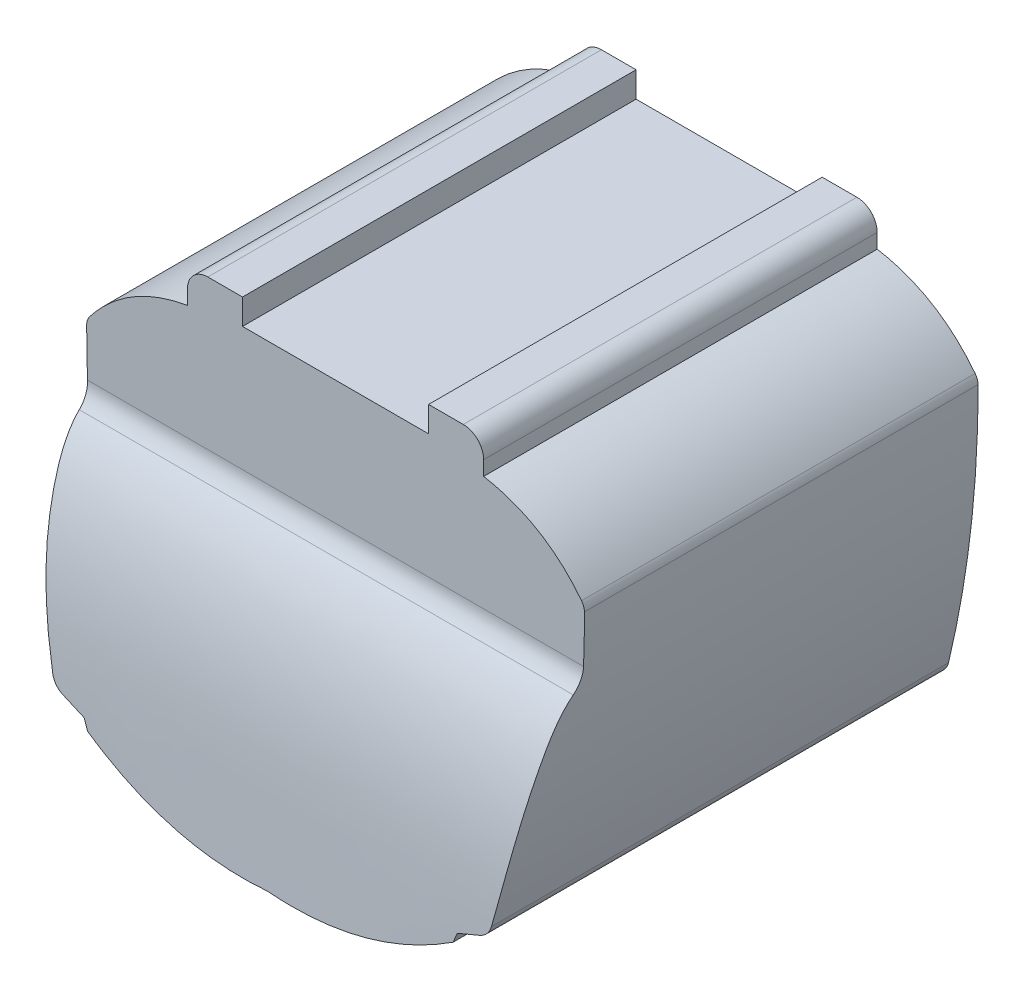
ISO-10303-21;
HEADER;
FILE_DESCRIPTION(('STEP AP214'),'2;1');
FILE_NAME('part.step','',(''),(''),'','','');
FILE_SCHEMA(('AUTOMOTIVE_DESIGN { 1 0 10303 214 1 1 1 1 }'));
ENDSEC;
DATA;
#1=APPLICATION_CONTEXT('core data for automotive mechanical design processes');
#2=APPLICATION_PROTOCOL_DEFINITION('international standard','automotive_design',2000,#1);
#3=PRODUCT_CONTEXT('',#1,'mechanical');
#4=PRODUCT('Part','Part','',(#3));
#5=PRODUCT_RELATED_PRODUCT_CATEGORY('part','',(#4));
#6=PRODUCT_DEFINITION_FORMATION('','',#4);
#7=PRODUCT_DEFINITION_CONTEXT('part definition',#1,'design');
#8=PRODUCT_DEFINITION('design','',#6,#7);
#9=PRODUCT_DEFINITION_SHAPE('','',#8);
#10=(LENGTH_UNIT() NAMED_UNIT(*) SI_UNIT(.MILLI.,.METRE.));
#11=(NAMED_UNIT(*) PLANE_ANGLE_UNIT() SI_UNIT($,.RADIAN.));
#12=(NAMED_UNIT(*) SI_UNIT($,.STERADIAN.) SOLID_ANGLE_UNIT());
#13=UNCERTAINTY_MEASURE_WITH_UNIT(LENGTH_MEASURE(1.E-05),#10,'distance_accuracy_value','');
#14=(GEOMETRIC_REPRESENTATION_CONTEXT(3) GLOBAL_UNCERTAINTY_ASSIGNED_CONTEXT((#13)) GLOBAL_UNIT_ASSIGNED_CONTEXT((#10,
#11,#12)) REPRESENTATION_CONTEXT('',''));
#15=CARTESIAN_POINT('',(0.,0.,0.));
#16=DIRECTION('',(0.,0.,1.));
#17=DIRECTION('',(1.,0.,0.));
#18=AXIS2_PLACEMENT_3D('',#15,#16,#17);
#19=CARTESIAN_POINT('',(20.9889993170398,-64.6683019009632,0.));
#20=DIRECTION('',(0.,0.,-1.));
#21=DIRECTION('',(-1.,0.,0.));
#22=AXIS2_PLACEMENT_3D('',#19,#20,#21);
#23=PLANE('',#22);
#24=DIRECTION('',(0.926571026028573,-0.376119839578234,0.));
#25=VECTOR('',#24,1.);
#26=CARTESIAN_POINT('',(-48.,-51.3480066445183,0.));
#27=LINE('',#26,#25);
#28=CARTESIAN_POINT('',(-46.0996826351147,-52.1193960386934,0.));
#29=VERTEX_POINT('',#28);
#30=CARTESIAN_POINT('',(-41.2376776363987,-54.09301326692,0.));
#31=VERTEX_POINT('',#30);
#32=EDGE_CURVE('E560',#29,#31,#27,.T.);
#33=ORIENTED_EDGE('',*,*,#32,.F.);
#34=CARTESIAN_POINT('',(-44.5952032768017,-48.4131119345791,0.));
#35=DIRECTION('',(0.,0.,-1.));
#36=DIRECTION('',(-1.,0.,0.));
#37=AXIS2_PLACEMENT_3D('',#34,#35,#36);
#38=CIRCLE('',#37,4.);
#39=CARTESIAN_POINT('',(-48.4867566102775,-49.3382133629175,0.));
#40=VERTEX_POINT('',#39);
#41=EDGE_CURVE('E625',#29,#40,#38,.T.);
#42=ORIENTED_EDGE('',*,*,#41,.T.);
#43=CARTESIAN_POINT('',(-55.,8.15199335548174,0.));
#44=CARTESIAN_POINT('',(-55.2373999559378,-22.0074346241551,0.));
#45=CARTESIAN_POINT('',(-48.,-51.3480066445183,0.));
#46=B_SPLINE_CURVE_WITH_KNOTS('',2,(#43,#44,#45),.UNSPECIFIED.,.F.,.F.,(3,3),(0.,1.),.UNSPECIFIED.);
#47=CARTESIAN_POINT('',(-55.0058244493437,7.15025357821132,0.));
#48=VERTEX_POINT('',#47);
#49=EDGE_CURVE('E552',#48,#40,#46,.T.);
#50=ORIENTED_EDGE('',*,*,#49,.F.);
#51=CARTESIAN_POINT('',(-52.005845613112,7.1389849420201,0.));
#52=DIRECTION('',(0.,0.,-1.));
#53=DIRECTION('',(-1.,0.,0.));
#54=AXIS2_PLACEMENT_3D('',#51,#52,#53);
#55=CIRCLE('',#54,3.);
#56=CARTESIAN_POINT('',(-54.3762681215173,8.97776092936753,0.));
#57=VERTEX_POINT('',#56);
#58=EDGE_CURVE('E612',#48,#57,#55,.T.);
#59=ORIENTED_EDGE('',*,*,#58,.T.);
#60=CARTESIAN_POINT('',(-32.7312245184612,21.9519933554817,0.));
#61=CARTESIAN_POINT('',(-46.6080075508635,19.5611825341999,0.));
#62=CARTESIAN_POINT('',(-55.,8.15199335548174,0.));
#63=B_SPLINE_CURVE_WITH_KNOTS('',2,(#60,#61,#62),.UNSPECIFIED.,.F.,.F.,(3,3),(0.,1.),.UNSPECIFIED.);
#64=CARTESIAN_POINT('',(-32.7312245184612,21.9519933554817,0.));
#65=VERTEX_POINT('',#64);
#66=EDGE_CURVE('E547',#65,#57,#63,.T.);
#67=ORIENTED_EDGE('',*,*,#66,.F.);
#68=DIRECTION('',(0.,-1.,0.));
#69=VECTOR('',#68,1.);
#70=CARTESIAN_POINT('',(-32.7312245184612,25.1519933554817,0.));
#71=LINE('',#70,#69);
#72=CARTESIAN_POINT('',(-32.7312245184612,25.1519933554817,0.));
#73=VERTEX_POINT('',#72);
#74=EDGE_CURVE('E544',#73,#65,#71,.T.);
#75=ORIENTED_EDGE('',*,*,#74,.F.);
#76=CARTESIAN_POINT('',(-28.2312245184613,25.1519933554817,0.));
#77=DIRECTION('',(0.,0.,1.));
#78=DIRECTION('',(1.,0.,0.));
#79=AXIS2_PLACEMENT_3D('',#76,#77,#78);
#80=CIRCLE('',#79,4.5);
#81=CARTESIAN_POINT('',(-28.2312245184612,29.6519933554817,0.));
#82=VERTEX_POINT('',#81);
#83=EDGE_CURVE('E541',#82,#73,#80,.T.);
#84=ORIENTED_EDGE('',*,*,#83,.F.);
#85=DIRECTION('',(-1.,0.,0.));
#86=VECTOR('',#85,1.);
#87=CARTESIAN_POINT('',(-20.5640657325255,29.6519933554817,0.));
#88=LINE('',#87,#86);
#89=CARTESIAN_POINT('',(-20.5640657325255,29.6519933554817,0.));
#90=VERTEX_POINT('',#89);
#91=EDGE_CURVE('E538',#90,#82,#88,.T.);
#92=ORIENTED_EDGE('',*,*,#91,.F.);
#93=DIRECTION('',(0.,1.,0.));
#94=VECTOR('',#93,1.);
#95=CARTESIAN_POINT('',(-20.5640657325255,24.0185564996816,0.));
#96=LINE('',#95,#94);
#97=CARTESIAN_POINT('',(-20.5640657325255,24.0185564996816,0.));
#98=VERTEX_POINT('',#97);
#99=EDGE_CURVE('E535',#98,#90,#96,.T.);
#100=ORIENTED_EDGE('',*,*,#99,.F.);
#101=DIRECTION('',(-1.,0.,0.));
#102=VECTOR('',#101,1.);
#103=CARTESIAN_POINT('',(20.5640657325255,24.0185564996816,0.));
#104=LINE('',#103,#102);
#105=CARTESIAN_POINT('',(20.5640657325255,24.0185564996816,0.));
#106=VERTEX_POINT('',#105);
#107=EDGE_CURVE('E532',#106,#98,#104,.T.);
#108=ORIENTED_EDGE('',*,*,#107,.F.);
#109=DIRECTION('',(0.,-1.,0.));
#110=VECTOR('',#109,1.);
#111=CARTESIAN_POINT('',(20.5640657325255,24.0185564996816,0.));
#112=LINE('',#111,#110);
#113=CARTESIAN_POINT('',(20.5640657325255,29.6519933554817,0.));
#114=VERTEX_POINT('',#113);
#115=EDGE_CURVE('E529',#114,#106,#112,.T.);
#116=ORIENTED_EDGE('',*,*,#115,.F.);
#117=DIRECTION('',(-1.,0.,0.));
#118=VECTOR('',#117,1.);
#119=CARTESIAN_POINT('',(20.5640657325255,29.6519933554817,0.));
#120=LINE('',#119,#118);
#121=CARTESIAN_POINT('',(28.2312245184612,29.6519933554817,0.));
#122=VERTEX_POINT('',#121);
#123=EDGE_CURVE('E526',#122,#114,#120,.T.);
#124=ORIENTED_EDGE('',*,*,#123,.F.);
#125=CARTESIAN_POINT('',(28.2312245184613,25.1519933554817,0.));
#126=DIRECTION('',(0.,0.,1.));
#127=DIRECTION('',(-1.,0.,0.));
#128=AXIS2_PLACEMENT_3D('',#125,#126,#127);
#129=CIRCLE('',#128,4.5);
#130=CARTESIAN_POINT('',(32.7312245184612,25.1519933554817,0.));
#131=VERTEX_POINT('',#130);
#132=EDGE_CURVE('E523',#131,#122,#129,.T.);
#133=ORIENTED_EDGE('',*,*,#132,.F.);
#134=DIRECTION('',(0.,1.,0.));
#135=VECTOR('',#134,1.);
#136=CARTESIAN_POINT('',(32.7312245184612,25.1519933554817,0.));
#137=LINE('',#136,#135);
#138=CARTESIAN_POINT('',(32.7312245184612,21.9519933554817,0.));
#139=VERTEX_POINT('',#138);
#140=EDGE_CURVE('E517',#139,#131,#137,.T.);
#141=ORIENTED_EDGE('',*,*,#140,.F.);
#142=CARTESIAN_POINT('',(55.,8.15199335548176,0.));
#143=CARTESIAN_POINT('',(46.6080075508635,19.5611825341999,0.));
#144=CARTESIAN_POINT('',(32.7312245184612,21.9519933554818,0.));
#145=B_SPLINE_CURVE_WITH_KNOTS('',2,(#142,#143,#144),.UNSPECIFIED.,.F.,.F.,(3,3),(0.,1.),.UNSPECIFIED.);
#146=CARTESIAN_POINT('',(54.3762681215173,8.97776092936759,0.));
#147=VERTEX_POINT('',#146);
#148=EDGE_CURVE('E509',#147,#139,#145,.T.);
#149=ORIENTED_EDGE('',*,*,#148,.F.);
#150=CARTESIAN_POINT('',(52.005845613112,7.13898494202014,0.));
#151=DIRECTION('',(0.,0.,-1.));
#152=DIRECTION('',(-1.,0.,0.));
#153=AXIS2_PLACEMENT_3D('',#150,#151,#152);
#154=CIRCLE('',#153,3.);
#155=CARTESIAN_POINT('',(55.0058244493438,7.15025357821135,0.));
#156=VERTEX_POINT('',#155);
#157=EDGE_CURVE('E609',#147,#156,#154,.T.);
#158=ORIENTED_EDGE('',*,*,#157,.T.);
#159=CARTESIAN_POINT('',(48.,-51.3480066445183,0.));
#160=CARTESIAN_POINT('',(55.2373999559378,-22.0074346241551,0.));
#161=CARTESIAN_POINT('',(55.,8.15199335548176,0.));
#162=B_SPLINE_CURVE_WITH_KNOTS('',2,(#159,#160,#161),.UNSPECIFIED.,.F.,.F.,(3,3),(0.,1.),.UNSPECIFIED.);
#163=CARTESIAN_POINT('',(48.4867566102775,-49.3382133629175,0.));
#164=VERTEX_POINT('',#163);
#165=EDGE_CURVE('E505',#164,#156,#162,.T.);
#166=ORIENTED_EDGE('',*,*,#165,.F.);
#167=CARTESIAN_POINT('',(44.5952032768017,-48.4131119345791,0.));
#168=DIRECTION('',(0.,0.,-1.));
#169=DIRECTION('',(-1.,0.,0.));
#170=AXIS2_PLACEMENT_3D('',#167,#168,#169);
#171=CIRCLE('',#170,4.);
#172=CARTESIAN_POINT('',(46.0996826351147,-52.1193960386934,0.));
#173=VERTEX_POINT('',#172);
#174=EDGE_CURVE('E623',#164,#173,#171,.T.);
#175=ORIENTED_EDGE('',*,*,#174,.T.);
#176=DIRECTION('',(0.926571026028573,0.376119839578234,0.));
#177=VECTOR('',#176,1.);
#178=CARTESIAN_POINT('',(48.,-51.3480066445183,0.));
#179=LINE('',#178,#177);
#180=CARTESIAN_POINT('',(41.2376776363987,-54.09301326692,0.));
#181=VERTEX_POINT('',#180);
#182=EDGE_CURVE('E502',#181,#173,#179,.T.);
#183=ORIENTED_EDGE('',*,*,#182,.F.);
#184=DIRECTION('',(0.376639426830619,0.926359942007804,0.));
#185=VECTOR('',#184,1.);
#186=CARTESIAN_POINT('',(41.2376776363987,-54.09301326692,0.));
#187=LINE('',#186,#185);
#188=CARTESIAN_POINT('',(40.388980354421,-56.1804186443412,0.));
#189=VERTEX_POINT('',#188);
#190=EDGE_CURVE('E484',#189,#181,#187,.T.);
#191=ORIENTED_EDGE('',*,*,#190,.F.);
#192=CARTESIAN_POINT('',(0.,-66.3480066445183,0.));
#193=CARTESIAN_POINT('',(21.7835084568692,-68.0723911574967,0.));
#194=CARTESIAN_POINT('',(40.388980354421,-56.1804186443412,0.));
#195=B_SPLINE_CURVE_WITH_KNOTS('',2,(#192,#193,#194),.UNSPECIFIED.,.F.,.F.,(3,3),(0.,1.),.UNSPECIFIED.);
#196=CARTESIAN_POINT('',(0.,-66.3480066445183,0.));
#197=VERTEX_POINT('',#196);
#198=EDGE_CURVE('E481',#197,#189,#195,.T.);
#199=ORIENTED_EDGE('',*,*,#198,.F.);
#200=CARTESIAN_POINT('',(-40.388980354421,-56.1804186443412,0.));
#201=CARTESIAN_POINT('',(-21.7835084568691,-68.0723911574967,0.));
#202=CARTESIAN_POINT('',(0.,-66.3480066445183,0.));
#203=B_SPLINE_CURVE_WITH_KNOTS('',2,(#200,#201,#202),.UNSPECIFIED.,.F.,.F.,(3,3),(0.,1.),.UNSPECIFIED.);
#204=CARTESIAN_POINT('',(-40.388980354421,-56.1804186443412,0.));
#205=VERTEX_POINT('',#204);
#206=EDGE_CURVE('E569',#205,#197,#203,.T.);
#207=ORIENTED_EDGE('',*,*,#206,.F.);
#208=DIRECTION('',(0.376639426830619,-0.926359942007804,0.));
#209=VECTOR('',#208,1.);
#210=CARTESIAN_POINT('',(-41.2376776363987,-54.09301326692,0.));
#211=LINE('',#210,#209);
#212=EDGE_CURVE('E566',#31,#205,#211,.T.);
#213=ORIENTED_EDGE('',*,*,#212,.F.);
#214=EDGE_LOOP('',(#33,#42,#50,#59,#67,#75,#84,#92,#100,#108,#116,#124,#133,#141,#149,#158,#166,
#175,#183,#191,#199,#207,#213));
#215=FACE_BOUND('',#214,.T.);
#216=CARTESIAN_POINT('',(-44.5952032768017,-48.4131119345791,0.));
#217=DIRECTION('',(0.,0.,-1.));
#218=DIRECTION('',(-1.,0.,0.));
#219=AXIS2_PLACEMENT_3D('',#216,#217,#218);
#220=CIRCLE('',#219,1.);
#221=CARTESIAN_POINT('',(-44.97132311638,-49.3396829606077,0.));
#222=VERTEX_POINT('',#221);
#223=CARTESIAN_POINT('',(-45.5680916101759,-48.6443872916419,0.));
#224=VERTEX_POINT('',#223);
#225=EDGE_CURVE('E1261',#222,#224,#220,.T.);
#226=ORIENTED_EDGE('',*,*,#225,.F.);
#227=DIRECTION('',(0.926571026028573,-0.376119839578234,0.));
#228=VECTOR('',#227,1.);
#229=CARTESIAN_POINT('',(16.999897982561,-74.4954509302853,0.));
#230=LINE('',#229,#228);
#231=CARTESIAN_POINT('',(-38.935670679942,-51.7897149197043,0.));
#232=VERTEX_POINT('',#231);
#233=EDGE_CURVE('E1315',#222,#232,#230,.T.);
#234=ORIENTED_EDGE('',*,*,#233,.T.);
#235=DIRECTION('',(0.376639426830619,-0.926359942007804,0.));
#236=VECTOR('',#235,1.);
#237=CARTESIAN_POINT('',(-25.9415349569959,-83.749318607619,0.));
#238=LINE('',#237,#236);
#239=CARTESIAN_POINT('',(-37.9734230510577,-54.1564019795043,0.));
#240=VERTEX_POINT('',#239);
#241=EDGE_CURVE('E367',#232,#240,#238,.T.);
#242=ORIENTED_EDGE('',*,*,#241,.T.);
#243=CARTESIAN_POINT('',(-37.9734230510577,-54.1564019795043,0.));
#244=CARTESIAN_POINT('',(-37.4241551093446,-54.4971893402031,0.));
#245=CARTESIAN_POINT('',(-36.8701423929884,-54.8303586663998,0.));
#246=CARTESIAN_POINT('',(-35.7527159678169,-55.4808379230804,0.));
#247=CARTESIAN_POINT('',(-35.1893001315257,-55.7981441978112,0.));
#248=CARTESIAN_POINT('',(-34.0533683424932,-56.4161387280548,0.));
#249=CARTESIAN_POINT('',(-33.4808517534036,-56.7168258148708,0.));
#250=CARTESIAN_POINT('',(-32.3273383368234,-57.3007359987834,0.));
#251=CARTESIAN_POINT('',(-31.7463459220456,-57.5839678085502,0.));
#252=CARTESIAN_POINT('',(-30.5759889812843,-58.1324678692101,0.));
#253=CARTESIAN_POINT('',(-29.9866250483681,-58.3977373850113,0.));
#254=CARTESIAN_POINT('',(-28.7999198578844,-58.9097200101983,0.));
#255=CARTESIAN_POINT('',(-28.202579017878,-59.156434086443,0.));
#256=CARTESIAN_POINT('',(-27.0899392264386,-59.595426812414,0.));
#257=CARTESIAN_POINT('',(-26.5756776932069,-59.7903390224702,0.));
#258=CARTESIAN_POINT('',(-25.5420214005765,-60.1660319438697,0.));
#259=CARTESIAN_POINT('',(-25.022626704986,-60.3468128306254,0.));
#260=CARTESIAN_POINT('',(-23.9790598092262,-60.6939726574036,0.));
#261=CARTESIAN_POINT('',(-23.4548877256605,-60.860351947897,0.));
#262=CARTESIAN_POINT('',(-22.4020952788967,-61.1784958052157,0.));
#263=CARTESIAN_POINT('',(-21.873474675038,-61.3302595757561,0.));
#264=CARTESIAN_POINT('',(-20.8121877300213,-61.6189835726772,0.));
#265=CARTESIAN_POINT('',(-20.2795212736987,-61.755943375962,0.));
#266=CARTESIAN_POINT('',(-19.2105279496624,-62.0149285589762,0.));
#267=CARTESIAN_POINT('',(-18.6742007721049,-62.1369526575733,0.));
#268=CARTESIAN_POINT('',(-17.3948017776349,-62.409289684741,0.));
#269=CARTESIAN_POINT('',(-16.6502796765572,-62.5528390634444,0.));
#270=CARTESIAN_POINT('',(-15.156093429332,-62.8113180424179,0.));
#271=CARTESIAN_POINT('',(-14.4064279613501,-62.9262399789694,0.));
#272=CARTESIAN_POINT('',(-12.903074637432,-63.1275441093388,0.));
#273=CARTESIAN_POINT('',(-12.1493857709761,-63.2139187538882,0.));
#274=CARTESIAN_POINT('',(-10.6391440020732,-63.3583694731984,0.));
#275=CARTESIAN_POINT('',(-9.88259052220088,-63.4164394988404,0.));
#276=CARTESIAN_POINT('',(-8.3650344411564,-63.5048456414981,0.));
#277=CARTESIAN_POINT('',(-7.60402578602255,-63.5350771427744,0.));
#278=CARTESIAN_POINT('',(-6.08149357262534,-63.5680026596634,0.));
#279=CARTESIAN_POINT('',(-5.31997008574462,-63.5706999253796,0.));
#280=CARTESIAN_POINT('',(-4.17815264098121,-63.5546273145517,0.));
#281=CARTESIAN_POINT('',(-3.79768928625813,-63.5459198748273,0.));
#282=CARTESIAN_POINT('',(-3.03696591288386,-63.5219007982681,0.));
#283=CARTESIAN_POINT('',(-2.6567058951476,-63.5065891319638,0.));
#284=CARTESIAN_POINT('',(-1.89678483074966,-63.4694782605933,0.));
#285=CARTESIAN_POINT('',(-1.51712354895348,-63.4476838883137,0.));
#286=CARTESIAN_POINT('',(-1.04281740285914,-63.4164486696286,0.));
#287=CARTESIAN_POINT('',(-0.947969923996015,-63.4100020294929,0.));
#288=CARTESIAN_POINT('',(-0.758302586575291,-63.3967133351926,0.));
#289=CARTESIAN_POINT('',(-0.663482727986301,-63.3898712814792,0.));
#290=CARTESIAN_POINT('',(-0.473873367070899,-63.375784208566,0.));
#291=CARTESIAN_POINT('',(-0.379083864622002,-63.3685391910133,0.));
#292=CARTESIAN_POINT('',(-0.236921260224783,-63.3573970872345,0.));
#293=CARTESIAN_POINT('',(-0.189537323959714,-63.3536372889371,0.));
#294=CARTESIAN_POINT('',(-0.0947699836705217,-63.3461121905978,0.));
#295=CARTESIAN_POINT('',(-0.0473865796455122,-63.3423468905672,0.));
#296=CARTESIAN_POINT('',(0.,-63.3386218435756,0.));
#297=B_SPLINE_CURVE_WITH_KNOTS('',3,(#243,#244,#245,#246,#247,#248,#249,#250,#251,#252,#253,
#254,#255,#256,#257,#258,#259,#260,#261,#262,#263,#264,#265,#266,#267,#268,#269,#270,#271,#272,
#273,#274,#275,#276,#277,#278,#279,#280,#281,#282,#283,#284,#285,#286,#287,#288,#289,#290,#291,
#292,#293,#294,#295,#296),.UNSPECIFIED.,.F.,.F.,(4,2,2,2,2,2,2,2,2,2,2,2,2,2,2,2,2,2,2,2,2,2,2,
2,2,2,4),(0.,1.93915687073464,3.87875859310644,5.81849653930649,7.75725830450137,
9.6958833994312,11.6344074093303,13.2840894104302,14.9337509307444,16.5833722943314,
18.2330834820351,19.882841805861,21.532741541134,23.8068559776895,26.0815785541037,
28.3569021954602,30.6327118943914,32.9170394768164,35.2010974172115,36.3427391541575,
37.4843859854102,38.6251838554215,38.9103824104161,39.1955806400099,39.480777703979,
39.6233762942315,39.765974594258),.UNSPECIFIED.);
#298=CARTESIAN_POINT('',(0.,-63.3386218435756,0.));
#299=VERTEX_POINT('',#298);
#300=EDGE_CURVE('E53',#240,#299,#297,.T.);
#301=ORIENTED_EDGE('',*,*,#300,.T.);
#302=CARTESIAN_POINT('',(0.,-63.3386218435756,0.));
#303=CARTESIAN_POINT('',(0.0402717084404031,-63.3417936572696,0.));
#304=CARTESIAN_POINT('',(0.0805415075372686,-63.3449894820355,0.));
#305=CARTESIAN_POINT('',(0.161081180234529,-63.351381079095,0.));
#306=CARTESIAN_POINT('',(0.201351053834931,-63.3545768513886,0.));
#307=CARTESIAN_POINT('',(0.322166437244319,-63.3640919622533,0.));
#308=CARTESIAN_POINT('',(0.402717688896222,-63.370339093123,0.));
#309=CARTESIAN_POINT('',(0.563843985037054,-63.382523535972,0.));
#310=CARTESIAN_POINT('',(0.644419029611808,-63.3884608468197,0.));
#311=CARTESIAN_POINT('',(0.805589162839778,-63.4000553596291,0.));
#312=CARTESIAN_POINT('',(0.886184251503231,-63.4057125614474,0.));
#313=CARTESIAN_POINT('',(1.28921075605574,-63.4332782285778,0.));
#314=CARTESIAN_POINT('',(1.61179332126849,-63.4530255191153,0.));
#315=CARTESIAN_POINT('',(2.25728277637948,-63.4878607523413,0.));
#316=CARTESIAN_POINT('',(2.58018972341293,-63.5029476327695,0.));
#317=CARTESIAN_POINT('',(3.22618688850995,-63.5283884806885,0.));
#318=CARTESIAN_POINT('',(3.54927710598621,-63.5387424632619,0.));
#319=CARTESIAN_POINT('',(4.51876898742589,-63.562614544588,0.));
#320=CARTESIAN_POINT('',(5.16536424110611,-63.5689412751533,0.));
#321=CARTESIAN_POINT('',(6.45800646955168,-63.5619652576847,0.));
#322=CARTESIAN_POINT('',(7.10405351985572,-63.5486757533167,0.));
#323=CARTESIAN_POINT('',(8.39538667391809,-63.5021023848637,0.));
#324=CARTESIAN_POINT('',(9.04067282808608,-63.4688199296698,0.));
#325=CARTESIAN_POINT('',(10.3298481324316,-63.3819393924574,0.));
#326=CARTESIAN_POINT('',(10.9737373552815,-63.3283423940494,0.));
#327=CARTESIAN_POINT('',(12.1626455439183,-63.2102087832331,0.));
#328=CARTESIAN_POINT('',(12.7079506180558,-63.1485353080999,0.));
#329=CARTESIAN_POINT('',(13.7966604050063,-63.0102517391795,0.));
#330=CARTESIAN_POINT('',(14.3400651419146,-62.9336418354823,0.));
#331=CARTESIAN_POINT('',(15.4245361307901,-62.7654287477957,0.));
#332=CARTESIAN_POINT('',(15.9656024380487,-62.6738259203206,0.));
#333=CARTESIAN_POINT('',(17.0450553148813,-62.4756016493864,0.));
#334=CARTESIAN_POINT('',(17.5834415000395,-62.3689781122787,0.));
#335=CARTESIAN_POINT('',(18.6570479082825,-62.1407563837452,0.));
#336=CARTESIAN_POINT('',(19.1922680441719,-62.0191577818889,0.));
#337=CARTESIAN_POINT('',(20.2591451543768,-61.7610675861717,0.));
#338=CARTESIAN_POINT('',(20.7908018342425,-61.624574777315,0.));
#339=CARTESIAN_POINT('',(22.0530547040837,-61.2817072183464,0.));
#340=CARTESIAN_POINT('',(22.7818312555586,-61.0685938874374,0.));
#341=CARTESIAN_POINT('',(24.2308754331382,-60.6145807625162,0.));
#342=CARTESIAN_POINT('',(24.9511407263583,-60.3736735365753,0.));
#343=CARTESIAN_POINT('',(26.3822317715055,-59.8647047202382,0.));
#344=CARTESIAN_POINT('',(27.0930548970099,-59.5966357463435,0.));
#345=CARTESIAN_POINT('',(28.5043668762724,-59.0341331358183,0.));
#346=CARTESIAN_POINT('',(29.2048534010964,-58.7396936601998,0.));
#347=CARTESIAN_POINT('',(30.5969876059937,-58.124354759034,0.));
#348=CARTESIAN_POINT('',(31.2885964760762,-57.8033675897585,0.));
#349=CARTESIAN_POINT('',(32.6597827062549,-57.1368768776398,0.));
#350=CARTESIAN_POINT('',(33.3393615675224,-56.7913764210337,0.));
#351=CARTESIAN_POINT('',(34.6857858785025,-56.0770518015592,0.));
#352=CARTESIAN_POINT('',(35.352636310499,-55.7082370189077,0.));
#353=CARTESIAN_POINT('',(36.6729899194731,-54.9485940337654,0.));
#354=CARTESIAN_POINT('',(37.3265031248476,-54.5577832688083,0.));
#355=CARTESIAN_POINT('',(37.9734230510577,-54.1564019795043,0.));
#356=B_SPLINE_CURVE_WITH_KNOTS('',3,(#302,#303,#304,#305,#306,#307,#308,#309,#310,#311,#312,
#313,#314,#315,#316,#317,#318,#319,#320,#321,#322,#323,#324,#325,#326,#327,#328,#329,#330,#331,
#332,#333,#334,#335,#336,#337,#338,#339,#340,#341,#342,#343,#344,#345,#346,#347,#348,#349,#350,
#351,#352,#353,#354,#355),.UNSPECIFIED.,.F.,.F.,(4,2,2,2,2,2,2,2,2,2,2,2,2,2,2,2,2,2,2,2,2,2,2,
2,2,2,4),(0.,0.121189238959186,0.242378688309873,0.484757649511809,0.727137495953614,
0.96951746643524,1.93903938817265,2.90878213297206,3.87852178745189,5.81808410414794,
7.75633754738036,9.69445441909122,11.6324679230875,13.2786142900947,14.9247397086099,
16.570825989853,18.2171419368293,19.8635030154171,21.5099984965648,23.7873015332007,
26.0652149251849,28.3437492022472,30.6227892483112,32.9096883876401,35.1963001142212,
37.4819976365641,39.7659079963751),.UNSPECIFIED.);
#357=CARTESIAN_POINT('',(37.9734230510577,-54.1564019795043,0.));
#358=VERTEX_POINT('',#357);
#359=EDGE_CURVE('E363',#299,#358,#356,.T.);
#360=ORIENTED_EDGE('',*,*,#359,.T.);
#361=DIRECTION('',(0.376639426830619,0.926359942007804,0.));
#362=VECTOR('',#361,1.);
#363=CARTESIAN_POINT('',(31.8964187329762,-69.1030405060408,0.));
#364=LINE('',#363,#362);
#365=CARTESIAN_POINT('',(38.935670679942,-51.7897149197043,0.));
#366=VERTEX_POINT('',#365);
#367=EDGE_CURVE('E1224',#358,#366,#364,.T.);
#368=ORIENTED_EDGE('',*,*,#367,.T.);
#369=DIRECTION('',(0.926571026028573,0.376119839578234,0.));
#370=VECTOR('',#369,1.);
#371=CARTESIAN_POINT('',(19.0396354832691,-59.8660451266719,0.));
#372=LINE('',#371,#370);
#373=CARTESIAN_POINT('',(44.97132311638,-49.3396829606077,0.));
#374=VERTEX_POINT('',#373);
#375=EDGE_CURVE('E1274',#366,#374,#372,.T.);
#376=ORIENTED_EDGE('',*,*,#375,.T.);
#377=CARTESIAN_POINT('',(44.5952032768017,-48.4131119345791,0.));
#378=DIRECTION('',(0.,0.,-1.));
#379=DIRECTION('',(-1.,0.,0.));
#380=AXIS2_PLACEMENT_3D('',#377,#378,#379);
#381=CIRCLE('',#380,1.);
#382=CARTESIAN_POINT('',(45.5680916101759,-48.6443872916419,0.));
#383=VERTEX_POINT('',#382);
#384=EDGE_CURVE('E1258',#383,#374,#381,.T.);
#385=ORIENTED_EDGE('',*,*,#384,.F.);
#386=CARTESIAN_POINT('',(45.5680916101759,-48.6443872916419,0.));
#387=CARTESIAN_POINT('',(45.8631785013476,-47.4030756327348,0.));
#388=CARTESIAN_POINT('',(46.1484092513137,-46.1594427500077,0.));
#389=CARTESIAN_POINT('',(46.6989947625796,-43.6677832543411,0.));
#390=CARTESIAN_POINT('',(46.9643494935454,-42.4197566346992,0.));
#391=CARTESIAN_POINT('',(47.7303146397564,-38.6696517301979,0.));
#392=CARTESIAN_POINT('',(48.2008701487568,-36.1613628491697,0.));
#393=CARTESIAN_POINT('',(49.060691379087,-31.1308947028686,0.));
#394=CARTESIAN_POINT('',(49.4499557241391,-28.6087152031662,0.));
#395=CARTESIAN_POINT('',(50.1464518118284,-23.5529115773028,0.));
#396=CARTESIAN_POINT('',(50.4536800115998,-21.0192869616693,0.));
#397=CARTESIAN_POINT('',(50.9425634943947,-16.3546312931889,0.));
#398=CARTESIAN_POINT('',(51.1364989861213,-14.2248772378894,0.));
#399=CARTESIAN_POINT('',(51.4664158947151,-9.96078368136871,0.));
#400=CARTESIAN_POINT('',(51.6023948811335,-7.82644399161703,0.));
#401=CARTESIAN_POINT('',(51.8165262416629,-3.55418623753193,0.));
#402=CARTESIAN_POINT('',(51.8946600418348,-1.41626724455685,0.));
#403=CARTESIAN_POINT('',(51.9933504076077,2.86080192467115,0.));
#404=CARTESIAN_POINT('',(52.0139096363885,4.99995203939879,0.));
#405=CARTESIAN_POINT('',(52.005845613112,7.13898494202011,0.));
#406=B_SPLINE_CURVE_WITH_KNOTS('',3,(#386,#387,#388,#389,#390,#391,#392,#393,#394,#395,#396,
#397,#398,#399,#400,#401,#402,#403,#404,#405),.UNSPECIFIED.,.F.,.F.,(4,2,2,2,2,2,2,2,2,4),(0.,
3.8276283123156,7.65526246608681,15.3099588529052,22.9647848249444,30.6199413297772,
37.0348762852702,43.4500802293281,49.8673431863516,56.2843093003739),.UNSPECIFIED.);
#407=CARTESIAN_POINT('',(52.005845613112,7.13898494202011,0.));
#408=VERTEX_POINT('',#407);
#409=EDGE_CURVE('E1269',#383,#408,#406,.T.);
#410=ORIENTED_EDGE('',*,*,#409,.T.);
#411=CARTESIAN_POINT('',(52.005845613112,7.13898494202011,0.));
#412=CARTESIAN_POINT('',(51.8158262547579,7.38394791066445,0.));
#413=CARTESIAN_POINT('',(51.6227097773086,7.62651698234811,0.));
#414=CARTESIAN_POINT('',(51.2301745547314,8.10662468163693,0.));
#415=CARTESIAN_POINT('',(51.0307538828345,8.34416173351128,0.));
#416=CARTESIAN_POINT('',(50.6255929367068,8.81384190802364,0.));
#417=CARTESIAN_POINT('',(50.4198518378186,9.04598431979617,0.));
#418=CARTESIAN_POINT('',(50.0020523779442,9.50452177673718,0.));
#419=CARTESIAN_POINT('',(49.7899939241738,9.73091673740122,0.));
#420=CARTESIAN_POINT('',(49.3598917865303,10.1772921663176,0.));
#421=CARTESIAN_POINT('',(49.1418576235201,10.3972818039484,0.));
#422=CARTESIAN_POINT('',(48.6995431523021,10.8308656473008,0.));
#423=CARTESIAN_POINT('',(48.4752632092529,11.0444602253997,0.));
#424=CARTESIAN_POINT('',(48.0205061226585,11.4649483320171,0.));
#425=CARTESIAN_POINT('',(47.7900290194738,11.6718419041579,0.));
#426=CARTESIAN_POINT('',(47.3229493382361,12.07863744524,0.));
#427=CARTESIAN_POINT('',(47.0863461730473,12.2785387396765,0.));
#428=CARTESIAN_POINT('',(46.5233210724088,12.7397002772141,0.));
#429=CARTESIAN_POINT('',(46.1944338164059,12.9979613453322,0.));
#430=CARTESIAN_POINT('',(45.526069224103,13.5005529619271,0.));
#431=CARTESIAN_POINT('',(45.1865894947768,13.7448803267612,0.));
#432=CARTESIAN_POINT('',(44.4975470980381,14.2189930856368,0.));
#433=CARTESIAN_POINT('',(44.1479830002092,14.4487764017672,0.));
#434=CARTESIAN_POINT('',(43.4393661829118,14.8932965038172,0.));
#435=CARTESIAN_POINT('',(43.08031250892,15.1080317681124,0.));
#436=CARTESIAN_POINT('',(42.352780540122,15.5224161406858,0.));
#437=CARTESIAN_POINT('',(41.9842870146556,15.7220385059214,0.));
#438=CARTESIAN_POINT('',(41.2392094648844,16.1055288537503,0.));
#439=CARTESIAN_POINT('',(40.8626257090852,16.2893973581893,0.));
#440=CARTESIAN_POINT('',(40.1021914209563,16.6412329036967,0.));
#441=CARTESIAN_POINT('',(39.718342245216,16.8092028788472,0.));
#442=CARTESIAN_POINT('',(38.9442525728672,17.1292179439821,0.));
#443=CARTESIAN_POINT('',(38.5540148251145,17.2812696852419,0.));
#444=CARTESIAN_POINT('',(37.8208626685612,17.5501810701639,0.));
#445=CARTESIAN_POINT('',(37.4786720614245,17.669020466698,0.));
#446=CARTESIAN_POINT('',(36.7904925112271,17.8950774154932,0.));
#447=CARTESIAN_POINT('',(36.4445037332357,18.0022954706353,0.));
#448=CARTESIAN_POINT('',(35.7490943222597,18.2053405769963,0.));
#449=CARTESIAN_POINT('',(35.3996727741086,18.3011644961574,0.));
#450=CARTESIAN_POINT('',(34.8733132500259,18.4365316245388,0.));
#451=CARTESIAN_POINT('',(34.6974427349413,18.4802695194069,0.));
#452=CARTESIAN_POINT('',(34.345032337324,18.564982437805,0.));
#453=CARTESIAN_POINT('',(34.168492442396,18.605957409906,0.));
#454=CARTESIAN_POINT('',(33.8153758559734,18.6850501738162,0.));
#455=CARTESIAN_POINT('',(33.6388011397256,18.723176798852,0.));
#456=CARTESIAN_POINT('',(33.2851025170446,18.7967557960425,0.));
#457=CARTESIAN_POINT('',(33.1079786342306,18.8322082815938,0.));
#458=CARTESIAN_POINT('',(32.8419153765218,18.8834096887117,0.));
#459=CARTESIAN_POINT('',(32.7531650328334,18.9001472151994,0.));
#460=CARTESIAN_POINT('',(32.5755443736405,18.9329710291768,0.));
#461=CARTESIAN_POINT('',(32.4866740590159,18.9490573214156,0.));
#462=CARTESIAN_POINT('',(32.3532797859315,18.9726941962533,0.));
#463=CARTESIAN_POINT('',(32.3087993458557,18.9804912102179,0.));
#464=CARTESIAN_POINT('',(32.2198125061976,18.9959357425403,0.));
#465=CARTESIAN_POINT('',(32.1753061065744,19.0035832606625,0.));
#466=CARTESIAN_POINT('',(32.0417914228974,19.0265534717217,0.));
#467=CARTESIAN_POINT('',(31.9527879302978,19.0419037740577,0.));
#468=CARTESIAN_POINT('',(31.7748446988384,19.072573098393,0.));
#469=CARTESIAN_POINT('',(31.6859049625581,19.0878921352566,0.));
#470=CARTESIAN_POINT('',(31.50802654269,19.1185353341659,0.));
#471=CARTESIAN_POINT('',(31.4190878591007,19.1338594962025,0.));
#472=CARTESIAN_POINT('',(31.1522756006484,19.1798298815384,0.));
#473=CARTESIAN_POINT('',(30.9744017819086,19.2104746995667,0.));
#474=CARTESIAN_POINT('',(30.6189794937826,19.2717092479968,0.));
#475=CARTESIAN_POINT('',(30.4414310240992,19.3022989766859,0.));
#476=CARTESIAN_POINT('',(30.0863299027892,19.3634791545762,0.));
#477=CARTESIAN_POINT('',(29.9087772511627,19.3940696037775,0.));
#478=CARTESIAN_POINT('',(29.7312245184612,19.4246595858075,0.));
#479=B_SPLINE_CURVE_WITH_KNOTS('',3,(#411,#412,#413,#414,#415,#416,#417,#418,#419,#420,#421,
#422,#423,#424,#425,#426,#427,#428,#429,#430,#431,#432,#433,#434,#435,#436,#437,#438,#439,#440,
#441,#442,#443,#444,#445,#446,#447,#448,#449,#450,#451,#452,#453,#454,#455,#456,#457,#458,#459,
#460,#461,#462,#463,#464,#465,#466,#467,#468,#469,#470,#471,#472,#473,#474,#475,#476,#477,#478),
.UNSPECIFIED.,.F.,.F.,(4,2,2,2,2,2,2,2,2,2,2,2,2,2,2,2,2,2,2,2,2,2,2,2,2,2,2,2,2,2,2,2,2,4),(0.,
0.930054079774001,1.86039521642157,2.79085825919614,3.72133497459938,4.65040671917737,
5.57942425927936,6.50843575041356,7.43753661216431,8.69166778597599,9.94608437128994,
11.2006797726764,12.4554018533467,13.7122947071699,14.9691459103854,16.2257647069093,
17.4818563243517,18.5683675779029,19.6548317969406,20.7415939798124,21.2852586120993,
21.8289333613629,22.3708453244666,22.9127342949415,23.1836768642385,23.4546174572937,
23.5900931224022,23.7255690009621,23.9965215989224,24.2672697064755,24.5380173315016,
25.0795002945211,25.619993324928,26.1604990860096),.UNSPECIFIED.);
#480=CARTESIAN_POINT('',(29.7312245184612,19.4246595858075,0.));
#481=VERTEX_POINT('',#480);
#482=EDGE_CURVE('E1350',#408,#481,#479,.T.);
#483=ORIENTED_EDGE('',*,*,#482,.T.);
#484=DIRECTION('',(0.,1.,0.));
#485=VECTOR('',#484,1.);
#486=CARTESIAN_POINT('',(29.7312245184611,-64.6683019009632,0.));
#487=LINE('',#486,#485);
#488=CARTESIAN_POINT('',(29.7312245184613,25.1519933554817,0.));
#489=VERTEX_POINT('',#488);
#490=EDGE_CURVE('E1348',#481,#489,#487,.T.);
#491=ORIENTED_EDGE('',*,*,#490,.T.);
#492=CARTESIAN_POINT('',(28.2312245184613,25.1519933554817,0.));
#493=DIRECTION('',(0.,0.,-1.));
#494=DIRECTION('',(-1.,0.,0.));
#495=AXIS2_PLACEMENT_3D('',#492,#493,#494);
#496=CIRCLE('',#495,1.5);
#497=CARTESIAN_POINT('',(28.2312245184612,26.6519933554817,0.));
#498=VERTEX_POINT('',#497);
#499=EDGE_CURVE('E1345',#489,#498,#496,.F.);
#500=ORIENTED_EDGE('',*,*,#499,.T.);
#501=DIRECTION('',(-1.,0.,0.));
#502=VECTOR('',#501,1.);
#503=CARTESIAN_POINT('',(20.9889993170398,26.6519933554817,0.));
#504=LINE('',#503,#502);
#505=CARTESIAN_POINT('',(23.5640657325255,26.6519933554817,0.));
#506=VERTEX_POINT('',#505);
#507=EDGE_CURVE('E1342',#498,#506,#504,.T.);
#508=ORIENTED_EDGE('',*,*,#507,.T.);
#509=DIRECTION('',(0.,-1.,0.));
#510=VECTOR('',#509,1.);
#511=CARTESIAN_POINT('',(23.5640657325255,-64.6683019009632,0.));
#512=LINE('',#511,#510);
#513=CARTESIAN_POINT('',(23.5640657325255,21.0185564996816,0.));
#514=VERTEX_POINT('',#513);
#515=EDGE_CURVE('E1339',#506,#514,#512,.T.);
#516=ORIENTED_EDGE('',*,*,#515,.T.);
#517=DIRECTION('',(-1.,0.,0.));
#518=VECTOR('',#517,1.);
#519=CARTESIAN_POINT('',(20.9889993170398,21.0185564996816,0.));
#520=LINE('',#519,#518);
#521=CARTESIAN_POINT('',(-23.5640657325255,21.0185564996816,0.));
#522=VERTEX_POINT('',#521);
#523=EDGE_CURVE('E1336',#514,#522,#520,.T.);
#524=ORIENTED_EDGE('',*,*,#523,.T.);
#525=DIRECTION('',(0.,1.,0.));
#526=VECTOR('',#525,1.);
#527=CARTESIAN_POINT('',(-23.5640657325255,-64.6683019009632,0.));
#528=LINE('',#527,#526);
#529=CARTESIAN_POINT('',(-23.5640657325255,26.6519933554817,0.));
#530=VERTEX_POINT('',#529);
#531=EDGE_CURVE('E1333',#522,#530,#528,.T.);
#532=ORIENTED_EDGE('',*,*,#531,.T.);
#533=DIRECTION('',(-1.,0.,0.));
#534=VECTOR('',#533,1.);
#535=CARTESIAN_POINT('',(20.9889993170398,26.6519933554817,0.));
#536=LINE('',#535,#534);
#537=CARTESIAN_POINT('',(-28.2312245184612,26.6519933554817,0.));
#538=VERTEX_POINT('',#537);
#539=EDGE_CURVE('E1330',#530,#538,#536,.T.);
#540=ORIENTED_EDGE('',*,*,#539,.T.);
#541=CARTESIAN_POINT('',(-28.2312245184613,25.1519933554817,0.));
#542=DIRECTION('',(0.,0.,-1.));
#543=DIRECTION('',(-1.,0.,0.));
#544=AXIS2_PLACEMENT_3D('',#541,#542,#543);
#545=CIRCLE('',#544,1.5);
#546=CARTESIAN_POINT('',(-29.7312245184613,25.1519933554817,0.));
#547=VERTEX_POINT('',#546);
#548=EDGE_CURVE('E1327',#538,#547,#545,.F.);
#549=ORIENTED_EDGE('',*,*,#548,.T.);
#550=DIRECTION('',(0.,-1.,0.));
#551=VECTOR('',#550,1.);
#552=CARTESIAN_POINT('',(-29.7312245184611,-64.6683019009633,0.));
#553=LINE('',#552,#551);
#554=CARTESIAN_POINT('',(-29.7312245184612,19.4246595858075,0.));
#555=VERTEX_POINT('',#554);
#556=EDGE_CURVE('E1317',#547,#555,#553,.T.);
#557=ORIENTED_EDGE('',*,*,#556,.T.);
#558=CARTESIAN_POINT('',(-29.7312245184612,19.4246595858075,0.));
#559=CARTESIAN_POINT('',(-29.8898825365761,19.3973247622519,0.));
#560=CARTESIAN_POINT('',(-30.0485405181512,19.3699897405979,0.));
#561=CARTESIAN_POINT('',(-30.3658549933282,19.3153199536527,0.));
#562=CARTESIAN_POINT('',(-30.5245114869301,19.2879851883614,0.));
#563=CARTESIAN_POINT('',(-30.8420459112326,19.2332779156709,0.));
#564=CARTESIAN_POINT('',(-31.0009238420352,19.2059054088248,0.));
#565=CARTESIAN_POINT('',(-31.3186809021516,19.1511585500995,0.));
#566=CARTESIAN_POINT('',(-31.4775600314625,19.1237841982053,0.));
#567=CARTESIAN_POINT('',(-31.7159281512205,19.0827187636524,0.));
#568=CARTESIAN_POINT('',(-31.7954167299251,19.0690254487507,0.));
#569=CARTESIAN_POINT('',(-31.9543925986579,19.0416306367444,0.));
#570=CARTESIAN_POINT('',(-32.0338798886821,19.0279291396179,0.));
#571=CARTESIAN_POINT('',(-32.1928590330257,19.000557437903,0.));
#572=CARTESIAN_POINT('',(-32.2723508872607,18.9868872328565,0.));
#573=CARTESIAN_POINT('',(-32.4312334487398,18.9589715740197,0.));
#574=CARTESIAN_POINT('',(-32.5106241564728,18.9447261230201,0.));
#575=CARTESIAN_POINT('',(-32.7486557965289,18.9012259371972,0.));
#576=CARTESIAN_POINT('',(-32.9071577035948,18.8712071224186,0.));
#577=CARTESIAN_POINT('',(-33.2237488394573,18.8090484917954,0.));
#578=CARTESIAN_POINT('',(-33.3818380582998,18.7769086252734,0.));
#579=CARTESIAN_POINT('',(-33.698183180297,18.7103659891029,0.));
#580=CARTESIAN_POINT('',(-33.8564373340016,18.6759548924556,0.));
#581=CARTESIAN_POINT('',(-34.1724528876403,18.6049525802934,0.));
#582=CARTESIAN_POINT('',(-34.330214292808,18.5683613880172,0.));
#583=CARTESIAN_POINT('',(-34.802573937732,18.4553109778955,0.));
#584=CARTESIAN_POINT('',(-35.1163884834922,18.3755453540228,0.));
#585=CARTESIAN_POINT('',(-35.7415267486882,18.2070254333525,0.));
#586=CARTESIAN_POINT('',(-36.0528509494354,18.1182729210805,0.));
#587=CARTESIAN_POINT('',(-36.6727694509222,17.9315947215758,0.));
#588=CARTESIAN_POINT('',(-36.9813634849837,17.8336681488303,0.));
#589=CARTESIAN_POINT('',(-37.6917535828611,17.5963384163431,0.));
#590=CARTESIAN_POINT('',(-38.0924279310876,17.453559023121,0.));
#591=CARTESIAN_POINT('',(-38.8877906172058,17.1516659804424,0.));
#592=CARTESIAN_POINT('',(-39.2824760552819,16.9925446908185,0.));
#593=CARTESIAN_POINT('',(-40.0649299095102,16.6578937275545,0.));
#594=CARTESIAN_POINT('',(-40.4526969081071,16.4823607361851,0.));
#595=CARTESIAN_POINT('',(-41.220427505,16.1149415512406,0.));
#596=CARTESIAN_POINT('',(-41.6003907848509,15.9230546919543,0.));
#597=CARTESIAN_POINT('',(-42.3510609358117,15.5234491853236,0.));
#598=CARTESIAN_POINT('',(-42.7217826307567,15.3157583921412,0.));
#599=CARTESIAN_POINT('',(-43.4538709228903,14.8845846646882,0.));
#600=CARTESIAN_POINT('',(-43.8152385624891,14.661103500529,0.));
#601=CARTESIAN_POINT('',(-44.5279414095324,14.1987990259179,0.));
#602=CARTESIAN_POINT('',(-44.8792781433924,13.9599780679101,0.));
#603=CARTESIAN_POINT('',(-45.5713297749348,13.4675632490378,0.));
#604=CARTESIAN_POINT('',(-45.9120469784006,13.2139726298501,0.));
#605=CARTESIAN_POINT('',(-46.5167874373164,12.7436985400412,0.));
#606=CARTESIAN_POINT('',(-46.7827607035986,12.5295155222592,0.));
#607=CARTESIAN_POINT('',(-47.3073757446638,12.0923777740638,0.));
#608=CARTESIAN_POINT('',(-47.5660179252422,11.8694235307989,0.));
#609=CARTESIAN_POINT('',(-48.0758454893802,11.4151241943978,0.));
#610=CARTESIAN_POINT('',(-48.3270304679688,11.1837786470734,0.));
#611=CARTESIAN_POINT('',(-48.8218503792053,10.7131040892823,0.));
#612=CARTESIAN_POINT('',(-49.0654845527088,10.4737742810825,0.));
#613=CARTESIAN_POINT('',(-49.5457476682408,9.98694413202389,0.));
#614=CARTESIAN_POINT('',(-49.7823564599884,9.73942392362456,0.));
#615=CARTESIAN_POINT('',(-50.2478690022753,9.23726239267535,0.));
#616=CARTESIAN_POINT('',(-50.4767730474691,8.98262134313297,0.));
#617=CARTESIAN_POINT('',(-50.9268560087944,8.46670104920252,0.));
#618=CARTESIAN_POINT('',(-51.1480365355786,8.20542320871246,0.));
#619=CARTESIAN_POINT('',(-51.5826821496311,7.67672817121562,0.));
#620=CARTESIAN_POINT('',(-51.7961507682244,7.40931387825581,0.));
#621=CARTESIAN_POINT('',(-52.005845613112,7.13898494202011,0.));
#622=B_SPLINE_CURVE_WITH_KNOTS('',3,(#558,#559,#560,#561,#562,#563,#564,#565,#566,#567,#568,
#569,#570,#571,#572,#573,#574,#575,#576,#577,#578,#579,#580,#581,#582,#583,#584,#585,#586,#587,
#588,#589,#590,#591,#592,#593,#594,#595,#596,#597,#598,#599,#600,#601,#602,#603,#604,#605,#606,
#607,#608,#609,#610,#611,#612,#613,#614,#615,#616,#617,#618,#619,#620,#621),.UNSPECIFIED.,.F.,
.F.,(4,2,2,2,2,2,2,2,2,2,2,2,2,2,2,2,2,2,2,2,2,2,2,2,2,2,2,2,2,2,2,4),(0.,0.482986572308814,
0.965968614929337,1.44962453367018,1.93328499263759,2.1752631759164,2.41724200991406,
2.65921728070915,2.9011913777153,3.38513513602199,3.86909046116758,4.35493093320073,
4.84076622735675,5.81200512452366,6.78305153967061,7.75419178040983,9.02989325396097,
10.3061938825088,11.5827530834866,12.8593642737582,14.1337753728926,15.4080438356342,
16.6821173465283,17.9559122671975,18.9802000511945,20.0044310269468,21.0287175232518,
22.0531066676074,23.0801950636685,24.1072441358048,25.1340777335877,26.1604350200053),.UNSPECIFIED.);
#623=CARTESIAN_POINT('',(-52.005845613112,7.13898494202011,0.));
#624=VERTEX_POINT('',#623);
#625=EDGE_CURVE('E1314',#555,#624,#622,.T.);
#626=ORIENTED_EDGE('',*,*,#625,.T.);
#627=CARTESIAN_POINT('',(-52.005845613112,7.1389849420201,0.));
#628=CARTESIAN_POINT('',(-52.0106400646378,5.86308010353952,0.));
#629=CARTESIAN_POINT('',(-52.0052666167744,4.58715852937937,0.));
#630=CARTESIAN_POINT('',(-51.9740919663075,2.0355637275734,0.));
#631=CARTESIAN_POINT('',(-51.9482907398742,0.759890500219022,0.));
#632=CARTESIAN_POINT('',(-51.8401132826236,-3.06612413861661,0.));
#633=CARTESIAN_POINT('',(-51.7269640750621,-5.6156660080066,0.));
#634=CARTESIAN_POINT('',(-51.4181907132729,-10.7097411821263,0.));
#635=CARTESIAN_POINT('',(-51.2225652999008,-13.2542744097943,0.));
#636=CARTESIAN_POINT('',(-50.7487671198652,-18.3357947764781,0.));
#637=CARTESIAN_POINT('',(-50.4705905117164,-20.8727815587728,0.));
#638=CARTESIAN_POINT('',(-49.8837324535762,-25.5261394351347,0.));
#639=CARTESIAN_POINT('',(-49.5872946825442,-27.6440648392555,0.));
#640=CARTESIAN_POINT('',(-48.9370207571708,-31.8711889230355,0.));
#641=CARTESIAN_POINT('',(-48.5831821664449,-33.9803872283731,0.));
#642=CARTESIAN_POINT('',(-47.8185179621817,-38.1890945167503,0.));
#643=CARTESIAN_POINT('',(-47.4076747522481,-40.2886003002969,0.));
#644=CARTESIAN_POINT('',(-46.5298260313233,-44.4757338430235,0.));
#645=CARTESIAN_POINT('',(-46.0628232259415,-46.5633621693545,0.));
#646=CARTESIAN_POINT('',(-45.5680916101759,-48.6443872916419,0.));
#647=B_SPLINE_CURVE_WITH_KNOTS('',3,(#627,#628,#629,#630,#631,#632,#633,#634,#635,#636,#637,
#638,#639,#640,#641,#642,#643,#644,#645,#646),.UNSPECIFIED.,.F.,.F.,(4,2,2,2,2,2,2,2,2,4),(0.,
3.82765720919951,7.65531888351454,15.310026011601,22.9648500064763,30.6200302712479,
37.0349807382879,43.4502035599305,49.8674110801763,56.2843095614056),.UNSPECIFIED.);
#648=EDGE_CURVE('E1309',#624,#224,#647,.T.);
#649=ORIENTED_EDGE('',*,*,#648,.T.);
#650=EDGE_LOOP('',(#226,#234,#242,#301,#360,#368,#376,#385,#410,#483,#491,#500,#508,#516,#524,
#532,#540,#549,#557,#626,#649));
#651=FACE_BOUND('',#650,.T.);
#652=ADVANCED_FACE('F33',(#215,#651),#23,.T.);
#653=CARTESIAN_POINT('',(-0.435670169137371,-66.3135189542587,102.));
#654=CARTESIAN_POINT('',(-0.21783508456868,-66.3307627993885,102.));
#655=CARTESIAN_POINT('',(0.,-66.3480066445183,102.));
#656=CARTESIAN_POINT('',(21.7835084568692,-68.0723911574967,102.));
#657=CARTESIAN_POINT('',(40.388980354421,-56.1804186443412,102.));
#658=B_SPLINE_CURVE_WITH_KNOTS('',2,(#653,#654,#655,#656,#657),.UNSPECIFIED.,.F.,.F.,(3,2,3),
(-0.01,0.,1.),.UNSPECIFIED.);
#659=DIRECTION('',(0.,0.,-1.));
#660=VECTOR('',#659,1.);
#661=SURFACE_OF_LINEAR_EXTRUSION('',#658,#660);
#662=DIRECTION('',(0.,0.,-1.));
#663=VECTOR('',#662,1.);
#664=CARTESIAN_POINT('',(40.388980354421,-56.1804186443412,102.));
#665=LINE('',#664,#663);
#666=CARTESIAN_POINT('',(40.388980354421,-56.1804186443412,101.417424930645));
#667=VERTEX_POINT('',#666);
#668=EDGE_CURVE('E605',#667,#189,#665,.T.);
#669=ORIENTED_EDGE('',*,*,#668,.F.);
#670=CARTESIAN_POINT('',(40.388980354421,-56.1804186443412,101.417424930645));
#671=CARTESIAN_POINT('',(39.6110225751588,-56.6776931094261,101.44309967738));
#672=CARTESIAN_POINT('',(38.8236595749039,-57.1603998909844,101.467879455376));
#673=CARTESIAN_POINT('',(37.2306195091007,-58.0949216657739,101.51587509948));
#674=CARTESIAN_POINT('',(36.4249398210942,-58.5467321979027,101.539090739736));
#675=CARTESIAN_POINT('',(34.7957793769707,-59.4176718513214,101.58418261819));
#676=CARTESIAN_POINT('',(33.9722941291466,-59.8367926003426,101.606058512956));
#677=CARTESIAN_POINT('',(32.3086309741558,-60.6404822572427,101.648519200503));
#678=CARTESIAN_POINT('',(31.4684538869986,-61.0250528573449,101.669104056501));
#679=CARTESIAN_POINT('',(29.819398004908,-61.7377801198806,101.707837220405));
#680=CARTESIAN_POINT('',(29.0113612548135,-62.0678812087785,101.726057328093));
#681=CARTESIAN_POINT('',(27.3824023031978,-62.6946592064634,101.761197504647));
#682=CARTESIAN_POINT('',(26.5614803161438,-62.9913366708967,101.778117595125));
#683=CARTESIAN_POINT('',(24.9078684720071,-63.5502959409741,101.810503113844));
#684=CARTESIAN_POINT('',(24.0751772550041,-63.812573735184,101.825968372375));
#685=CARTESIAN_POINT('',(22.3994789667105,-64.3018955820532,101.855257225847));
#686=CARTESIAN_POINT('',(21.5564719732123,-64.5289399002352,101.869080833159));
#687=CARTESIAN_POINT('',(19.8792220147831,-64.9428877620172,101.894626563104));
#688=CARTESIAN_POINT('',(19.0451613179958,-65.1305278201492,101.906386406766));
#689=CARTESIAN_POINT('',(17.3698509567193,-65.4712267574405,101.927981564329));
#690=CARTESIAN_POINT('',(16.5286002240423,-65.6242804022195,101.937816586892));
#691=CARTESIAN_POINT('',(14.8404445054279,-65.8957279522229,101.955417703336));
#692=CARTESIAN_POINT('',(13.9935391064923,-66.0141192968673,101.963183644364));
#693=CARTESIAN_POINT('',(12.2953804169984,-66.2164386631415,101.976542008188));
#694=CARTESIAN_POINT('',(11.4441260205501,-66.3003574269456,101.982133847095));
#695=CARTESIAN_POINT('',(9.73900716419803,-66.4340887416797,101.991079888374));
#696=CARTESIAN_POINT('',(8.88514291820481,-66.4839040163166,101.994434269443));
#697=CARTESIAN_POINT('',(7.17631351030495,-66.5500488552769,101.998894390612));
#698=CARTESIAN_POINT('',(6.32134863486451,-66.5663858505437,102.000000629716));
#699=CARTESIAN_POINT('',(4.55363533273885,-66.5663817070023,101.999999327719));
#700=CARTESIAN_POINT('',(3.64088737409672,-66.5477570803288,101.998737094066));
#701=CARTESIAN_POINT('',(1.81828158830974,-66.47451169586,101.993803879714));
#702=CARTESIAN_POINT('',(0.908421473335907,-66.4199478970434,101.99013671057));
#703=CARTESIAN_POINT('',(0.,-66.3480066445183,101.985322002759));
#704=B_SPLINE_CURVE_WITH_KNOTS('',3,(#670,#671,#672,#673,#674,#675,#676,#677,#678,#679,#680,
#681,#682,#683,#684,#685,#686,#687,#688,#689,#690,#691,#692,#693,#694,#695,#696,#697,#698,#699,
#700,#701,#702,#703),.UNSPECIFIED.,.F.,.F.,(4,2,2,2,2,2,2,2,2,2,2,2,2,2,2,2,4),(0.,
2.77091613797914,5.54223152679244,8.31425436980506,11.0861413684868,13.7045855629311,
16.3229862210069,18.9416919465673,21.560377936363,24.1246110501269,26.689231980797,
29.2540423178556,31.8195410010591,34.3848347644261,36.9495590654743,39.687643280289,
42.4213983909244),.UNSPECIFIED.);
#705=CARTESIAN_POINT('',(0.,-66.3480066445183,101.985322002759));
#706=VERTEX_POINT('',#705);
#707=EDGE_CURVE('E439',#667,#706,#704,.T.);
#708=ORIENTED_EDGE('',*,*,#707,.T.);
#709=DIRECTION('',(0.,0.,-1.));
#710=VECTOR('',#709,1.);
#711=CARTESIAN_POINT('',(0.,-66.3480066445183,102.));
#712=LINE('',#711,#710);
#713=EDGE_CURVE('E574',#706,#197,#712,.T.);
#714=ORIENTED_EDGE('',*,*,#713,.T.);
#715=ORIENTED_EDGE('',*,*,#198,.T.);
#716=EDGE_LOOP('',(#669,#708,#714,#715));
#717=FACE_BOUND('',#716,.T.);
#718=ADVANCED_FACE('F428',(#717),#661,.F.);
#719=CARTESIAN_POINT('',(41.2376776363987,-54.09301326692,102.));
#720=DIRECTION('',(-0.926359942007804,0.376639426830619,0.));
#721=DIRECTION('',(-0.376639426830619,-0.926359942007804,0.));
#722=AXIS2_PLACEMENT_3D('',#719,#720,#721);
#723=PLANE('',#722);
#724=DIRECTION('',(0.,0.,-1.));
#725=VECTOR('',#724,1.);
#726=CARTESIAN_POINT('',(41.2376776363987,-54.09301326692,102.));
#727=LINE('',#726,#725);
#728=CARTESIAN_POINT('',(41.2376776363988,-54.09301326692,101.307796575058));
#729=VERTEX_POINT('',#728);
#730=EDGE_CURVE('E603',#729,#181,#727,.T.);
#731=ORIENTED_EDGE('',*,*,#730,.F.);
#732=CARTESIAN_POINT('',(41.2376776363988,-54.09301326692,101.307796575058));
#733=CARTESIAN_POINT('',(41.1669564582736,-54.2669548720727,101.317127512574));
#734=CARTESIAN_POINT('',(41.0962341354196,-54.4408992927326,101.326397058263));
#735=CARTESIAN_POINT('',(40.9547875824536,-54.7887928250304,101.344832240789));
#736=CARTESIAN_POINT('',(40.8840633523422,-54.9627419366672,101.353997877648));
#737=CARTESIAN_POINT('',(40.7426133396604,-55.3106439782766,101.372244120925));
#738=CARTESIAN_POINT('',(40.67188755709,-55.4845969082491,101.381324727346));
#739=CARTESIAN_POINT('',(40.5304347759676,-55.8325057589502,101.399419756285));
#740=CARTESIAN_POINT('',(40.4597077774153,-56.0064616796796,101.40843417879));
#741=CARTESIAN_POINT('',(40.388980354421,-56.1804186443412,101.417424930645));
#742=B_SPLINE_CURVE_WITH_KNOTS('',3,(#732,#733,#734,#735,#736,#737,#738,#739,#740,#741),
.UNSPECIFIED.,.F.,.F.,(4,2,2,2,4),(0.,0.564001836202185,1.12800355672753,1.69200526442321,
2.25600708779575),.UNSPECIFIED.);
#743=EDGE_CURVE('E446',#729,#667,#742,.T.);
#744=ORIENTED_EDGE('',*,*,#743,.T.);
#745=ORIENTED_EDGE('',*,*,#668,.T.);
#746=ORIENTED_EDGE('',*,*,#190,.T.);
#747=EDGE_LOOP('',(#731,#744,#745,#746));
#748=FACE_BOUND('',#747,.T.);
#749=ADVANCED_FACE('F432',(#748),#723,.F.);
#750=CARTESIAN_POINT('',(48.,-51.3480066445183,102.));
#751=DIRECTION('',(-0.376119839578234,0.926571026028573,0.));
#752=DIRECTION('',(-0.926571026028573,-0.376119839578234,0.));
#753=AXIS2_PLACEMENT_3D('',#750,#751,#752);
#754=PLANE('',#753);
#755=DIRECTION('',(0.,0.,-1.));
#756=VECTOR('',#755,1.);
#757=CARTESIAN_POINT('',(46.0996826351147,-52.1193960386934,102.));
#758=LINE('',#757,#756);
#759=CARTESIAN_POINT('',(46.0996826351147,-52.1193960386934,101.198768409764));
#760=VERTEX_POINT('',#759);
#761=EDGE_CURVE('E631',#173,#760,#758,.F.);
#762=ORIENTED_EDGE('',*,*,#761,.T.);
#763=CARTESIAN_POINT('',(46.0996826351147,-52.1193960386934,101.198768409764));
#764=CARTESIAN_POINT('',(45.6945214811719,-52.2838617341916,101.208159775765));
#765=CARTESIAN_POINT('',(45.2893585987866,-52.4483281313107,101.217463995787));
#766=CARTESIAN_POINT('',(44.4790297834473,-52.7772621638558,101.235914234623));
#767=CARTESIAN_POINT('',(44.0738638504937,-52.9417297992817,101.245060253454));
#768=CARTESIAN_POINT('',(43.263529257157,-53.2706661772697,101.263210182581));
#769=CARTESIAN_POINT('',(42.858360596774,-53.4351349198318,101.272214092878));
#770=CARTESIAN_POINT('',(42.0480208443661,-53.7640733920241,101.290095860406));
#771=CARTESIAN_POINT('',(41.642849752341,-53.9285431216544,101.298973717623));
#772=CARTESIAN_POINT('',(41.2376776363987,-54.09301326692,101.307796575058));
#773=B_SPLINE_CURVE_WITH_KNOTS('',3,(#763,#764,#765,#766,#767,#768,#769,#770,#771,#772),
.UNSPECIFIED.,.F.,.F.,(4,2,2,2,4),(0.,1.31211069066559,2.62422124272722,3.93633178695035,
5.24844246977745),.UNSPECIFIED.);
#774=EDGE_CURVE('E466',#760,#729,#773,.T.);
#775=ORIENTED_EDGE('',*,*,#774,.T.);
#776=ORIENTED_EDGE('',*,*,#730,.T.);
#777=ORIENTED_EDGE('',*,*,#182,.T.);
#778=EDGE_LOOP('',(#762,#775,#776,#777));
#779=FACE_BOUND('',#778,.T.);
#780=ADVANCED_FACE('F784',(#779),#754,.F.);
#781=CARTESIAN_POINT('',(48.,-51.3480066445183,102.));
#782=CARTESIAN_POINT('',(55.2373999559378,-22.0074346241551,102.));
#783=CARTESIAN_POINT('',(55.,8.15199335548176,102.));
#784=B_SPLINE_CURVE_WITH_KNOTS('',2,(#781,#782,#783),.UNSPECIFIED.,.F.,.F.,(3,3),(0.,1.),.UNSPECIFIED.);
#785=DIRECTION('',(0.,0.,-1.));
#786=VECTOR('',#785,1.);
#787=SURFACE_OF_LINEAR_EXTRUSION('',#784,#786);
#788=DIRECTION('',(0.,0.,-1.));
#789=VECTOR('',#788,1.);
#790=CARTESIAN_POINT('',(55.0058244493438,7.15025357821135,0.));
#791=LINE('',#790,#789);
#792=CARTESIAN_POINT('',(55.0058244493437,7.15025357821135,87.));
#793=VERTEX_POINT('',#792);
#794=EDGE_CURVE('E619',#156,#793,#791,.F.);
#795=ORIENTED_EDGE('',*,*,#794,.T.);
#796=CARTESIAN_POINT('',(48.,-51.3480066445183,87.));
#797=CARTESIAN_POINT('',(55.2373999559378,-22.0074346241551,87.));
#798=CARTESIAN_POINT('',(55.,8.15199335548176,87.));
#799=B_SPLINE_CURVE_WITH_KNOTS('',2,(#796,#797,#798),.UNSPECIFIED.,.F.,.F.,(3,3),(0.,1.),.UNSPECIFIED.);
#800=CARTESIAN_POINT('',(54.8158776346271,-3.3923484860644,87.));
#801=VERTEX_POINT('',#800);
#802=EDGE_CURVE('E460',#793,#801,#799,.F.);
#803=ORIENTED_EDGE('',*,*,#802,.T.);
#804=CARTESIAN_POINT('',(54.8158776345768,-3.39234848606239,87.));
#805=CARTESIAN_POINT('',(54.8091423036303,-3.56122197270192,86.9999819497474));
#806=CARTESIAN_POINT('',(54.8022254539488,-3.73008524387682,87.0071288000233));
#807=CARTESIAN_POINT('',(54.7880893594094,-4.06659311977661,87.0356184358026));
#808=CARTESIAN_POINT('',(54.7808701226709,-4.23423775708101,87.056960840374));
#809=CARTESIAN_POINT('',(54.7661899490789,-4.56710978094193,87.1137061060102));
#810=CARTESIAN_POINT('',(54.7587290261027,-4.7323373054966,87.1491081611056));
#811=CARTESIAN_POINT('',(54.7436372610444,-5.05920605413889,87.2337116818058));
#812=CARTESIAN_POINT('',(54.7360064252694,-5.22084741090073,87.2829126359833));
#813=CARTESIAN_POINT('',(54.7206481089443,-5.53951714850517,87.3948054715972));
#814=CARTESIAN_POINT('',(54.7129205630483,-5.69654214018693,87.4575069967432));
#815=CARTESIAN_POINT('',(54.6974602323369,-6.00474244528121,87.5959334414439));
#816=CARTESIAN_POINT('',(54.6897274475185,-6.15591775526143,87.6716583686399));
#817=CARTESIAN_POINT('',(54.674356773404,-6.45117133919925,87.835498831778));
#818=CARTESIAN_POINT('',(54.6667187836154,-6.5952577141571,87.923599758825));
#819=CARTESIAN_POINT('',(54.6516254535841,-6.87545221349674,88.1116006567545));
#820=CARTESIAN_POINT('',(54.6441700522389,-7.01156302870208,88.2114966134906));
#821=CARTESIAN_POINT('',(54.6291753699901,-7.28136475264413,88.4275986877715));
#822=CARTESIAN_POINT('',(54.6216499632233,-7.41460824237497,88.5443649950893));
#823=CARTESIAN_POINT('',(54.6070219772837,-7.67012151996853,88.7890638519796));
#824=CARTESIAN_POINT('',(54.5999188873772,-7.79240465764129,88.9169824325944));
#825=CARTESIAN_POINT('',(54.5930771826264,-7.90877895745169,89.0500815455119));
#826=B_SPLINE_CURVE_WITH_KNOTS('',3,(#804,#805,#806,#807,#808,#809,#810,#811,#812,#813,#814,
#815,#816,#817,#818,#819,#820,#821,#822,#823,#824,#825),.UNSPECIFIED.,.F.,.F.,(4,2,2,2,2,2,2,2,
2,2,4),(0.,0.50686787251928,1.0137221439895,1.52054736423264,2.02735380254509,2.53452347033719,
3.0416934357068,3.54826968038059,4.05467401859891,4.5859576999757,5.11658522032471),.UNSPECIFIED.);
#827=CARTESIAN_POINT('',(54.5930771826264,-7.9087789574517,89.0500815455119));
#828=VERTEX_POINT('',#827);
#829=EDGE_CURVE('E46',#801,#828,#826,.T.);
#830=ORIENTED_EDGE('',*,*,#829,.T.);
#831=CARTESIAN_POINT('',(54.6748087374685,-6.44172263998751,87.));
#832=CARTESIAN_POINT('',(54.6694679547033,-6.543184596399,87.1771724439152));
#833=CARTESIAN_POINT('',(54.6638277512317,-6.64910954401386,87.3517659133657));
#834=CARTESIAN_POINT('',(54.6519376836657,-6.86942910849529,87.6954604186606));
#835=CARTESIAN_POINT('',(54.6456879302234,-6.98382218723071,87.8645624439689));
#836=CARTESIAN_POINT('',(54.6325804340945,-7.22039856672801,88.1966387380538));
#837=CARTESIAN_POINT('',(54.6257240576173,-7.34256419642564,88.359625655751));
#838=CARTESIAN_POINT('',(54.6113852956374,-7.59438724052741,88.6796639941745));
#839=CARTESIAN_POINT('',(54.6039028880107,-7.72404491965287,88.836715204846));
#840=CARTESIAN_POINT('',(54.5808405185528,-8.1177913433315,89.2922295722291));
#841=CARTESIAN_POINT('',(54.5643645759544,-8.39177237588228,89.5821728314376));
#842=CARTESIAN_POINT('',(54.5289886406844,-8.96224357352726,90.13899411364));
#843=CARTESIAN_POINT('',(54.5100870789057,-9.25874825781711,90.4058570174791));
#844=CARTESIAN_POINT('',(54.4697872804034,-9.87174645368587,90.9188241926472));
#845=CARTESIAN_POINT('',(54.4483758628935,-10.1883410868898,91.1648060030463));
#846=CARTESIAN_POINT('',(54.4031813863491,-10.8364667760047,91.6361392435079));
#847=CARTESIAN_POINT('',(54.3793973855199,-11.1680037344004,91.8614824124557));
#848=CARTESIAN_POINT('',(54.3295196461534,-11.8427959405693,92.2935048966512));
#849=CARTESIAN_POINT('',(54.3034258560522,-12.1860514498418,92.5001837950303));
#850=CARTESIAN_POINT('',(54.248662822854,-12.8858479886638,92.899429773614));
#851=CARTESIAN_POINT('',(54.219966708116,-13.2424982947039,93.0918004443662));
#852=CARTESIAN_POINT('',(54.1603307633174,-13.9629761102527,93.4619393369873));
#853=CARTESIAN_POINT('',(54.129391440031,-14.3268019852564,93.6397108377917));
#854=CARTESIAN_POINT('',(54.081333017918,-14.8767457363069,93.8971393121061));
#855=CARTESIAN_POINT('',(54.0650357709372,-15.0607923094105,93.9814240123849));
#856=CARTESIAN_POINT('',(54.0318984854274,-15.430102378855,94.1471804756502));
#857=CARTESIAN_POINT('',(54.0150584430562,-15.6153658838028,94.2286522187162));
#858=CARTESIAN_POINT('',(53.9766372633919,-16.0326077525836,94.4087617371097));
#859=CARTESIAN_POINT('',(53.95490819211,-16.264875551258,94.5066966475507));
#860=CARTESIAN_POINT('',(53.9106301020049,-16.7307634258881,94.6991131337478));
#861=CARTESIAN_POINT('',(53.888081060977,-16.9643835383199,94.7935946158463));
#862=CARTESIAN_POINT('',(53.8421752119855,-17.4327299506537,94.9796348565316));
#863=CARTESIAN_POINT('',(53.8188183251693,-17.6674563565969,95.0711933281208));
#864=CARTESIAN_POINT('',(53.7713080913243,-18.137805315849,95.2517578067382));
#865=CARTESIAN_POINT('',(53.7471547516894,-18.3734278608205,95.340763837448));
#866=CARTESIAN_POINT('',(53.698023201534,-18.845759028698,95.5162687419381));
#867=CARTESIAN_POINT('',(53.6730442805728,-19.0824684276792,95.6027653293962));
#868=CARTESIAN_POINT('',(53.6222783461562,-19.5567191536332,95.7731991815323));
#869=CARTESIAN_POINT('',(53.5964913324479,-19.7942604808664,95.8571364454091));
#870=CARTESIAN_POINT('',(53.5179155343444,-20.5080431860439,96.1051232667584));
#871=CARTESIAN_POINT('',(53.4639080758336,-20.9854809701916,96.2653618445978));
#872=CARTESIAN_POINT('',(53.3525841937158,-21.9435173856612,96.5759628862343));
#873=CARTESIAN_POINT('',(53.2952656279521,-22.424117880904,96.7263188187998));
#874=CARTESIAN_POINT('',(53.1773315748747,-23.3878711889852,97.0172758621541));
#875=CARTESIAN_POINT('',(53.116716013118,-23.871024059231,97.1578767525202));
#876=CARTESIAN_POINT('',(52.9921795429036,-24.8395440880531,97.4295809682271));
#877=CARTESIAN_POINT('',(52.9282587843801,-25.3249111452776,97.5606847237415));
#878=CARTESIAN_POINT('',(52.7971046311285,-26.2975773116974,97.8137011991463));
#879=CARTESIAN_POINT('',(52.729871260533,-26.7848764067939,97.9356139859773));
#880=CARTESIAN_POINT('',(52.5232286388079,-28.2490313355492,98.2880013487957));
#881=CARTESIAN_POINT('',(52.3788428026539,-29.2284101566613,98.5051989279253));
#882=CARTESIAN_POINT('',(52.0769417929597,-31.1911323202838,98.9069707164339));
#883=CARTESIAN_POINT('',(51.919434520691,-32.1744729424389,99.0915643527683));
#884=CARTESIAN_POINT('',(51.5913358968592,-34.1437701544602,99.43152210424));
#885=CARTESIAN_POINT('',(51.4207473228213,-35.1297261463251,99.5868924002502));
#886=CARTESIAN_POINT('',(51.066600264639,-37.1028676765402,99.871894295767));
#887=CARTESIAN_POINT('',(50.8830434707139,-38.0900530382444,100.001529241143));
#888=CARTESIAN_POINT('',(50.5829271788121,-39.6496601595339,100.18883401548));
#889=CARTESIAN_POINT('',(50.470629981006,-40.2220397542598,100.253852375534));
#890=CARTESIAN_POINT('',(50.2417514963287,-41.3666375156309,100.377153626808));
#891=CARTESIAN_POINT('',(50.1251704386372,-41.9388556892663,100.435436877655));
#892=CARTESIAN_POINT('',(49.8877484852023,-43.0829860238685,100.545978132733));
#893=CARTESIAN_POINT('',(49.7669075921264,-43.6548981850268,100.598236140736));
#894=CARTESIAN_POINT('',(49.5216113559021,-44.7954051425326,100.697184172));
#895=CARTESIAN_POINT('',(49.3971771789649,-45.3640021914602,100.743900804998));
#896=CARTESIAN_POINT('',(49.144149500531,-46.5006205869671,100.832759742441));
#897=CARTESIAN_POINT('',(49.0155560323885,-47.0686419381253,100.874902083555));
#898=CARTESIAN_POINT('',(48.7542444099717,-48.2039763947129,100.955295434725));
#899=CARTESIAN_POINT('',(48.62152649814,-48.7712895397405,100.993546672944));
#900=CARTESIAN_POINT('',(48.4867566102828,-49.3382133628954,101.030196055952));
#901=B_SPLINE_CURVE_WITH_KNOTS('',3,(#831,#832,#833,#834,#835,#836,#837,#838,#839,#840,#841,
#842,#843,#844,#845,#846,#847,#848,#849,#850,#851,#852,#853,#854,#855,#856,#857,#858,#859,#860,
#861,#862,#863,#864,#865,#866,#867,#868,#869,#870,#871,#872,#873,#874,#875,#876,#877,#878,#879,
#880,#881,#882,#883,#884,#885,#886,#887,#888,#889,#890,#891,#892,#893,#894,#895,#896,#897,#898,
#899,#900),.UNSPECIFIED.,.F.,.F.,(4,2,2,2,2,2,2,2,2,2,2,2,2,2,2,2,2,2,2,2,2,2,2,2,2,2,2,2,2,2,2,
2,2,2,4),(0.,0.612630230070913,1.22514945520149,1.83632269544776,2.44751754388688,
3.6436870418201,4.84063426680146,6.04417560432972,7.24819660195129,8.45224448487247,
9.67057059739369,10.8886223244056,11.497852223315,12.1070864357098,12.86606895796,
13.6250720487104,14.3841494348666,15.143219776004,15.9029612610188,16.6627029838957,
18.1820652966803,19.7024218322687,21.2228127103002,22.7431346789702,24.2634455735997,
27.3032352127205,30.3412074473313,33.3785364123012,36.4154702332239,38.1761348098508,
39.9367053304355,41.697274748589,43.4490147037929,45.2007406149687,46.9523637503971),.UNSPECIFIED.);
#902=CARTESIAN_POINT('',(48.4867566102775,-49.3382133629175,101.030196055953));
#903=VERTEX_POINT('',#902);
#904=EDGE_CURVE('E458',#828,#903,#901,.T.);
#905=ORIENTED_EDGE('',*,*,#904,.T.);
#906=DIRECTION('',(0.,0.,-1.));
#907=VECTOR('',#906,1.);
#908=CARTESIAN_POINT('',(48.4867566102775,-49.3382133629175,102.));
#909=LINE('',#908,#907);
#910=EDGE_CURVE('E629',#903,#164,#909,.T.);
#911=ORIENTED_EDGE('',*,*,#910,.T.);
#912=ORIENTED_EDGE('',*,*,#165,.T.);
#913=EDGE_LOOP('',(#795,#803,#830,#905,#911,#912));
#914=FACE_BOUND('',#913,.T.);
#915=ADVANCED_FACE('F434',(#914),#787,.F.);
#916=CARTESIAN_POINT('',(55.,8.15199335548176,102.));
#917=CARTESIAN_POINT('',(46.6080075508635,19.5611825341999,102.));
#918=CARTESIAN_POINT('',(32.7312245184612,21.9519933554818,102.));
#919=CARTESIAN_POINT('',(31.4859050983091,22.166547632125,102.));
#920=CARTESIAN_POINT('',(30.2405856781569,22.3811019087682,102.));
#921=B_SPLINE_CURVE_WITH_KNOTS('',2,(#916,#917,#918,#919,#920),.UNSPECIFIED.,.F.,.F.,(3,2,3),
(0.,1.,1.08974121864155),.UNSPECIFIED.);
#922=DIRECTION('',(0.,0.,-1.));
#923=VECTOR('',#922,1.);
#924=SURFACE_OF_LINEAR_EXTRUSION('',#921,#923);
#925=DIRECTION('',(0.,0.,-1.));
#926=VECTOR('',#925,1.);
#927=CARTESIAN_POINT('',(32.7312245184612,21.9519933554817,102.));
#928=LINE('',#927,#926);
#929=CARTESIAN_POINT('',(32.7312245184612,21.9519933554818,87.));
#930=VERTEX_POINT('',#929);
#931=EDGE_CURVE('E601',#930,#139,#928,.T.);
#932=ORIENTED_EDGE('',*,*,#931,.F.);
#933=CARTESIAN_POINT('',(55.,8.15199335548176,87.));
#934=CARTESIAN_POINT('',(46.6080075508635,19.5611825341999,87.));
#935=CARTESIAN_POINT('',(32.7312245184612,21.9519933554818,87.));
#936=B_SPLINE_CURVE_WITH_KNOTS('',2,(#933,#934,#935),.UNSPECIFIED.,.F.,.F.,(3,3),(0.,1.),.UNSPECIFIED.);
#937=CARTESIAN_POINT('',(54.3762681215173,8.97776092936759,87.));
#938=VERTEX_POINT('',#937);
#939=EDGE_CURVE('E665',#930,#938,#936,.F.);
#940=ORIENTED_EDGE('',*,*,#939,.T.);
#941=DIRECTION('',(0.,0.,-1.));
#942=VECTOR('',#941,1.);
#943=CARTESIAN_POINT('',(54.3762681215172,8.97776092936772,102.));
#944=LINE('',#943,#942);
#945=EDGE_CURVE('E617',#938,#147,#944,.T.);
#946=ORIENTED_EDGE('',*,*,#945,.T.);
#947=ORIENTED_EDGE('',*,*,#148,.T.);
#948=EDGE_LOOP('',(#932,#940,#946,#947));
#949=FACE_BOUND('',#948,.T.);
#950=ADVANCED_FACE('F766',(#949),#924,.F.);
#951=CARTESIAN_POINT('',(32.7312245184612,25.1519933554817,102.));
#952=DIRECTION('',(-1.,0.,0.));
#953=DIRECTION('',(0.,-1.,0.));
#954=AXIS2_PLACEMENT_3D('',#951,#952,#953);
#955=PLANE('',#954);
#956=DIRECTION('',(0.,0.,-1.));
#957=VECTOR('',#956,1.);
#958=CARTESIAN_POINT('',(32.7312245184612,25.1519933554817,102.));
#959=LINE('',#958,#957);
#960=CARTESIAN_POINT('',(32.7312245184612,25.1519933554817,87.));
#961=VERTEX_POINT('',#960);
#962=EDGE_CURVE('E599',#961,#131,#959,.T.);
#963=ORIENTED_EDGE('',*,*,#962,.F.);
#964=DIRECTION('',(0.,-1.,0.));
#965=VECTOR('',#964,1.);
#966=CARTESIAN_POINT('',(32.7312245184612,25.1519933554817,87.));
#967=LINE('',#966,#965);
#968=EDGE_CURVE('E875',#961,#930,#967,.T.);
#969=ORIENTED_EDGE('',*,*,#968,.T.);
#970=ORIENTED_EDGE('',*,*,#931,.T.);
#971=ORIENTED_EDGE('',*,*,#140,.T.);
#972=EDGE_LOOP('',(#963,#969,#970,#971));
#973=FACE_BOUND('',#972,.T.);
#974=ADVANCED_FACE('F769',(#973),#955,.F.);
#975=CARTESIAN_POINT('',(28.2312245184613,25.1519933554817,102.));
#976=DIRECTION('',(0.,0.,-1.));
#977=DIRECTION('',(-1.,0.,0.));
#978=AXIS2_PLACEMENT_3D('',#975,#976,#977);
#979=CYLINDRICAL_SURFACE('',#978,4.5);
#980=DIRECTION('',(0.,0.,-1.));
#981=VECTOR('',#980,1.);
#982=CARTESIAN_POINT('',(28.2312245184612,29.6519933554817,102.));
#983=LINE('',#982,#981);
#984=CARTESIAN_POINT('',(28.2312245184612,29.6519933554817,87.));
#985=VERTEX_POINT('',#984);
#986=EDGE_CURVE('E597',#985,#122,#983,.T.);
#987=ORIENTED_EDGE('',*,*,#986,.F.);
#988=CARTESIAN_POINT('',(28.2312245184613,25.1519933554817,87.));
#989=DIRECTION('',(0.,0.,-1.));
#990=DIRECTION('',(-1.,0.,0.));
#991=AXIS2_PLACEMENT_3D('',#988,#989,#990);
#992=CIRCLE('',#991,4.5);
#993=EDGE_CURVE('E876',#985,#961,#992,.T.);
#994=ORIENTED_EDGE('',*,*,#993,.T.);
#995=ORIENTED_EDGE('',*,*,#962,.T.);
#996=ORIENTED_EDGE('',*,*,#132,.T.);
#997=EDGE_LOOP('',(#987,#994,#995,#996));
#998=FACE_BOUND('',#997,.T.);
#999=ADVANCED_FACE('F781',(#998),#979,.T.);
#1000=CARTESIAN_POINT('',(20.5640657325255,29.6519933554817,102.));
#1001=DIRECTION('',(0.,-1.,0.));
#1002=DIRECTION('',(0.,0.,-1.));
#1003=AXIS2_PLACEMENT_3D('',#1000,#1001,#1002);
#1004=PLANE('',#1003);
#1005=DIRECTION('',(0.,0.,-1.));
#1006=VECTOR('',#1005,1.);
#1007=CARTESIAN_POINT('',(20.5640657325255,29.6519933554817,102.));
#1008=LINE('',#1007,#1006);
#1009=CARTESIAN_POINT('',(20.5640657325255,29.6519933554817,87.));
#1010=VERTEX_POINT('',#1009);
#1011=EDGE_CURVE('E595',#1010,#114,#1008,.T.);
#1012=ORIENTED_EDGE('',*,*,#1011,.F.);
#1013=DIRECTION('',(1.,0.,0.));
#1014=VECTOR('',#1013,1.);
#1015=CARTESIAN_POINT('',(20.5640657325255,29.6519933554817,87.));
#1016=LINE('',#1015,#1014);
#1017=EDGE_CURVE('E886',#1010,#985,#1016,.T.);
#1018=ORIENTED_EDGE('',*,*,#1017,.T.);
#1019=ORIENTED_EDGE('',*,*,#986,.T.);
#1020=ORIENTED_EDGE('',*,*,#123,.T.);
#1021=EDGE_LOOP('',(#1012,#1018,#1019,#1020));
#1022=FACE_BOUND('',#1021,.T.);
#1023=ADVANCED_FACE('F936',(#1022),#1004,.F.);
#1024=CARTESIAN_POINT('',(20.5640657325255,24.0185564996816,102.));
#1025=DIRECTION('',(1.,0.,0.));
#1026=DIRECTION('',(0.,0.,-1.));
#1027=AXIS2_PLACEMENT_3D('',#1024,#1025,#1026);
#1028=PLANE('',#1027);
#1029=DIRECTION('',(0.,0.,-1.));
#1030=VECTOR('',#1029,1.);
#1031=CARTESIAN_POINT('',(20.5640657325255,24.0185564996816,102.));
#1032=LINE('',#1031,#1030);
#1033=CARTESIAN_POINT('',(20.5640657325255,24.0185564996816,87.));
#1034=VERTEX_POINT('',#1033);
#1035=EDGE_CURVE('E593',#1034,#106,#1032,.T.);
#1036=ORIENTED_EDGE('',*,*,#1035,.F.);
#1037=DIRECTION('',(0.,1.,0.));
#1038=VECTOR('',#1037,1.);
#1039=CARTESIAN_POINT('',(20.5640657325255,24.0185564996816,87.));
#1040=LINE('',#1039,#1038);
#1041=EDGE_CURVE('E889',#1034,#1010,#1040,.T.);
#1042=ORIENTED_EDGE('',*,*,#1041,.T.);
#1043=ORIENTED_EDGE('',*,*,#1011,.T.);
#1044=ORIENTED_EDGE('',*,*,#115,.T.);
#1045=EDGE_LOOP('',(#1036,#1042,#1043,#1044));
#1046=FACE_BOUND('',#1045,.T.);
#1047=ADVANCED_FACE('F933',(#1046),#1028,.F.);
#1048=CARTESIAN_POINT('',(20.5640657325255,24.0185564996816,102.));
#1049=DIRECTION('',(0.,-1.,0.));
#1050=DIRECTION('',(0.,0.,-1.));
#1051=AXIS2_PLACEMENT_3D('',#1048,#1049,#1050);
#1052=PLANE('',#1051);
#1053=DIRECTION('',(0.,0.,-1.));
#1054=VECTOR('',#1053,1.);
#1055=CARTESIAN_POINT('',(-20.5640657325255,24.0185564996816,102.));
#1056=LINE('',#1055,#1054);
#1057=CARTESIAN_POINT('',(-20.5640657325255,24.0185564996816,87.));
#1058=VERTEX_POINT('',#1057);
#1059=EDGE_CURVE('E591',#1058,#98,#1056,.T.);
#1060=ORIENTED_EDGE('',*,*,#1059,.F.);
#1061=DIRECTION('',(1.,0.,0.));
#1062=VECTOR('',#1061,1.);
#1063=CARTESIAN_POINT('',(20.5640657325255,24.0185564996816,87.));
#1064=LINE('',#1063,#1062);
#1065=EDGE_CURVE('E892',#1058,#1034,#1064,.T.);
#1066=ORIENTED_EDGE('',*,*,#1065,.T.);
#1067=ORIENTED_EDGE('',*,*,#1035,.T.);
#1068=ORIENTED_EDGE('',*,*,#107,.T.);
#1069=EDGE_LOOP('',(#1060,#1066,#1067,#1068));
#1070=FACE_BOUND('',#1069,.T.);
#1071=ADVANCED_FACE('F927',(#1070),#1052,.F.);
#1072=CARTESIAN_POINT('',(-20.5640657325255,24.0185564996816,102.));
#1073=DIRECTION('',(-1.,0.,0.));
#1074=DIRECTION('',(0.,0.,1.));
#1075=AXIS2_PLACEMENT_3D('',#1072,#1073,#1074);
#1076=PLANE('',#1075);
#1077=DIRECTION('',(0.,0.,-1.));
#1078=VECTOR('',#1077,1.);
#1079=CARTESIAN_POINT('',(-20.5640657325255,29.6519933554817,102.));
#1080=LINE('',#1079,#1078);
#1081=CARTESIAN_POINT('',(-20.5640657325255,29.6519933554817,87.));
#1082=VERTEX_POINT('',#1081);
#1083=EDGE_CURVE('E589',#1082,#90,#1080,.T.);
#1084=ORIENTED_EDGE('',*,*,#1083,.F.);
#1085=DIRECTION('',(0.,-1.,0.));
#1086=VECTOR('',#1085,1.);
#1087=CARTESIAN_POINT('',(-20.5640657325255,24.0185564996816,87.));
#1088=LINE('',#1087,#1086);
#1089=EDGE_CURVE('E895',#1082,#1058,#1088,.T.);
#1090=ORIENTED_EDGE('',*,*,#1089,.T.);
#1091=ORIENTED_EDGE('',*,*,#1059,.T.);
#1092=ORIENTED_EDGE('',*,*,#99,.T.);
#1093=EDGE_LOOP('',(#1084,#1090,#1091,#1092));
#1094=FACE_BOUND('',#1093,.T.);
#1095=ADVANCED_FACE('F924',(#1094),#1076,.F.);
#1096=CARTESIAN_POINT('',(-20.5640657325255,29.6519933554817,102.));
#1097=DIRECTION('',(0.,-1.,0.));
#1098=DIRECTION('',(0.,0.,-1.));
#1099=AXIS2_PLACEMENT_3D('',#1096,#1097,#1098);
#1100=PLANE('',#1099);
#1101=DIRECTION('',(0.,0.,-1.));
#1102=VECTOR('',#1101,1.);
#1103=CARTESIAN_POINT('',(-28.2312245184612,29.6519933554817,102.));
#1104=LINE('',#1103,#1102);
#1105=CARTESIAN_POINT('',(-28.2312245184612,29.6519933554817,87.));
#1106=VERTEX_POINT('',#1105);
#1107=EDGE_CURVE('E587',#1106,#82,#1104,.T.);
#1108=ORIENTED_EDGE('',*,*,#1107,.F.);
#1109=DIRECTION('',(1.,0.,0.));
#1110=VECTOR('',#1109,1.);
#1111=CARTESIAN_POINT('',(-20.5640657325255,29.6519933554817,87.));
#1112=LINE('',#1111,#1110);
#1113=EDGE_CURVE('E898',#1106,#1082,#1112,.T.);
#1114=ORIENTED_EDGE('',*,*,#1113,.T.);
#1115=ORIENTED_EDGE('',*,*,#1083,.T.);
#1116=ORIENTED_EDGE('',*,*,#91,.T.);
#1117=EDGE_LOOP('',(#1108,#1114,#1115,#1116));
#1118=FACE_BOUND('',#1117,.T.);
#1119=ADVANCED_FACE('F921',(#1118),#1100,.F.);
#1120=CARTESIAN_POINT('',(-28.2312245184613,25.1519933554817,102.));
#1121=DIRECTION('',(0.,0.,-1.));
#1122=DIRECTION('',(-1.,0.,0.));
#1123=AXIS2_PLACEMENT_3D('',#1120,#1121,#1122);
#1124=CYLINDRICAL_SURFACE('',#1123,4.5);
#1125=DIRECTION('',(0.,0.,-1.));
#1126=VECTOR('',#1125,1.);
#1127=CARTESIAN_POINT('',(-32.7312245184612,25.1519933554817,102.));
#1128=LINE('',#1127,#1126);
#1129=CARTESIAN_POINT('',(-32.7312245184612,25.1519933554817,87.));
#1130=VERTEX_POINT('',#1129);
#1131=EDGE_CURVE('E585',#1130,#73,#1128,.T.);
#1132=ORIENTED_EDGE('',*,*,#1131,.F.);
#1133=CARTESIAN_POINT('',(-28.2312245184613,25.1519933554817,87.));
#1134=DIRECTION('',(0.,0.,-1.));
#1135=DIRECTION('',(-1.,0.,0.));
#1136=AXIS2_PLACEMENT_3D('',#1133,#1134,#1135);
#1137=CIRCLE('',#1136,4.5);
#1138=EDGE_CURVE('E901',#1130,#1106,#1137,.T.);
#1139=ORIENTED_EDGE('',*,*,#1138,.T.);
#1140=ORIENTED_EDGE('',*,*,#1107,.T.);
#1141=ORIENTED_EDGE('',*,*,#83,.T.);
#1142=EDGE_LOOP('',(#1132,#1139,#1140,#1141));
#1143=FACE_BOUND('',#1142,.T.);
#1144=ADVANCED_FACE('F915',(#1143),#1124,.T.);
#1145=CARTESIAN_POINT('',(-32.7312245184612,25.1519933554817,102.));
#1146=DIRECTION('',(1.,0.,0.));
#1147=DIRECTION('',(0.,1.,0.));
#1148=AXIS2_PLACEMENT_3D('',#1145,#1146,#1147);
#1149=PLANE('',#1148);
#1150=DIRECTION('',(0.,0.,-1.));
#1151=VECTOR('',#1150,1.);
#1152=CARTESIAN_POINT('',(-32.7312245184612,21.9519933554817,102.));
#1153=LINE('',#1152,#1151);
#1154=CARTESIAN_POINT('',(-32.7312245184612,21.9519933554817,87.));
#1155=VERTEX_POINT('',#1154);
#1156=EDGE_CURVE('E583',#1155,#65,#1153,.T.);
#1157=ORIENTED_EDGE('',*,*,#1156,.F.);
#1158=DIRECTION('',(0.,1.,0.));
#1159=VECTOR('',#1158,1.);
#1160=CARTESIAN_POINT('',(-32.7312245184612,25.1519933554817,87.));
#1161=LINE('',#1160,#1159);
#1162=EDGE_CURVE('E904',#1155,#1130,#1161,.T.);
#1163=ORIENTED_EDGE('',*,*,#1162,.T.);
#1164=ORIENTED_EDGE('',*,*,#1131,.T.);
#1165=ORIENTED_EDGE('',*,*,#74,.T.);
#1166=EDGE_LOOP('',(#1157,#1163,#1164,#1165));
#1167=FACE_BOUND('',#1166,.T.);
#1168=ADVANCED_FACE('F913',(#1167),#1149,.F.);
#1169=CARTESIAN_POINT('',(-30.2405856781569,22.3811019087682,102.));
#1170=CARTESIAN_POINT('',(-31.4859050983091,22.166547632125,102.));
#1171=CARTESIAN_POINT('',(-32.7312245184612,21.9519933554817,102.));
#1172=CARTESIAN_POINT('',(-46.6080075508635,19.5611825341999,102.));
#1173=CARTESIAN_POINT('',(-55.,8.15199335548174,102.));
#1174=B_SPLINE_CURVE_WITH_KNOTS('',2,(#1169,#1170,#1171,#1172,#1173),.UNSPECIFIED.,.F.,.F.,(3,2,
3),(-0.0897412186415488,0.,1.),.UNSPECIFIED.);
#1175=DIRECTION('',(0.,0.,-1.));
#1176=VECTOR('',#1175,1.);
#1177=SURFACE_OF_LINEAR_EXTRUSION('',#1174,#1176);
#1178=DIRECTION('',(0.,0.,-1.));
#1179=VECTOR('',#1178,1.);
#1180=CARTESIAN_POINT('',(-54.3762681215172,8.97776092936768,0.));
#1181=LINE('',#1180,#1179);
#1182=CARTESIAN_POINT('',(-54.3762681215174,8.9777609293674,87.));
#1183=VERTEX_POINT('',#1182);
#1184=EDGE_CURVE('E614',#57,#1183,#1181,.F.);
#1185=ORIENTED_EDGE('',*,*,#1184,.T.);
#1186=CARTESIAN_POINT('',(-32.7312245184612,21.9519933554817,87.));
#1187=CARTESIAN_POINT('',(-46.6080075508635,19.5611825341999,87.));
#1188=CARTESIAN_POINT('',(-55.,8.15199335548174,87.));
#1189=B_SPLINE_CURVE_WITH_KNOTS('',2,(#1186,#1187,#1188),.UNSPECIFIED.,.F.,.F.,(3,3),(0.,1.),.UNSPECIFIED.);
#1190=EDGE_CURVE('E486',#1183,#1155,#1189,.F.);
#1191=ORIENTED_EDGE('',*,*,#1190,.T.);
#1192=ORIENTED_EDGE('',*,*,#1156,.T.);
#1193=ORIENTED_EDGE('',*,*,#66,.T.);
#1194=EDGE_LOOP('',(#1185,#1191,#1192,#1193));
#1195=FACE_BOUND('',#1194,.T.);
#1196=ADVANCED_FACE('F674',(#1195),#1177,.F.);
#1197=CARTESIAN_POINT('',(-55.,8.15199335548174,102.));
#1198=CARTESIAN_POINT('',(-55.2373999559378,-22.0074346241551,102.));
#1199=CARTESIAN_POINT('',(-48.,-51.3480066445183,102.));
#1200=B_SPLINE_CURVE_WITH_KNOTS('',2,(#1197,#1198,#1199),.UNSPECIFIED.,.F.,.F.,(3,3),(0.,1.),.UNSPECIFIED.);
#1201=DIRECTION('',(0.,0.,-1.));
#1202=VECTOR('',#1201,1.);
#1203=SURFACE_OF_LINEAR_EXTRUSION('',#1200,#1202);
#1204=CARTESIAN_POINT('',(-48.4867566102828,-49.3382133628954,101.030196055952));
#1205=CARTESIAN_POINT('',(-48.678515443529,-48.5315665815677,100.978046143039));
#1206=CARTESIAN_POINT('',(-48.8661203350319,-47.7241192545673,100.922657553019));
#1207=CARTESIAN_POINT('',(-49.2335569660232,-46.1052353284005,100.803220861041));
#1208=CARTESIAN_POINT('',(-49.4133604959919,-45.2937944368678,100.739144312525));
#1209=CARTESIAN_POINT('',(-49.764860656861,-43.6680119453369,100.600306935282));
#1210=CARTESIAN_POINT('',(-49.9365368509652,-42.8536680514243,100.525520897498));
#1211=CARTESIAN_POINT('',(-50.2714943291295,-41.2231970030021,100.363216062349));
#1212=CARTESIAN_POINT('',(-50.4347623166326,-40.4070690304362,100.275677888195));
#1213=CARTESIAN_POINT('',(-50.7526627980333,-38.7741516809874,100.08582976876));
#1214=CARTESIAN_POINT('',(-50.9072882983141,-37.9573622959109,99.9835080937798));
#1215=CARTESIAN_POINT('',(-51.207711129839,-36.3242536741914,99.7620870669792));
#1216=CARTESIAN_POINT('',(-51.3535067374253,-35.5079345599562,99.6429844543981));
#1217=CARTESIAN_POINT('',(-51.6407470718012,-33.8502310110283,99.3818536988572));
#1218=CARTESIAN_POINT('',(-51.7818973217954,-33.0088923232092,99.2392072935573));
#1219=CARTESIAN_POINT('',(-52.0545094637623,-31.3292739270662,98.9319152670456));
#1220=CARTESIAN_POINT('',(-52.1859780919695,-30.4909924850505,98.767285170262));
#1221=CARTESIAN_POINT('',(-52.4391768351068,-28.818771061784,98.4141243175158));
#1222=CARTESIAN_POINT('',(-52.5609154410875,-27.9848279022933,98.2256147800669));
#1223=CARTESIAN_POINT('',(-52.7946635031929,-26.3225341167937,97.8229529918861));
#1224=CARTESIAN_POINT('',(-52.9066812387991,-25.49417929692,97.6088229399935));
#1225=CARTESIAN_POINT('',(-53.1210532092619,-23.8442884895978,97.1533710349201));
#1226=CARTESIAN_POINT('',(-53.2234136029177,-23.0227484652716,96.9120667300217));
#1227=CARTESIAN_POINT('',(-53.418595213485,-21.3876274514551,96.400904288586));
#1228=CARTESIAN_POINT('',(-53.5114187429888,-20.5740445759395,96.1310531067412));
#1229=CARTESIAN_POINT('',(-53.6330760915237,-19.457358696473,95.7381282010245));
#1230=CARTESIAN_POINT('',(-53.6659319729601,-19.1502087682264,95.6276736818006));
#1231=CARTESIAN_POINT('',(-53.7302965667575,-18.5373115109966,95.4024223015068));
#1232=CARTESIAN_POINT('',(-53.7618051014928,-18.2315643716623,95.287624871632));
#1233=CARTESIAN_POINT('',(-53.8080639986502,-17.7740655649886,95.112177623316));
#1234=CARTESIAN_POINT('',(-53.8233174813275,-17.6217409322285,95.0531485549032));
#1235=CARTESIAN_POINT('',(-53.8534878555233,-17.3175096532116,94.9339389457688));
#1236=CARTESIAN_POINT('',(-53.8684047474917,-17.1656030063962,94.8737584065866));
#1237=CARTESIAN_POINT('',(-53.9126514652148,-16.710540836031,94.6912399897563));
#1238=CARTESIAN_POINT('',(-53.9414702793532,-16.408112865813,94.5669519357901));
#1239=CARTESIAN_POINT('',(-53.9976974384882,-15.8059871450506,94.3121885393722));
#1240=CARTESIAN_POINT('',(-54.0251067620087,-15.5062876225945,94.1817176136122));
#1241=CARTESIAN_POINT('',(-54.0785058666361,-14.9101119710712,93.9134057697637));
#1242=CARTESIAN_POINT('',(-54.1044958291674,-14.6136354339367,93.7755657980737));
#1243=CARTESIAN_POINT('',(-54.1550238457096,-14.0247564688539,93.4913978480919));
#1244=CARTESIAN_POINT('',(-54.1795623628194,-13.7323527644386,93.3450726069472));
#1245=CARTESIAN_POINT('',(-54.2271645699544,-13.1525066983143,93.0427306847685));
#1246=CARTESIAN_POINT('',(-54.2502284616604,-12.8650636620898,92.8867153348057));
#1247=CARTESIAN_POINT('',(-54.2929003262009,-12.3211497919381,92.57791658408));
#1248=CARTESIAN_POINT('',(-54.3126340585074,-12.0641713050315,92.4260469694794));
#1249=CARTESIAN_POINT('',(-54.3508300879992,-11.5562548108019,92.1122944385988));
#1250=CARTESIAN_POINT('',(-54.3692922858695,-11.3053172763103,91.9504107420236));
#1251=CARTESIAN_POINT('',(-54.404923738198,-10.8106408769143,91.6157211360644));
#1252=CARTESIAN_POINT('',(-54.4220927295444,-10.5669034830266,91.4429130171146));
#1253=CARTESIAN_POINT('',(-54.4550197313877,-10.0893737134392,91.0865761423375));
#1254=CARTESIAN_POINT('',(-54.4707850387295,-9.85553368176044,90.9031121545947));
#1255=CARTESIAN_POINT('',(-54.5009887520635,-9.39793007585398,90.523955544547));
#1256=CARTESIAN_POINT('',(-54.5154273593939,-9.17416497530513,90.3282647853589));
#1257=CARTESIAN_POINT('',(-54.5429600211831,-8.73842032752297,89.9242128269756));
#1258=CARTESIAN_POINT('',(-54.5560546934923,-8.52643538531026,89.7158575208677));
#1259=CARTESIAN_POINT('',(-54.5757263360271,-8.20138365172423,89.375659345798));
#1260=CARTESIAN_POINT('',(-54.5827475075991,-8.08387077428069,89.2480676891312));
#1261=CARTESIAN_POINT('',(-54.5963313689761,-7.85378761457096,88.9884991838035));
#1262=CARTESIAN_POINT('',(-54.6028941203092,-7.74121666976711,88.856522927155));
#1263=CARTESIAN_POINT('',(-54.6155624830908,-7.52136759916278,88.5882452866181));
#1264=CARTESIAN_POINT('',(-54.6216681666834,-7.41408863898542,88.4519445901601));
#1265=CARTESIAN_POINT('',(-54.6334791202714,-7.20420565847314,88.1738682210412));
#1266=CARTESIAN_POINT('',(-54.6391803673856,-7.10165142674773,88.0320547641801));
#1267=CARTESIAN_POINT('',(-54.6501286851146,-6.90253720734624,87.7442178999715));
#1268=CARTESIAN_POINT('',(-54.655375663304,-6.80597844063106,87.5981936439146));
#1269=CARTESIAN_POINT('',(-54.6654248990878,-6.6190914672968,87.3020783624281));
#1270=CARTESIAN_POINT('',(-54.6702268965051,-6.52876691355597,87.1519850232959));
#1271=CARTESIAN_POINT('',(-54.6748087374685,-6.4417226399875,87.));
#1272=B_SPLINE_CURVE_WITH_KNOTS('',3,(#1204,#1205,#1206,#1207,#1208,#1209,#1210,#1211,#1212,
#1213,#1214,#1215,#1216,#1217,#1218,#1219,#1220,#1221,#1222,#1223,#1224,#1225,#1226,#1227,#1228,
#1229,#1230,#1231,#1232,#1233,#1234,#1235,#1236,#1237,#1238,#1239,#1240,#1241,#1242,#1243,#1244,
#1245,#1246,#1247,#1248,#1249,#1250,#1251,#1252,#1253,#1254,#1255,#1256,#1257,#1258,#1259,#1260,
#1261,#1262,#1263,#1264,#1265,#1266,#1267,#1268,#1269,#1270,#1271),.UNSPECIFIED.,.F.,.F.,(4,2,2,
2,2,2,2,2,2,2,2,2,2,2,2,2,2,2,2,2,2,2,2,2,2,2,2,2,2,2,2,2,2,4),(0.,2.492310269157,
4.99298745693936,7.49965081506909,10.0101635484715,12.5226792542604,15.0356838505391,
17.6301931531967,20.2228798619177,22.8132787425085,25.4014492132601,27.9879578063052,
30.5738377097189,31.5579816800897,32.5422549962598,33.0344695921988,33.5266835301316,
34.5113364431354,35.495296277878,36.4791300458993,37.4626481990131,38.4460315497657,
39.3432835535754,40.2406055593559,41.1381096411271,42.0306364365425,42.9230275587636,
43.8150065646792,44.3357082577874,44.8563399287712,45.3768892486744,45.9020464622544,
46.427310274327,46.9528792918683),.UNSPECIFIED.);
#1273=CARTESIAN_POINT('',(-48.4867566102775,-49.3382133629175,101.030196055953));
#1274=VERTEX_POINT('',#1273);
#1275=CARTESIAN_POINT('',(-54.5930771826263,-7.9087789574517,89.0500815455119));
#1276=VERTEX_POINT('',#1275);
#1277=EDGE_CURVE('E476',#1274,#1276,#1272,.T.);
#1278=ORIENTED_EDGE('',*,*,#1277,.T.);
#1279=CARTESIAN_POINT('',(-54.5930771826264,-7.9087789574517,89.0500815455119));
#1280=CARTESIAN_POINT('',(-54.599612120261,-7.7976213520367,88.9229539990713));
#1281=CARTESIAN_POINT('',(-54.6063852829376,-7.68107885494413,88.8005523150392));
#1282=CARTESIAN_POINT('',(-54.6203124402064,-7.43811330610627,88.5660132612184));
#1283=CARTESIAN_POINT('',(-54.6274664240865,-7.31169053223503,88.4538756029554));
#1284=CARTESIAN_POINT('',(-54.6420595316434,-7.04985542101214,88.2406765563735));
#1285=CARTESIAN_POINT('',(-54.6494986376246,-6.91444364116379,88.1396144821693));
#1286=CARTESIAN_POINT('',(-54.6645657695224,-6.6355952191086,87.949273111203));
#1287=CARTESIAN_POINT('',(-54.6721937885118,-6.49215887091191,87.8599933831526));
#1288=CARTESIAN_POINT('',(-54.6875498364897,-6.19816945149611,87.6937863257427));
#1289=CARTESIAN_POINT('',(-54.695277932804,-6.04761138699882,87.616867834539));
#1290=CARTESIAN_POINT('',(-54.710737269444,-5.74054348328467,87.4760056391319));
#1291=CARTESIAN_POINT('',(-54.7184685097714,-5.58403364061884,87.4120619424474));
#1292=CARTESIAN_POINT('',(-54.7338386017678,-5.2663591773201,87.2976715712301));
#1293=CARTESIAN_POINT('',(-54.7414775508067,-5.10520020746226,87.2472092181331));
#1294=CARTESIAN_POINT('',(-54.7565899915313,-4.77925366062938,87.1600556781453));
#1295=CARTESIAN_POINT('',(-54.7640635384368,-4.61446733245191,87.1233598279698));
#1296=CARTESIAN_POINT('',(-54.7791396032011,-4.27415541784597,87.0625145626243));
#1297=CARTESIAN_POINT('',(-54.7867302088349,-4.09850186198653,87.039075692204));
#1298=CARTESIAN_POINT('',(-54.8015726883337,-3.74601631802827,87.0078168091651));
#1299=CARTESIAN_POINT('',(-54.8088249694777,-3.56918605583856,86.9999775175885));
#1300=CARTESIAN_POINT('',(-54.8158776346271,-3.39234848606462,87.));
#1301=B_SPLINE_CURVE_WITH_KNOTS('',3,(#1279,#1280,#1281,#1282,#1283,#1284,#1285,#1286,#1287,
#1288,#1289,#1290,#1291,#1292,#1293,#1294,#1295,#1296,#1297,#1298,#1299,#1300),.UNSPECIFIED.,
.F.,.F.,(4,2,2,2,2,2,2,2,2,2,4),(0.,0.50683661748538,1.01365898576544,1.52044994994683,
2.02722235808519,2.53435550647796,3.04148894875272,3.54803001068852,4.054399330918,
4.58582085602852,5.11658520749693),.UNSPECIFIED.);
#1302=CARTESIAN_POINT('',(-54.8158776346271,-3.3923484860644,87.));
#1303=VERTEX_POINT('',#1302);
#1304=EDGE_CURVE('E11',#1276,#1303,#1301,.T.);
#1305=ORIENTED_EDGE('',*,*,#1304,.T.);
#1306=CARTESIAN_POINT('',(-55.,8.15199335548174,87.));
#1307=CARTESIAN_POINT('',(-55.2373999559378,-22.0074346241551,87.));
#1308=CARTESIAN_POINT('',(-48.,-51.3480066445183,87.));
#1309=B_SPLINE_CURVE_WITH_KNOTS('',2,(#1306,#1307,#1308),.UNSPECIFIED.,.F.,.F.,(3,3),(0.,1.),.UNSPECIFIED.);
#1310=CARTESIAN_POINT('',(-55.0058244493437,7.15025357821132,87.));
#1311=VERTEX_POINT('',#1310);
#1312=EDGE_CURVE('E473',#1303,#1311,#1309,.F.);
#1313=ORIENTED_EDGE('',*,*,#1312,.T.);
#1314=DIRECTION('',(0.,0.,-1.));
#1315=VECTOR('',#1314,1.);
#1316=CARTESIAN_POINT('',(-55.0058244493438,7.15025357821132,102.));
#1317=LINE('',#1316,#1315);
#1318=EDGE_CURVE('E607',#1311,#48,#1317,.T.);
#1319=ORIENTED_EDGE('',*,*,#1318,.T.);
#1320=ORIENTED_EDGE('',*,*,#49,.T.);
#1321=DIRECTION('',(0.,0.,-1.));
#1322=VECTOR('',#1321,1.);
#1323=CARTESIAN_POINT('',(-48.4867566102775,-49.3382133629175,0.));
#1324=LINE('',#1323,#1322);
#1325=EDGE_CURVE('E627',#40,#1274,#1324,.F.);
#1326=ORIENTED_EDGE('',*,*,#1325,.T.);
#1327=EDGE_LOOP('',(#1278,#1305,#1313,#1319,#1320,#1326));
#1328=FACE_BOUND('',#1327,.T.);
#1329=ADVANCED_FACE('F472',(#1328),#1203,.F.);
#1330=CARTESIAN_POINT('',(-48.,-51.3480066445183,102.));
#1331=DIRECTION('',(0.376119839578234,0.926571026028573,0.));
#1332=DIRECTION('',(-0.926571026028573,0.376119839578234,0.));
#1333=AXIS2_PLACEMENT_3D('',#1330,#1331,#1332);
#1334=PLANE('',#1333);
#1335=DIRECTION('',(0.,0.,-1.));
#1336=VECTOR('',#1335,1.);
#1337=CARTESIAN_POINT('',(-41.2376776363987,-54.09301326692,102.));
#1338=LINE('',#1337,#1336);
#1339=CARTESIAN_POINT('',(-41.2376776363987,-54.09301326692,101.307796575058));
#1340=VERTEX_POINT('',#1339);
#1341=EDGE_CURVE('E581',#1340,#31,#1338,.T.);
#1342=ORIENTED_EDGE('',*,*,#1341,.F.);
#1343=CARTESIAN_POINT('',(-41.2376776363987,-54.09301326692,101.307796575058));
#1344=CARTESIAN_POINT('',(-41.642849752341,-53.9285431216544,101.298973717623));
#1345=CARTESIAN_POINT('',(-42.0480208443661,-53.7640733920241,101.290095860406));
#1346=CARTESIAN_POINT('',(-42.858360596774,-53.4351349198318,101.272214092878));
#1347=CARTESIAN_POINT('',(-43.263529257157,-53.2706661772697,101.263210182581));
#1348=CARTESIAN_POINT('',(-44.0738638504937,-52.9417297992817,101.245060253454));
#1349=CARTESIAN_POINT('',(-44.4790297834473,-52.7772621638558,101.235914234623));
#1350=CARTESIAN_POINT('',(-45.2893585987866,-52.4483281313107,101.217463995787));
#1351=CARTESIAN_POINT('',(-45.6945214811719,-52.2838617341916,101.208159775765));
#1352=CARTESIAN_POINT('',(-46.0996826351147,-52.1193960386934,101.198768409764));
#1353=B_SPLINE_CURVE_WITH_KNOTS('',3,(#1343,#1344,#1345,#1346,#1347,#1348,#1349,#1350,#1351,
#1352),.UNSPECIFIED.,.F.,.F.,(4,2,2,2,4),(0.,1.3121106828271,2.62422122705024,3.93633177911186,
5.24844246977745),.UNSPECIFIED.);
#1354=CARTESIAN_POINT('',(-46.0996826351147,-52.1193960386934,101.198768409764));
#1355=VERTEX_POINT('',#1354);
#1356=EDGE_CURVE('E655',#1340,#1355,#1353,.T.);
#1357=ORIENTED_EDGE('',*,*,#1356,.T.);
#1358=DIRECTION('',(0.,0.,-1.));
#1359=VECTOR('',#1358,1.);
#1360=CARTESIAN_POINT('',(-46.0996826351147,-52.1193960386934,102.));
#1361=LINE('',#1360,#1359);
#1362=EDGE_CURVE('E621',#1355,#29,#1361,.T.);
#1363=ORIENTED_EDGE('',*,*,#1362,.T.);
#1364=ORIENTED_EDGE('',*,*,#32,.T.);
#1365=EDGE_LOOP('',(#1342,#1357,#1363,#1364));
#1366=FACE_BOUND('',#1365,.T.);
#1367=ADVANCED_FACE('F673',(#1366),#1334,.F.);
#1368=CARTESIAN_POINT('',(-41.2376776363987,-54.09301326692,102.));
#1369=DIRECTION('',(0.926359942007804,0.376639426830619,0.));
#1370=DIRECTION('',(-0.376639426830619,0.926359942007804,0.));
#1371=AXIS2_PLACEMENT_3D('',#1368,#1369,#1370);
#1372=PLANE('',#1371);
#1373=DIRECTION('',(0.,0.,-1.));
#1374=VECTOR('',#1373,1.);
#1375=CARTESIAN_POINT('',(-40.388980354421,-56.1804186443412,102.));
#1376=LINE('',#1375,#1374);
#1377=CARTESIAN_POINT('',(-40.388980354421,-56.1804186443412,101.417424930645));
#1378=VERTEX_POINT('',#1377);
#1379=EDGE_CURVE('E579',#1378,#205,#1376,.T.);
#1380=ORIENTED_EDGE('',*,*,#1379,.F.);
#1381=CARTESIAN_POINT('',(-40.388980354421,-56.1804186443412,101.417424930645));
#1382=CARTESIAN_POINT('',(-40.4597077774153,-56.0064616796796,101.40843417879));
#1383=CARTESIAN_POINT('',(-40.5304347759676,-55.8325057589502,101.399419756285));
#1384=CARTESIAN_POINT('',(-40.67188755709,-55.4845969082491,101.381324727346));
#1385=CARTESIAN_POINT('',(-40.7426133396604,-55.3106439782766,101.372244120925));
#1386=CARTESIAN_POINT('',(-40.8840633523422,-54.9627419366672,101.353997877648));
#1387=CARTESIAN_POINT('',(-40.9547875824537,-54.7887928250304,101.344832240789));
#1388=CARTESIAN_POINT('',(-41.0962341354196,-54.4408992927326,101.326397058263));
#1389=CARTESIAN_POINT('',(-41.1669564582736,-54.2669548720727,101.317127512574));
#1390=CARTESIAN_POINT('',(-41.2376776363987,-54.09301326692,101.307796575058));
#1391=B_SPLINE_CURVE_WITH_KNOTS('',3,(#1381,#1382,#1383,#1384,#1385,#1386,#1387,#1388,#1389,
#1390),.UNSPECIFIED.,.F.,.F.,(4,2,2,2,4),(0.,0.564001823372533,1.12800353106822,
1.69200525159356,2.25600708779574),.UNSPECIFIED.);
#1392=EDGE_CURVE('E802',#1378,#1340,#1391,.T.);
#1393=ORIENTED_EDGE('',*,*,#1392,.T.);
#1394=ORIENTED_EDGE('',*,*,#1341,.T.);
#1395=ORIENTED_EDGE('',*,*,#212,.T.);
#1396=EDGE_LOOP('',(#1380,#1393,#1394,#1395));
#1397=FACE_BOUND('',#1396,.T.);
#1398=ADVANCED_FACE('F796',(#1397),#1372,.F.);
#1399=CARTESIAN_POINT('',(-40.388980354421,-56.1804186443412,102.));
#1400=CARTESIAN_POINT('',(-21.7835084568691,-68.0723911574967,102.));
#1401=CARTESIAN_POINT('',(0.,-66.3480066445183,102.));
#1402=CARTESIAN_POINT('',(0.217835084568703,-66.3307627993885,102.));
#1403=CARTESIAN_POINT('',(0.435670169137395,-66.3135189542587,102.));
#1404=B_SPLINE_CURVE_WITH_KNOTS('',2,(#1399,#1400,#1401,#1402,#1403),.UNSPECIFIED.,.F.,.F.,(3,2,
3),(0.,1.,1.01),.UNSPECIFIED.);
#1405=DIRECTION('',(0.,0.,-1.));
#1406=VECTOR('',#1405,1.);
#1407=SURFACE_OF_LINEAR_EXTRUSION('',#1404,#1406);
#1408=ORIENTED_EDGE('',*,*,#713,.F.);
#1409=CARTESIAN_POINT('',(0.,-66.3480066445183,101.985322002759));
#1410=CARTESIAN_POINT('',(-0.614223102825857,-66.3966343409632,101.988573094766));
#1411=CARTESIAN_POINT('',(-1.22908745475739,-66.4373322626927,101.99130404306));
#1412=CARTESIAN_POINT('',(-2.45976866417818,-66.5024859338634,101.995685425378));
#1413=CARTESIAN_POINT('',(-3.07558564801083,-66.5269393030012,101.99733570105));
#1414=CARTESIAN_POINT('',(-4.3076875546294,-66.5592074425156,101.999514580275));
#1415=CARTESIAN_POINT('',(-4.92397249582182,-66.567021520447,102.000043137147));
#1416=CARTESIAN_POINT('',(-6.15622219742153,-66.5656652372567,101.999951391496));
#1417=CARTESIAN_POINT('',(-6.77218696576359,-66.5565032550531,101.999331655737));
#1418=CARTESIAN_POINT('',(-8.00359187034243,-66.5209077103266,101.996928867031));
#1419=CARTESIAN_POINT('',(-8.61903202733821,-66.4944748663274,101.995145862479));
#1420=CARTESIAN_POINT('',(-9.84889574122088,-66.4240818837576,101.990413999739));
#1421=CARTESIAN_POINT('',(-10.4633193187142,-66.3801221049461,101.98746516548));
#1422=CARTESIAN_POINT('',(-11.6515900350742,-66.2778319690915,101.980636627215));
#1423=CARTESIAN_POINT('',(-12.2255317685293,-66.2205937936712,101.976828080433));
#1424=CARTESIAN_POINT('',(-13.3716295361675,-66.0904471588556,101.968217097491));
#1425=CARTESIAN_POINT('',(-13.943785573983,-66.0175387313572,101.963414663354));
#1426=CARTESIAN_POINT('',(-15.08584805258,-65.8559759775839,101.952844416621));
#1427=CARTESIAN_POINT('',(-15.6557545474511,-65.7673220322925,101.947076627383));
#1428=CARTESIAN_POINT('',(-16.7930166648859,-65.5742144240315,101.934611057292));
#1429=CARTESIAN_POINT('',(-17.3603716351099,-65.4697569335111,101.927913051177));
#1430=CARTESIAN_POINT('',(-18.4919593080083,-65.2450732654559,101.913632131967));
#1431=CARTESIAN_POINT('',(-19.0561919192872,-65.1248466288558,101.906049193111));
#1432=CARTESIAN_POINT('',(-20.1811180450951,-64.8686876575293,101.890047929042));
#1433=CARTESIAN_POINT('',(-20.7418112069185,-64.7327537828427,101.881629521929));
#1434=CARTESIAN_POINT('',(-22.1436845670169,-64.3721081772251,101.859525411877));
#1435=CARTESIAN_POINT('',(-22.9823156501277,-64.1374353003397,101.845340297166));
#1436=CARTESIAN_POINT('',(-24.6492597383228,-63.6331137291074,101.815375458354));
#1437=CARTESIAN_POINT('',(-25.4775690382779,-63.3634528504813,101.799595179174));
#1438=CARTESIAN_POINT('',(-27.1225655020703,-62.7899563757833,101.766617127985));
#1439=CARTESIAN_POINT('',(-27.9392485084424,-62.4861088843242,101.749418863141));
#1440=CARTESIAN_POINT('',(-29.5597352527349,-61.8452730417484,101.713751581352));
#1441=CARTESIAN_POINT('',(-30.3635352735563,-61.5082753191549,101.695282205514));
#1442=CARTESIAN_POINT('',(-31.9604004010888,-60.8009196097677,101.657090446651));
#1443=CARTESIAN_POINT('',(-32.7534047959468,-60.4304249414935,101.637363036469));
#1444=CARTESIAN_POINT('',(-34.3241439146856,-59.6587512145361,101.596750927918));
#1445=CARTESIAN_POINT('',(-35.1018810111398,-59.2575769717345,101.575866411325));
#1446=CARTESIAN_POINT('',(-36.6411122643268,-58.4261778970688,101.532886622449));
#1447=CARTESIAN_POINT('',(-37.4026143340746,-57.995967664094,101.510791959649));
#1448=CARTESIAN_POINT('',(-38.9085308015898,-57.1083055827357,101.465207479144));
#1449=CARTESIAN_POINT('',(-39.6529612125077,-56.6508808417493,101.441719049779));
#1450=CARTESIAN_POINT('',(-40.388980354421,-56.1804186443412,101.417424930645));
#1451=B_SPLINE_CURVE_WITH_KNOTS('',3,(#1409,#1410,#1411,#1412,#1413,#1414,#1415,#1416,#1417,
#1418,#1419,#1420,#1421,#1422,#1423,#1424,#1425,#1426,#1427,#1428,#1429,#1430,#1431,#1432,#1433,
#1434,#1435,#1436,#1437,#1438,#1439,#1440,#1441,#1442,#1443,#1444,#1445,#1446,#1447,#1448,#1449,
#1450),.UNSPECIFIED.,.F.,.F.,(4,2,2,2,2,2,2,2,2,2,2,2,2,2,2,2,2,2,2,2,4),(0.,1.84842501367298,
3.69712081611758,5.54589355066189,7.39375402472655,9.2415376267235,11.0892833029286,
12.8194755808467,14.5496643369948,16.2798112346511,18.01037783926,19.7409948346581,
21.4717816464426,24.0838492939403,26.6968290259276,29.3107207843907,31.9253536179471,
34.551183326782,37.1766016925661,39.8007097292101,42.4222463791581),.UNSPECIFIED.);
#1452=EDGE_CURVE('E445',#706,#1378,#1451,.T.);
#1453=ORIENTED_EDGE('',*,*,#1452,.T.);
#1454=ORIENTED_EDGE('',*,*,#1379,.T.);
#1455=ORIENTED_EDGE('',*,*,#206,.T.);
#1456=EDGE_LOOP('',(#1408,#1453,#1454,#1455));
#1457=FACE_BOUND('',#1456,.T.);
#1458=ADVANCED_FACE('F675',(#1457),#1407,.F.);
#1459=CARTESIAN_POINT('',(-52.005845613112,7.1389849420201,51.));
#1460=DIRECTION('',(0.,0.,-1.));
#1461=DIRECTION('',(-1.,0.,0.));
#1462=AXIS2_PLACEMENT_3D('',#1459,#1460,#1461);
#1463=CYLINDRICAL_SURFACE('',#1462,3.);
#1464=CARTESIAN_POINT('',(-52.005845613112,7.1389849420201,87.));
#1465=DIRECTION('',(0.,0.,-1.));
#1466=DIRECTION('',(-1.,0.,0.));
#1467=AXIS2_PLACEMENT_3D('',#1464,#1465,#1466);
#1468=CIRCLE('',#1467,3.);
#1469=EDGE_CURVE('E479',#1183,#1311,#1468,.F.);
#1470=ORIENTED_EDGE('',*,*,#1469,.F.);
#1471=ORIENTED_EDGE('',*,*,#1184,.F.);
#1472=ORIENTED_EDGE('',*,*,#58,.F.);
#1473=ORIENTED_EDGE('',*,*,#1318,.F.);
#1474=EDGE_LOOP('',(#1470,#1471,#1472,#1473));
#1475=FACE_BOUND('',#1474,.T.);
#1476=ADVANCED_FACE('F826',(#1475),#1463,.T.);
#1477=CARTESIAN_POINT('',(52.005845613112,7.13898494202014,51.));
#1478=DIRECTION('',(0.,0.,-1.));
#1479=DIRECTION('',(-1.,0.,0.));
#1480=AXIS2_PLACEMENT_3D('',#1477,#1478,#1479);
#1481=CYLINDRICAL_SURFACE('',#1480,3.);
#1482=CARTESIAN_POINT('',(52.005845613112,7.13898494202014,87.));
#1483=DIRECTION('',(0.,0.,-1.));
#1484=DIRECTION('',(-1.,0.,0.));
#1485=AXIS2_PLACEMENT_3D('',#1482,#1483,#1484);
#1486=CIRCLE('',#1485,3.);
#1487=EDGE_CURVE('E447',#793,#938,#1486,.F.);
#1488=ORIENTED_EDGE('',*,*,#1487,.F.);
#1489=ORIENTED_EDGE('',*,*,#794,.F.);
#1490=ORIENTED_EDGE('',*,*,#157,.F.);
#1491=ORIENTED_EDGE('',*,*,#945,.F.);
#1492=EDGE_LOOP('',(#1488,#1489,#1490,#1491));
#1493=FACE_BOUND('',#1492,.T.);
#1494=ADVANCED_FACE('F645',(#1493),#1481,.T.);
#1495=CARTESIAN_POINT('',(-44.5952032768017,-48.4131119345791,51.));
#1496=DIRECTION('',(0.,0.,-1.));
#1497=DIRECTION('',(-1.,0.,0.));
#1498=AXIS2_PLACEMENT_3D('',#1495,#1496,#1497);
#1499=CYLINDRICAL_SURFACE('',#1498,4.);
#1500=CARTESIAN_POINT('',(-48.4867566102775,-49.3382133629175,101.030196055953));
#1501=CARTESIAN_POINT('',(-48.4607385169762,-49.4477082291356,101.037274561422));
#1502=CARTESIAN_POINT('',(-48.4300776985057,-49.5561030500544,101.044222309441));
#1503=CARTESIAN_POINT('',(-48.3597307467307,-49.7699389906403,101.057822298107));
#1504=CARTESIAN_POINT('',(-48.3200448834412,-49.8753801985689,101.064474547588));
#1505=CARTESIAN_POINT('',(-48.2319488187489,-50.0824622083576,101.077443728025));
#1506=CARTESIAN_POINT('',(-48.1835470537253,-50.1841065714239,101.083760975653));
#1507=CARTESIAN_POINT('',(-48.0783646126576,-50.3829481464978,101.096035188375));
#1508=CARTESIAN_POINT('',(-48.021584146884,-50.4801454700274,101.101992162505));
#1509=CARTESIAN_POINT('',(-47.8391273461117,-50.7641767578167,101.119290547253));
#1510=CARTESIAN_POINT('',(-47.7013298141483,-50.9434636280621,101.130060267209));
#1511=CARTESIAN_POINT('',(-47.3976192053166,-51.2761938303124,101.149850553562));
#1512=CARTESIAN_POINT('',(-47.2317201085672,-51.4296499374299,101.158871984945));
#1513=CARTESIAN_POINT('',(-46.9087486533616,-51.6813620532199,101.173558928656));
#1514=CARTESIAN_POINT('',(-46.7555483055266,-51.7845815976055,101.179536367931));
#1515=CARTESIAN_POINT('',(-46.5162479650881,-51.9228265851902,101.187504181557));
#1516=CARTESIAN_POINT('',(-46.4348706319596,-51.9661552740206,101.189994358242));
#1517=CARTESIAN_POINT('',(-46.2692991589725,-52.0471033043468,101.194636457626));
#1518=CARTESIAN_POINT('',(-46.1851045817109,-52.0847217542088,101.196788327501));
#1519=CARTESIAN_POINT('',(-46.0996826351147,-52.1193960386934,101.198768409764));
#1520=B_SPLINE_CURVE_WITH_KNOTS('',3,(#1500,#1501,#1502,#1503,#1504,#1505,#1506,#1507,#1508,
#1509,#1510,#1511,#1512,#1513,#1514,#1515,#1516,#1517,#1518,#1519),.UNSPECIFIED.,.F.,.F.,(4,2,2,
2,2,2,2,2,2,4),(0.,0.338188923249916,0.676367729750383,1.01422094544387,1.35206568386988,
2.02771133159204,2.70302183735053,3.25564563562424,3.53213253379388,3.80866256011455),.UNSPECIFIED.);
#1521=EDGE_CURVE('E649',#1274,#1355,#1520,.T.);
#1522=ORIENTED_EDGE('',*,*,#1521,.F.);
#1523=ORIENTED_EDGE('',*,*,#1325,.F.);
#1524=ORIENTED_EDGE('',*,*,#41,.F.);
#1525=ORIENTED_EDGE('',*,*,#1362,.F.);
#1526=EDGE_LOOP('',(#1522,#1523,#1524,#1525));
#1527=FACE_BOUND('',#1526,.T.);
#1528=ADVANCED_FACE('F640',(#1527),#1499,.T.);
#1529=CARTESIAN_POINT('',(44.5952032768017,-48.4131119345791,51.));
#1530=DIRECTION('',(0.,0.,-1.));
#1531=DIRECTION('',(-1.,0.,0.));
#1532=AXIS2_PLACEMENT_3D('',#1529,#1530,#1531);
#1533=CYLINDRICAL_SURFACE('',#1532,4.);
#1534=CARTESIAN_POINT('',(46.0996826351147,-52.1193960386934,101.198768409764));
#1535=CARTESIAN_POINT('',(46.2039330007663,-52.0770898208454,101.196352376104));
#1536=CARTESIAN_POINT('',(46.3063797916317,-52.0303693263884,101.193679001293));
#1537=CARTESIAN_POINT('',(46.5069615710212,-51.9284798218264,101.187829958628));
#1538=CARTESIAN_POINT('',(46.6050967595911,-51.8733112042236,101.18465431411));
#1539=CARTESIAN_POINT('',(46.79625054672,-51.7549695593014,101.177816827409));
#1540=CARTESIAN_POINT('',(46.8892748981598,-51.6918058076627,101.174155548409));
#1541=CARTESIAN_POINT('',(47.0696460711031,-51.5579116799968,101.16636098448));
#1542=CARTESIAN_POINT('',(47.1569930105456,-51.4871814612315,101.16222770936));
#1543=CARTESIAN_POINT('',(47.4097016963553,-51.264246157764,101.149136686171));
#1544=CARTESIAN_POINT('',(47.5657602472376,-51.1012784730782,101.139486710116));
#1545=CARTESIAN_POINT('',(47.848148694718,-50.7516757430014,101.11852670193));
#1546=CARTESIAN_POINT('',(47.9744901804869,-50.565049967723,101.107217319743));
#1547=CARTESIAN_POINT('',(48.1748224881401,-50.2077140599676,101.085247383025));
#1548=CARTESIAN_POINT('',(48.2541079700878,-50.0399493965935,101.074820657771));
#1549=CARTESIAN_POINT('',(48.35502795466,-49.7814315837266,101.058542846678));
#1550=CARTESIAN_POINT('',(48.3856724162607,-49.694089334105,101.053009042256));
#1551=CARTESIAN_POINT('',(48.4408376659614,-49.5174904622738,101.041745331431));
#1552=CARTESIAN_POINT('',(48.465357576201,-49.4282335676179,101.036015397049));
#1553=CARTESIAN_POINT('',(48.4867566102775,-49.3382133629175,101.030196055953));
#1554=B_SPLINE_CURVE_WITH_KNOTS('',3,(#1534,#1535,#1536,#1537,#1538,#1539,#1540,#1541,#1542,
#1543,#1544,#1545,#1546,#1547,#1548,#1549,#1550,#1551,#1552,#1553),.UNSPECIFIED.,.F.,.F.,(4,2,2,
2,2,2,2,2,2,4),(0.,0.337490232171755,0.674964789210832,1.01205134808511,1.34913090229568,
2.02318909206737,2.69698397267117,3.252656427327,3.53064279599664,3.80866898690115),.UNSPECIFIED.);
#1555=EDGE_CURVE('E464',#760,#903,#1554,.T.);
#1556=ORIENTED_EDGE('',*,*,#1555,.F.);
#1557=ORIENTED_EDGE('',*,*,#761,.F.);
#1558=ORIENTED_EDGE('',*,*,#174,.F.);
#1559=ORIENTED_EDGE('',*,*,#910,.F.);
#1560=EDGE_LOOP('',(#1556,#1557,#1558,#1559));
#1561=FACE_BOUND('',#1560,.T.);
#1562=ADVANCED_FACE('F636',(#1561),#1533,.T.);
#1563=CARTESIAN_POINT('',(-55.0595632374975,31.3845595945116,87.));
#1564=DIRECTION('',(0.,0.,-1.));
#1565=DIRECTION('',(-1.,0.,0.));
#1566=AXIS2_PLACEMENT_3D('',#1563,#1564,#1565);
#1567=PLANE('',#1566);
#1568=ORIENTED_EDGE('',*,*,#1312,.F.);
#1569=DIRECTION('',(-1.,0.,0.));
#1570=VECTOR('',#1569,1.);
#1571=CARTESIAN_POINT('',(54.6748087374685,-3.39234848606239,87.));
#1572=LINE('',#1571,#1570);
#1573=EDGE_CURVE('E449',#1303,#801,#1572,.F.);
#1574=ORIENTED_EDGE('',*,*,#1573,.T.);
#1575=ORIENTED_EDGE('',*,*,#802,.F.);
#1576=ORIENTED_EDGE('',*,*,#1487,.T.);
#1577=ORIENTED_EDGE('',*,*,#939,.F.);
#1578=ORIENTED_EDGE('',*,*,#968,.F.);
#1579=ORIENTED_EDGE('',*,*,#993,.F.);
#1580=ORIENTED_EDGE('',*,*,#1017,.F.);
#1581=ORIENTED_EDGE('',*,*,#1041,.F.);
#1582=ORIENTED_EDGE('',*,*,#1065,.F.);
#1583=ORIENTED_EDGE('',*,*,#1089,.F.);
#1584=ORIENTED_EDGE('',*,*,#1113,.F.);
#1585=ORIENTED_EDGE('',*,*,#1138,.F.);
#1586=ORIENTED_EDGE('',*,*,#1162,.F.);
#1587=ORIENTED_EDGE('',*,*,#1190,.F.);
#1588=ORIENTED_EDGE('',*,*,#1469,.T.);
#1589=EDGE_LOOP('',(#1568,#1574,#1575,#1576,#1577,#1578,#1579,#1580,#1581,#1582,#1583,#1584,
#1585,#1586,#1587,#1588));
#1590=FACE_BOUND('',#1589,.T.);
#1591=ADVANCED_FACE('F405',(#1590),#1567,.F.);
#1592=CARTESIAN_POINT('',(-55.0595632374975,-66.5663838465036,102.));
#1593=CARTESIAN_POINT('',(-55.0595632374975,-50.0566199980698,100.883909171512));
#1594=CARTESIAN_POINT('',(-55.0595632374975,-28.9223892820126,101.33362004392));
#1595=CARTESIAN_POINT('',(-55.0595632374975,-8.7858001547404,91.0923385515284));
#1596=CARTESIAN_POINT('',(-55.0595632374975,-6.44172263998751,87.));
#1597=B_SPLINE_CURVE_WITH_KNOTS('',3,(#1592,#1593,#1594,#1595,#1596),.UNSPECIFIED.,.F.,.F.,(4,1,
4),(0.,0.779502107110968,1.),.UNSPECIFIED.);
#1598=DIRECTION('',(1.,0.,0.));
#1599=VECTOR('',#1598,1.);
#1600=SURFACE_OF_LINEAR_EXTRUSION('',#1597,#1599);
#1601=ORIENTED_EDGE('',*,*,#904,.F.);
#1602=DIRECTION('',(1.,0.,0.));
#1603=VECTOR('',#1602,1.);
#1604=CARTESIAN_POINT('',(54.5930771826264,-7.90877895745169,89.0500815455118));
#1605=LINE('',#1604,#1603);
#1606=EDGE_CURVE('E61',#828,#1276,#1605,.F.);
#1607=ORIENTED_EDGE('',*,*,#1606,.T.);
#1608=ORIENTED_EDGE('',*,*,#1277,.F.);
#1609=ORIENTED_EDGE('',*,*,#1521,.T.);
#1610=ORIENTED_EDGE('',*,*,#1356,.F.);
#1611=ORIENTED_EDGE('',*,*,#1392,.F.);
#1612=ORIENTED_EDGE('',*,*,#1452,.F.);
#1613=ORIENTED_EDGE('',*,*,#707,.F.);
#1614=ORIENTED_EDGE('',*,*,#743,.F.);
#1615=ORIENTED_EDGE('',*,*,#774,.F.);
#1616=ORIENTED_EDGE('',*,*,#1555,.T.);
#1617=EDGE_LOOP('',(#1601,#1607,#1608,#1609,#1610,#1611,#1612,#1613,#1614,#1615,#1616));
#1618=FACE_BOUND('',#1617,.T.);
#1619=ADVANCED_FACE('F400',(#1618),#1600,.F.);
#1620=CARTESIAN_POINT('',(0.,-3.39234848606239,93.));
#1621=DIRECTION('',(1.,0.,0.));
#1622=DIRECTION('',(0.,0.,-1.));
#1623=AXIS2_PLACEMENT_3D('',#1620,#1621,#1622);
#1624=CYLINDRICAL_SURFACE('',#1623,6.);
#1625=ORIENTED_EDGE('',*,*,#1304,.F.);
#1626=ORIENTED_EDGE('',*,*,#1606,.F.);
#1627=ORIENTED_EDGE('',*,*,#829,.F.);
#1628=ORIENTED_EDGE('',*,*,#1573,.F.);
#1629=EDGE_LOOP('',(#1625,#1626,#1627,#1628));
#1630=FACE_BOUND('',#1629,.T.);
#1631=ADVANCED_FACE('F35',(#1630),#1624,.F.);
#1632=CARTESIAN_POINT('',(-0.435670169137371,-66.3135189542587,102.));
#1633=CARTESIAN_POINT('',(-0.21783508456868,-66.3307627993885,102.));
#1634=CARTESIAN_POINT('',(21.7835084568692,-68.0723911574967,102.));
#1635=CARTESIAN_POINT('',(40.388980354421,-56.1804186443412,102.));
#1636=B_SPLINE_CURVE_WITH_KNOTS('',2,(#1632,#1633,#1634,#1635),.UNSPECIFIED.,.F.,.F.,(3,1,3),
(-0.01,0.,1.),.UNSPECIFIED.);
#1637=DIRECTION('',(0.,0.,-1.));
#1638=VECTOR('',#1637,1.);
#1639=SURFACE_OF_LINEAR_EXTRUSION('',#1636,#1638);
#1640=OFFSET_SURFACE('',#1639,3.,.F.);
#1641=DIRECTION('',(0.,0.,-1.));
#1642=VECTOR('',#1641,1.);
#1643=CARTESIAN_POINT('',(37.9734230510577,-54.1564019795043,98.306877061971));
#1644=LINE('',#1643,#1642);
#1645=CARTESIAN_POINT('',(37.9734230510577,-54.1564019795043,98.306877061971));
#1646=VERTEX_POINT('',#1645);
#1647=EDGE_CURVE('E378',#1646,#358,#1644,.T.);
#1648=ORIENTED_EDGE('',*,*,#1647,.T.);
#1649=ORIENTED_EDGE('',*,*,#359,.F.);
#1650=DIRECTION('',(0.,0.,-1.));
#1651=VECTOR('',#1650,1.);
#1652=CARTESIAN_POINT('',(0.,-63.3386218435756,98.793220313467));
#1653=LINE('',#1652,#1651);
#1654=CARTESIAN_POINT('',(0.,-63.3386218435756,98.793220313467));
#1655=VERTEX_POINT('',#1654);
#1656=EDGE_CURVE('E356',#1655,#299,#1653,.T.);
#1657=ORIENTED_EDGE('',*,*,#1656,.F.);
#1658=CARTESIAN_POINT('',(37.9734230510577,-54.1564019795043,98.306877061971));
#1659=CARTESIAN_POINT('',(37.4243717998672,-54.4970549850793,98.3251902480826));
#1660=CARTESIAN_POINT('',(36.8705642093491,-54.8301052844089,98.3428637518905));
#1661=CARTESIAN_POINT('',(35.7535283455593,-55.4803728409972,98.3770589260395));
#1662=CARTESIAN_POINT('',(35.1902979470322,-55.7975864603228,98.3935803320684));
#1663=CARTESIAN_POINT('',(34.0547198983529,-56.415418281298,98.4255917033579));
#1664=CARTESIAN_POINT('',(33.4823716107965,-56.7160353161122,98.4410815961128));
#1665=CARTESIAN_POINT('',(32.329175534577,-57.2998270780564,98.4711014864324));
#1666=CARTESIAN_POINT('',(31.7483321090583,-57.5830103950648,98.4856319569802));
#1667=CARTESIAN_POINT('',(30.5782586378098,-58.1314306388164,98.5137925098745));
#1668=CARTESIAN_POINT('',(29.9890291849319,-58.3966688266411,98.5274226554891));
#1669=CARTESIAN_POINT('',(28.8025790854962,-58.908603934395,98.5538075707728));
#1670=CARTESIAN_POINT('',(28.2053588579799,-59.1553018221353,98.5665623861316));
#1671=CARTESIAN_POINT('',(27.0933579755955,-59.5941079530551,98.589354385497));
#1672=CARTESIAN_POINT('',(26.579621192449,-59.7888594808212,98.5995125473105));
#1673=CARTESIAN_POINT('',(25.5470129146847,-60.1642635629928,98.6191877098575));
#1674=CARTESIAN_POINT('',(25.0281414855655,-60.3449162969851,98.6287047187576));
#1675=CARTESIAN_POINT('',(23.9856186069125,-60.6918520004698,98.6470803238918));
#1676=CARTESIAN_POINT('',(23.4619672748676,-60.858135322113,98.6559389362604));
#1677=CARTESIAN_POINT('',(22.4102152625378,-61.1761181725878,98.6729757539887));
#1678=CARTESIAN_POINT('',(21.882114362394,-61.3278169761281,98.6811539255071));
#1679=CARTESIAN_POINT('',(20.8218621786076,-61.6164422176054,98.6968034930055));
#1680=CARTESIAN_POINT('',(20.2897107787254,-61.753368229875,98.7042748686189));
#1681=CARTESIAN_POINT('',(19.2217418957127,-62.0123161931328,98.7184835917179));
#1682=CARTESIAN_POINT('',(18.685924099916,-62.1343368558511,98.7252208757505));
#1683=CARTESIAN_POINT('',(17.4066083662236,-62.4069393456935,98.7403517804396));
#1684=CARTESIAN_POINT('',(16.6616480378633,-62.5507276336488,98.748400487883));
#1685=CARTESIAN_POINT('',(15.16655800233,-62.8096505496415,98.7629828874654));
#1686=CARTESIAN_POINT('',(14.4164269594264,-62.9247774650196,98.7695161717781));
#1687=CARTESIAN_POINT('',(12.9121201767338,-63.1264549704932,98.7810165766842));
#1688=CARTESIAN_POINT('',(12.1579434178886,-63.2129979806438,98.7859832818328));
#1689=CARTESIAN_POINT('',(10.6467090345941,-63.3577470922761,98.7943184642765));
#1690=CARTESIAN_POINT('',(9.88965082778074,-63.4159471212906,98.7976865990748));
#1691=CARTESIAN_POINT('',(8.37104528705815,-63.5045761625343,98.8028249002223));
#1692=CARTESIAN_POINT('',(7.60949180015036,-63.5348993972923,98.8045889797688));
#1693=CARTESIAN_POINT('',(6.08586478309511,-63.5679672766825,98.8065129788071));
#1694=CARTESIAN_POINT('',(5.32379132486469,-63.5707151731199,98.8066730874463));
#1695=CARTESIAN_POINT('',(4.18114958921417,-63.554688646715,98.8057404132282));
#1696=CARTESIAN_POINT('',(3.80041157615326,-63.5459915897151,98.8052342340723));
#1697=CARTESIAN_POINT('',(3.03913961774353,-63.5219835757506,98.8038382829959));
#1698=CARTESIAN_POINT('',(2.65860567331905,-63.5066725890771,98.8029485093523));
#1699=CARTESIAN_POINT('',(1.89813852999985,-63.4695536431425,98.8007941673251));
#1700=CARTESIAN_POINT('',(1.51820509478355,-63.4477505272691,98.7995298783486));
#1701=CARTESIAN_POINT('',(1.04355999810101,-63.4164987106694,98.7977206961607));
#1702=CARTESIAN_POINT('',(0.948644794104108,-63.4100484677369,98.7973474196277));
#1703=CARTESIAN_POINT('',(0.758842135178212,-63.3967519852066,98.7965782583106));
#1704=CARTESIAN_POINT('',(0.663954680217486,-63.3899057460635,98.7961823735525));
#1705=CARTESIAN_POINT('',(0.474210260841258,-63.3758098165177,98.7953676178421));
#1706=CARTESIAN_POINT('',(0.379353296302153,-63.3685601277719,98.7949487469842));
#1707=CARTESIAN_POINT('',(0.237089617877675,-63.3574103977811,98.794304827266));
#1708=CARTESIAN_POINT('',(0.189672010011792,-63.3536479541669,98.794087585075));
#1709=CARTESIAN_POINT('',(0.0948373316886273,-63.3461175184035,98.7936528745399));
#1710=CARTESIAN_POINT('',(0.0474202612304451,-63.3423495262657,98.7934354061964));
#1711=CARTESIAN_POINT('',(0.,-63.3386218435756,98.7932203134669));
#1712=B_SPLINE_CURVE_WITH_KNOTS('',3,(#1658,#1659,#1660,#1661,#1662,#1663,#1664,#1665,#1666,
#1667,#1668,#1669,#1670,#1671,#1672,#1673,#1674,#1675,#1676,#1677,#1678,#1679,#1680,#1681,#1682,
#1683,#1684,#1685,#1686,#1687,#1688,#1689,#1690,#1691,#1692,#1693,#1694,#1695,#1696,#1697,#1698,
#1699,#1700,#1701,#1702,#1703,#1704,#1705,#1706,#1707,#1708,#1709,#1710,#1711),.UNSPECIFIED.,
.F.,.F.,(4,2,2,2,2,2,2,2,2,2,2,2,2,2,2,2,2,2,2,2,2,2,2,2,2,2,4),(0.,1.93916982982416,
3.87878308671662,5.81853253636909,7.75731846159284,9.69596799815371,11.6345162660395,
13.2828373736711,14.9311374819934,16.5793971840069,18.2277388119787,19.876127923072,
21.5246594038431,23.8003258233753,26.076603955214,28.353485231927,30.6308541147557,
32.9168291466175,35.2025346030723,36.3450001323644,37.4874707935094,38.6290912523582,
38.9144954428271,39.1998993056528,39.4853019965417,39.6280034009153,39.7707045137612),.UNSPECIFIED.);
#1713=EDGE_CURVE('E343',#1646,#1655,#1712,.T.);
#1714=ORIENTED_EDGE('',*,*,#1713,.F.);
#1715=EDGE_LOOP('',(#1648,#1649,#1657,#1714));
#1716=FACE_BOUND('',#1715,.T.);
#1717=ADVANCED_FACE('F361',(#1716),#1640,.T.);
#1718=CARTESIAN_POINT('',(38.4585978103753,-52.9630949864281,102.));
#1719=DIRECTION('',(-0.926359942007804,0.376639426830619,0.));
#1720=DIRECTION('',(-0.376639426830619,-0.926359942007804,0.));
#1721=AXIS2_PLACEMENT_3D('',#1718,#1719,#1720);
#1722=PLANE('',#1721);
#1723=DIRECTION('',(0.,0.,-1.));
#1724=VECTOR('',#1723,1.);
#1725=CARTESIAN_POINT('',(38.935670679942,-51.7897149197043,102.));
#1726=LINE('',#1725,#1724);
#1727=CARTESIAN_POINT('',(38.935670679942,-51.7897149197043,98.1747760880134));
#1728=VERTEX_POINT('',#1727);
#1729=EDGE_CURVE('E376',#1728,#366,#1726,.T.);
#1730=ORIENTED_EDGE('',*,*,#1729,.T.);
#1731=ORIENTED_EDGE('',*,*,#367,.F.);
#1732=ORIENTED_EDGE('',*,*,#1647,.F.);
#1733=CARTESIAN_POINT('',(38.935670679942,-51.7897149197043,98.1747760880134));
#1734=CARTESIAN_POINT('',(38.8554927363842,-51.9869158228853,98.1862604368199));
#1735=CARTESIAN_POINT('',(38.7753120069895,-52.1841235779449,98.1976070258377));
#1736=CARTESIAN_POINT('',(38.6149457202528,-52.5785509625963,98.2200528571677));
#1737=CARTESIAN_POINT('',(38.5347601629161,-52.7757705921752,98.231152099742));
#1738=CARTESIAN_POINT('',(38.3743847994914,-53.1702203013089,98.2531314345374));
#1739=CARTESIAN_POINT('',(38.2941949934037,-53.367450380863,98.2640115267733));
#1740=CARTESIAN_POINT('',(38.1338116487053,-53.7619197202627,98.2855806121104));
#1741=CARTESIAN_POINT('',(38.0536181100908,-53.9591589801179,98.296269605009));
#1742=CARTESIAN_POINT('',(37.9734230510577,-54.1564019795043,98.3068770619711));
#1743=B_SPLINE_CURVE_WITH_KNOTS('',3,(#1733,#1734,#1735,#1736,#1737,#1738,#1739,#1740,#1741,
#1742),.UNSPECIFIED.,.F.,.F.,(4,2,2,2,4),(0.,0.63956014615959,1.27911961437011,1.91867903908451,
2.55823914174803),.UNSPECIFIED.);
#1744=EDGE_CURVE('E350',#1728,#1646,#1743,.T.);
#1745=ORIENTED_EDGE('',*,*,#1744,.F.);
#1746=EDGE_LOOP('',(#1730,#1731,#1732,#1745));
#1747=FACE_BOUND('',#1746,.T.);
#1748=ADVANCED_FACE('F388',(#1747),#1722,.T.);
#1749=CARTESIAN_POINT('',(46.8716404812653,-48.5682935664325,102.));
#1750=DIRECTION('',(-0.376119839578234,0.926571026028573,0.));
#1751=DIRECTION('',(-0.926571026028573,-0.376119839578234,0.));
#1752=AXIS2_PLACEMENT_3D('',#1749,#1750,#1751);
#1753=PLANE('',#1752);
#1754=DIRECTION('',(0.,0.,1.));
#1755=VECTOR('',#1754,1.);
#1756=CARTESIAN_POINT('',(44.97132311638,-49.3396829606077,102.));
#1757=LINE('',#1756,#1755);
#1758=CARTESIAN_POINT('',(44.97132311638,-49.3396829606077,98.023967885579));
#1759=VERTEX_POINT('',#1758);
#1760=EDGE_CURVE('E386',#374,#1759,#1757,.T.);
#1761=ORIENTED_EDGE('',*,*,#1760,.F.);
#1762=ORIENTED_EDGE('',*,*,#375,.F.);
#1763=ORIENTED_EDGE('',*,*,#1729,.F.);
#1764=CARTESIAN_POINT('',(44.97132311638,-49.3396829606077,98.023967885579));
#1765=CARTESIAN_POINT('',(44.4683686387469,-49.5438455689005,98.037296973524));
#1766=CARTESIAN_POINT('',(43.9654093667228,-49.7480101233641,98.0504143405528));
#1767=CARTESIAN_POINT('',(42.9594824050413,-50.1563426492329,98.0762575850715));
#1768=CARTESIAN_POINT('',(42.4565147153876,-50.3605106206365,98.0889834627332));
#1769=CARTESIAN_POINT('',(41.4505716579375,-50.7688496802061,98.1140756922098));
#1770=CARTESIAN_POINT('',(40.9475962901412,-50.9730207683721,98.1264420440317));
#1771=CARTESIAN_POINT('',(39.9416385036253,-51.3813658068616,98.1508469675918));
#1772=CARTESIAN_POINT('',(39.4386560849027,-51.5855397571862,98.1628855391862));
#1773=CARTESIAN_POINT('',(38.9356706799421,-51.7897149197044,98.1747760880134));
#1774=B_SPLINE_CURVE_WITH_KNOTS('',3,(#1764,#1765,#1766,#1767,#1768,#1769,#1770,#1771,#1772,
#1773),.UNSPECIFIED.,.F.,.F.,(4,2,2,2,4),(0.,1.62892876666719,3.2578568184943,4.88678483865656,
6.51571357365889),.UNSPECIFIED.);
#1775=EDGE_CURVE('E385',#1759,#1728,#1774,.T.);
#1776=ORIENTED_EDGE('',*,*,#1775,.F.);
#1777=EDGE_LOOP('',(#1761,#1762,#1763,#1776));
#1778=FACE_BOUND('',#1777,.T.);
#1779=ADVANCED_FACE('F1007',(#1778),#1753,.T.);
#1780=CARTESIAN_POINT('',(48.,-51.3480066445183,102.));
#1781=CARTESIAN_POINT('',(55.2373999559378,-22.0074346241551,102.));
#1782=CARTESIAN_POINT('',(55.,8.15199335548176,102.));
#1783=B_SPLINE_CURVE_WITH_KNOTS('',2,(#1780,#1781,#1782),.UNSPECIFIED.,.F.,.F.,(3,3),(0.,1.),.UNSPECIFIED.);
#1784=DIRECTION('',(0.,0.,-1.));
#1785=VECTOR('',#1784,1.);
#1786=SURFACE_OF_LINEAR_EXTRUSION('',#1783,#1785);
#1787=OFFSET_SURFACE('',#1786,3.,.F.);
#1788=DIRECTION('',(0.,0.,-1.));
#1789=VECTOR('',#1788,1.);
#1790=CARTESIAN_POINT('',(52.005845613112,7.13898494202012,0.));
#1791=LINE('',#1790,#1789);
#1792=CARTESIAN_POINT('',(52.005845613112,7.13898494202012,84.));
#1793=VERTEX_POINT('',#1792);
#1794=EDGE_CURVE('E701',#408,#1793,#1791,.F.);
#1795=ORIENTED_EDGE('',*,*,#1794,.F.);
#1796=ORIENTED_EDGE('',*,*,#409,.F.);
#1797=DIRECTION('',(0.,0.,-1.));
#1798=VECTOR('',#1797,1.);
#1799=CARTESIAN_POINT('',(45.5680916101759,-48.6443872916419,102.));
#1800=LINE('',#1799,#1798);
#1801=CARTESIAN_POINT('',(45.5680916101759,-48.6443872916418,97.9777315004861));
#1802=VERTEX_POINT('',#1801);
#1803=EDGE_CURVE('E1285',#1802,#383,#1800,.T.);
#1804=ORIENTED_EDGE('',*,*,#1803,.F.);
#1805=CARTESIAN_POINT('',(51.4425398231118,-10.166994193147,87.0751223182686));
#1806=CARTESIAN_POINT('',(51.4338363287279,-10.2928710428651,87.2190663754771));
#1807=CARTESIAN_POINT('',(51.4247619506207,-10.4226265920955,87.3595413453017));
#1808=CARTESIAN_POINT('',(51.4059453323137,-10.6883670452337,87.6330302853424));
#1809=CARTESIAN_POINT('',(51.3962067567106,-10.8243165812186,87.7660788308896));
#1810=CARTESIAN_POINT('',(51.3760760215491,-11.101809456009,88.0252760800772));
#1811=CARTESIAN_POINT('',(51.3656859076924,-11.2433348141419,88.1514442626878));
#1812=CARTESIAN_POINT('',(51.3442660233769,-11.5314040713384,88.3974210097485));
#1813=CARTESIAN_POINT('',(51.3332371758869,-11.6779406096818,88.5172382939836));
#1814=CARTESIAN_POINT('',(51.3105533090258,-11.9754991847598,88.7509972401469));
#1815=CARTESIAN_POINT('',(51.2988984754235,-12.1265198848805,88.8649406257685));
#1816=CARTESIAN_POINT('',(51.2751275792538,-12.4306167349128,89.0859866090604));
#1817=CARTESIAN_POINT('',(51.2630189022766,-12.5836451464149,89.1931558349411));
#1818=CARTESIAN_POINT('',(51.2382175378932,-12.8931531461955,89.4025880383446));
#1819=CARTESIAN_POINT('',(51.2255243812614,-13.0496354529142,89.5048469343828));
#1820=CARTESIAN_POINT('',(51.1995695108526,-13.3656186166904,89.7048040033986));
#1821=CARTESIAN_POINT('',(51.1863073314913,-13.5251218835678,89.8024982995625));
#1822=CARTESIAN_POINT('',(51.1592312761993,-13.8467325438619,89.9936444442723));
#1823=CARTESIAN_POINT('',(51.1454170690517,-14.0088414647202,90.0870936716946));
#1824=CARTESIAN_POINT('',(51.1172560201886,-14.3352620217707,90.2700382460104));
#1825=CARTESIAN_POINT('',(51.1029090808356,-14.4995740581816,90.3595328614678));
#1826=CARTESIAN_POINT('',(51.0514043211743,-15.0822902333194,90.6687017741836));
#1827=CARTESIAN_POINT('',(51.0128494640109,-15.5057741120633,90.8786058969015));
#1828=CARTESIAN_POINT('',(50.9326068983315,-16.3609361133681,91.280009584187));
#1829=CARTESIAN_POINT('',(50.8909193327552,-16.7926138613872,91.4715099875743));
#1830=CARTESIAN_POINT('',(50.8261183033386,-17.444542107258,91.7482647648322));
#1831=CARTESIAN_POINT('',(50.8041293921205,-17.6626848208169,91.8388049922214));
#1832=CARTESIAN_POINT('',(50.7594134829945,-18.1001383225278,92.0168371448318));
#1833=CARTESIAN_POINT('',(50.736686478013,-18.3194491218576,92.1043290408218));
#1834=CARTESIAN_POINT('',(50.6904932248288,-18.7591555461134,92.2768571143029));
#1835=CARTESIAN_POINT('',(50.6670264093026,-18.9795518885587,92.3618913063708));
#1836=CARTESIAN_POINT('',(50.6193736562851,-19.4211561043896,92.5296118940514));
#1837=CARTESIAN_POINT('',(50.5951877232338,-19.6423639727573,92.6122983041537));
#1838=CARTESIAN_POINT('',(50.5215270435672,-20.3073201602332,92.856861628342));
#1839=CARTESIAN_POINT('',(50.4709642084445,-20.7522601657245,93.0151874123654));
#1840=CARTESIAN_POINT('',(50.3669259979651,-21.6449178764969,93.3225137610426));
#1841=CARTESIAN_POINT('',(50.3134511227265,-22.0926350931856,93.4715159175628));
#1842=CARTESIAN_POINT('',(50.2022959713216,-23.0009899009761,93.7637350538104));
#1843=CARTESIAN_POINT('',(50.1445471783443,-23.4616874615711,93.9067395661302));
#1844=CARTESIAN_POINT('',(50.0260161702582,-24.3850365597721,94.1833175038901));
#1845=CARTESIAN_POINT('',(49.9652368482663,-24.8476858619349,94.3168996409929));
#1846=CARTESIAN_POINT('',(49.8406281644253,-25.774771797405,94.5749650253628));
#1847=CARTESIAN_POINT('',(49.7768008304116,-26.2392070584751,94.6994541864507));
#1848=CARTESIAN_POINT('',(49.6460837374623,-27.169694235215,94.9396804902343));
#1849=CARTESIAN_POINT('',(49.5791952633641,-27.6357453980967,95.0554212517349));
#1850=CARTESIAN_POINT('',(49.4423476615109,-28.5692914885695,95.278510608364));
#1851=CARTESIAN_POINT('',(49.3723892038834,-29.0367860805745,95.3858610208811));
#1852=CARTESIAN_POINT('',(49.2293978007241,-29.9730432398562,95.5925412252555));
#1853=CARTESIAN_POINT('',(49.1563650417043,-30.441805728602,95.6918715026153));
#1854=CARTESIAN_POINT('',(49.0023247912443,-31.4112637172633,95.8891702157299));
#1855=CARTESIAN_POINT('',(48.9211087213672,-31.9120316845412,95.9866193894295));
#1856=CARTESIAN_POINT('',(48.7551811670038,-32.9146504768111,96.1733271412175));
#1857=CARTESIAN_POINT('',(48.6704687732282,-33.416501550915,96.2625835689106));
#1858=CARTESIAN_POINT('',(48.4975583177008,-34.4210731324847,96.4333874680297));
#1859=CARTESIAN_POINT('',(48.4093592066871,-34.9237938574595,96.5149325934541));
#1860=CARTESIAN_POINT('',(48.2294906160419,-35.9298903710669,96.6708036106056));
#1861=CARTESIAN_POINT('',(48.1378201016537,-36.4332663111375,96.7451273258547));
#1862=CARTESIAN_POINT('',(47.9510294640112,-37.4404590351,96.8870516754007));
#1863=CARTESIAN_POINT('',(47.8559084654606,-37.944275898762,96.954650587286));
#1864=CARTESIAN_POINT('',(47.6622430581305,-38.952136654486,97.0836260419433));
#1865=CARTESIAN_POINT('',(47.563698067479,-39.4561805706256,97.1450015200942));
#1866=CARTESIAN_POINT('',(47.3672939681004,-40.4437782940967,97.2596532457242));
#1867=CARTESIAN_POINT('',(47.2695696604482,-40.9273325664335,97.3131572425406));
#1868=CARTESIAN_POINT('',(47.07103345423,-41.8942605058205,97.4153468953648));
#1869=CARTESIAN_POINT('',(46.9702218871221,-42.3776341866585,97.464033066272));
#1870=CARTESIAN_POINT('',(46.765549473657,-43.344009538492,97.5570316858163));
#1871=CARTESIAN_POINT('',(46.6616895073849,-43.8270112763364,97.6013453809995));
#1872=CARTESIAN_POINT('',(46.4509631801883,-44.7924528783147,97.6860418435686));
#1873=CARTESIAN_POINT('',(46.3440983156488,-45.2748929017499,97.726426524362));
#1874=CARTESIAN_POINT('',(46.1274096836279,-46.2390217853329,97.8037050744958));
#1875=CARTESIAN_POINT('',(46.0175880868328,-46.7207109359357,97.840601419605));
#1876=CARTESIAN_POINT('',(45.7950379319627,-47.6831524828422,97.9113374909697));
#1877=CARTESIAN_POINT('',(45.6823122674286,-48.1639053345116,97.9451801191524));
#1878=CARTESIAN_POINT('',(45.5680916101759,-48.6443872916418,97.9777315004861));
#1879=B_SPLINE_CURVE_WITH_KNOTS('',3,(#1805,#1806,#1807,#1808,#1809,#1810,#1811,#1812,#1813,
#1814,#1815,#1816,#1817,#1818,#1819,#1820,#1821,#1822,#1823,#1824,#1825,#1826,#1827,#1828,#1829,
#1830,#1831,#1832,#1833,#1834,#1835,#1836,#1837,#1838,#1839,#1840,#1841,#1842,#1843,#1844,#1845,
#1846,#1847,#1848,#1849,#1850,#1851,#1852,#1853,#1854,#1855,#1856,#1857,#1858,#1859,#1860,#1861,
#1862,#1863,#1864,#1865,#1866,#1867,#1868,#1869,#1870,#1871,#1872,#1873,#1874,#1875,#1876,#1877,
#1878),.UNSPECIFIED.,.F.,.F.,(4,2,2,2,2,2,2,2,2,2,2,2,2,2,2,2,2,2,2,2,2,2,2,2,2,2,2,2,2,2,2,2,2,
2,2,2,4),(0.,0.574121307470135,1.14529763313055,1.71476259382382,2.28342427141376,
2.85191811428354,3.41345812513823,3.97545708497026,4.53792499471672,5.10073560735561,
5.66364988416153,7.08565169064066,8.50758865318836,9.21919055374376,9.93079927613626,
10.6429676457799,11.3551316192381,12.7799156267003,14.2044557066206,15.6618262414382,
17.1178311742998,18.5728805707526,20.0273247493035,21.4814530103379,22.9354931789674,
24.4851677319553,26.0352478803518,27.585798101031,29.1368142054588,30.6882265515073,
32.2399038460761,33.7285384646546,35.217013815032,36.7050635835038,38.1923850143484,
39.6786428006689,41.1634729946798),.UNSPECIFIED.);
#1880=CARTESIAN_POINT('',(51.4425398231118,-10.166994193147,87.0751223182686));
#1881=VERTEX_POINT('',#1880);
#1882=EDGE_CURVE('E1298',#1881,#1802,#1879,.T.);
#1883=ORIENTED_EDGE('',*,*,#1882,.F.);
#1884=CARTESIAN_POINT('',(51.813461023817,-3.39234848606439,84.));
#1885=CARTESIAN_POINT('',(51.8032300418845,-3.64569480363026,83.9999728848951));
#1886=CARTESIAN_POINT('',(51.7925852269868,-3.89901960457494,84.0106962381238));
#1887=CARTESIAN_POINT('',(51.7705697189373,-4.40382726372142,84.0534396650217));
#1888=CARTESIAN_POINT('',(51.7591990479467,-4.65531017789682,84.0854590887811));
#1889=CARTESIAN_POINT('',(51.735833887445,-5.15463141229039,84.1705871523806));
#1890=CARTESIAN_POINT('',(51.7238394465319,-5.4024700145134,84.2236941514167));
#1891=CARTESIAN_POINT('',(51.6993544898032,-5.89275576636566,84.3506027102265));
#1892=CARTESIAN_POINT('',(51.6868639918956,-6.13520311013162,84.4244035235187));
#1893=CARTESIAN_POINT('',(51.6615228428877,-6.61316363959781,84.5922327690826));
#1894=CARTESIAN_POINT('',(51.6486719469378,-6.84867187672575,84.6862752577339));
#1895=CARTESIAN_POINT('',(51.6227803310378,-7.31090781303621,84.8938859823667));
#1896=CARTESIAN_POINT('',(51.6097396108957,-7.53763550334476,85.007454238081));
#1897=CARTESIAN_POINT('',(51.5836583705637,-7.98044537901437,85.2531682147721));
#1898=CARTESIAN_POINT('',(51.5706178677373,-8.19653962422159,85.3852922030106));
#1899=CARTESIAN_POINT('',(51.5447102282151,-8.61676283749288,85.6672306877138));
#1900=CARTESIAN_POINT('',(51.5318430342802,-8.8208958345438,85.8170391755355));
#1901=CARTESIAN_POINT('',(51.505837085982,-9.22562480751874,86.1411845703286));
#1902=CARTESIAN_POINT('',(51.4927164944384,-9.4255436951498,86.3163693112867));
#1903=CARTESIAN_POINT('',(51.4671056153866,-9.80891468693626,86.6834983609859));
#1904=CARTESIAN_POINT('',(51.4546145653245,-9.99238693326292,86.8754215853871));
#1905=CARTESIAN_POINT('',(51.4425398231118,-10.166994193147,87.0751223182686));
#1906=B_SPLINE_CURVE_WITH_KNOTS('',3,(#1884,#1885,#1886,#1887,#1888,#1889,#1890,#1891,#1892,
#1893,#1894,#1895,#1896,#1897,#1898,#1899,#1900,#1901,#1902,#1903,#1904,#1905),.UNSPECIFIED.,
.F.,.F.,(4,2,2,2,2,2,2,2,2,2,4),(0.,0.760424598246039,1.52082599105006,2.28116822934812,
3.04148304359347,3.80232755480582,4.56317283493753,5.32313432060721,6.08283833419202,
6.88020616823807,7.67658373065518),.UNSPECIFIED.);
#1907=CARTESIAN_POINT('',(51.813461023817,-3.39234848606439,84.));
#1908=VERTEX_POINT('',#1907);
#1909=EDGE_CURVE('E1212',#1908,#1881,#1906,.T.);
#1910=ORIENTED_EDGE('',*,*,#1909,.F.);
#1911=CARTESIAN_POINT('',(52.005845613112,7.13898494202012,84.));
#1912=CARTESIAN_POINT('',(52.0074944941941,6.70002700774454,84.));
#1913=CARTESIAN_POINT('',(52.0079403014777,6.26106452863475,84.));
#1914=CARTESIAN_POINT('',(52.0064216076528,5.38318372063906,84.));
#1915=CARTESIAN_POINT('',(52.0044573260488,4.94426539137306,84.));
#1916=CARTESIAN_POINT('',(51.998114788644,4.06647289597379,84.));
#1917=CARTESIAN_POINT('',(51.9937366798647,3.62759872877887,84.));
#1918=CARTESIAN_POINT('',(51.9825628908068,2.74989458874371,84.));
#1919=CARTESIAN_POINT('',(51.9757672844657,2.31106461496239,84.));
#1920=CARTESIAN_POINT('',(51.9597548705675,1.43344868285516,84.));
#1921=CARTESIAN_POINT('',(51.9505380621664,0.994662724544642,84.));
#1922=CARTESIAN_POINT('',(51.9296796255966,0.117135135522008,84.));
#1923=CARTESIAN_POINT('',(51.9180379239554,-0.321606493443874,84.));
#1924=CARTESIAN_POINT('',(51.8923260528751,-1.19904531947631,84.));
#1925=CARTESIAN_POINT('',(51.8782557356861,-1.63774251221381,84.));
#1926=CARTESIAN_POINT('',(51.8476830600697,-2.51509235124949,84.));
#1927=CARTESIAN_POINT('',(51.8311804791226,-2.95374498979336,84.));
#1928=CARTESIAN_POINT('',(51.813461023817,-3.39234848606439,84.));
#1929=B_SPLINE_CURVE_WITH_KNOTS('',3,(#1911,#1912,#1913,#1914,#1915,#1916,#1917,#1918,#1919,
#1920,#1921,#1922,#1923,#1924,#1925,#1926,#1927,#1928),.UNSPECIFIED.,.F.,.F.,(4,2,2,2,2,2,2,2,
4),(0.,1.31688148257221,2.63364303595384,3.95032439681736,5.2669654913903,6.58360704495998,
7.90028849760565,9.21705008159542,10.5339322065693),.UNSPECIFIED.);
#1930=EDGE_CURVE('E743',#1793,#1908,#1929,.T.);
#1931=ORIENTED_EDGE('',*,*,#1930,.F.);
#1932=EDGE_LOOP('',(#1795,#1796,#1804,#1883,#1910,#1931));
#1933=FACE_BOUND('',#1932,.T.);
#1934=ADVANCED_FACE('F736',(#1933),#1787,.T.);
#1935=CARTESIAN_POINT('',(55.,8.15199335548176,102.));
#1936=CARTESIAN_POINT('',(46.6080075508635,19.5611825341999,102.));
#1937=CARTESIAN_POINT('',(31.4859050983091,22.166547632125,102.));
#1938=CARTESIAN_POINT('',(30.2405856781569,22.3811019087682,102.));
#1939=B_SPLINE_CURVE_WITH_KNOTS('',2,(#1935,#1936,#1937,#1938),.UNSPECIFIED.,.F.,.F.,(3,1,3),
(0.,1.,1.08974121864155),.UNSPECIFIED.);
#1940=DIRECTION('',(0.,0.,-1.));
#1941=VECTOR('',#1940,1.);
#1942=SURFACE_OF_LINEAR_EXTRUSION('',#1939,#1941);
#1943=OFFSET_SURFACE('',#1942,3.,.F.);
#1944=DIRECTION('',(0.,0.,-1.));
#1945=VECTOR('',#1944,1.);
#1946=CARTESIAN_POINT('',(29.7312245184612,19.4246595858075,84.));
#1947=LINE('',#1946,#1945);
#1948=CARTESIAN_POINT('',(29.7312245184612,19.4246595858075,84.));
#1949=VERTEX_POINT('',#1948);
#1950=EDGE_CURVE('E379',#1949,#481,#1947,.T.);
#1951=ORIENTED_EDGE('',*,*,#1950,.T.);
#1952=ORIENTED_EDGE('',*,*,#482,.F.);
#1953=ORIENTED_EDGE('',*,*,#1794,.T.);
#1954=CARTESIAN_POINT('',(29.7312245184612,19.4246595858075,84.));
#1955=CARTESIAN_POINT('',(29.8890469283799,19.3974688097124,84.));
#1956=CARTESIAN_POINT('',(30.0468692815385,19.3702777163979,84.));
#1957=CARTESIAN_POINT('',(30.3625126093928,19.3158957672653,84.));
#1958=CARTESIAN_POINT('',(30.5203335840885,19.2887049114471,84.));
#1959=CARTESIAN_POINT('',(30.8361930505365,19.2342863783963,84.));
#1960=CARTESIAN_POINT('',(30.9942315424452,19.2070587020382,84.));
#1961=CARTESIAN_POINT('',(31.3103094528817,19.152600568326,84.));
#1962=CARTESIAN_POINT('',(31.4683488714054,19.1253701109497,84.));
#1963=CARTESIAN_POINT('',(31.7054571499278,19.0845233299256,84.));
#1964=CARTESIAN_POINT('',(31.7845253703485,19.0709034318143,84.));
#1965=CARTESIAN_POINT('',(31.9426596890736,19.0436505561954,84.));
#1966=CARTESIAN_POINT('',(32.0217257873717,19.0300175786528,84.));
#1967=CARTESIAN_POINT('',(32.1798658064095,19.0028015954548,84.));
#1968=CARTESIAN_POINT('',(32.2589397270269,18.9892185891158,84.));
#1969=CARTESIAN_POINT('',(32.4169905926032,18.9615000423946,84.));
#1970=CARTESIAN_POINT('',(32.4959675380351,18.9473645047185,84.));
#1971=CARTESIAN_POINT('',(32.7327588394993,18.9041979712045,84.));
#1972=CARTESIAN_POINT('',(32.8904352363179,18.8744067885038,84.));
#1973=CARTESIAN_POINT('',(33.2053815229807,18.8127300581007,84.));
#1974=CARTESIAN_POINT('',(33.3626514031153,18.7808444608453,84.));
#1975=CARTESIAN_POINT('',(33.6773640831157,18.7148334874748,84.));
#1976=CARTESIAN_POINT('',(33.8348051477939,18.6806998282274,84.));
#1977=CARTESIAN_POINT('',(34.1492015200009,18.6102767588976,84.));
#1978=CARTESIAN_POINT('',(34.3061568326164,18.5739873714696,84.));
#1979=CARTESIAN_POINT('',(34.7761111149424,18.4618785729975,84.));
#1980=CARTESIAN_POINT('',(35.0883375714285,18.3827893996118,84.));
#1981=CARTESIAN_POINT('',(35.7103366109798,18.2157221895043,84.));
#1982=CARTESIAN_POINT('',(36.0201096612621,18.1277458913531,84.));
#1983=CARTESIAN_POINT('',(36.6369675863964,17.9427217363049,84.));
#1984=CARTESIAN_POINT('',(36.9440521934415,17.8456729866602,84.));
#1985=CARTESIAN_POINT('',(37.6533497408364,17.6097127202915,84.));
#1986=CARTESIAN_POINT('',(38.0544273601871,17.4673691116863,84.));
#1987=CARTESIAN_POINT('',(38.8506166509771,17.1663345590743,84.));
#1988=CARTESIAN_POINT('',(39.2457254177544,17.0076359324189,84.));
#1989=CARTESIAN_POINT('',(40.0290441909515,16.6738131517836,84.));
#1990=CARTESIAN_POINT('',(40.4172527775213,16.4986856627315,84.));
#1991=CARTESIAN_POINT('',(41.185882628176,16.1320562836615,84.));
#1992=CARTESIAN_POINT('',(41.5663035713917,15.9405537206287,84.));
#1993=CARTESIAN_POINT('',(42.317901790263,15.5416910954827,84.));
#1994=CARTESIAN_POINT('',(42.6890938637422,15.3343589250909,84.));
#1995=CARTESIAN_POINT('',(43.4221329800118,14.9038741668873,84.));
#1996=CARTESIAN_POINT('',(43.7839810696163,14.6807233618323,84.));
#1997=CARTESIAN_POINT('',(44.497651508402,14.2190484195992,84.));
#1998=CARTESIAN_POINT('',(44.8494753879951,13.9805266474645,84.));
#1999=CARTESIAN_POINT('',(45.5425046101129,13.4886766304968,84.));
#2000=CARTESIAN_POINT('',(45.8837122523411,13.235351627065,84.));
#2001=CARTESIAN_POINT('',(46.4903385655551,12.7647483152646,84.));
#2002=CARTESIAN_POINT('',(46.7576807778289,12.5499425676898,84.));
#2003=CARTESIAN_POINT('',(47.2849768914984,12.1114719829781,84.));
#2004=CARTESIAN_POINT('',(47.5449311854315,11.8878076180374,84.));
#2005=CARTESIAN_POINT('',(48.0573230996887,11.432004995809,84.));
#2006=CARTESIAN_POINT('',(48.3097602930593,11.1998662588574,84.));
#2007=CARTESIAN_POINT('',(48.8070222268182,10.727527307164,84.));
#2008=CARTESIAN_POINT('',(49.0518461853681,10.4873262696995,84.));
#2009=CARTESIAN_POINT('',(49.5344412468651,9.99866496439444,84.));
#2010=CARTESIAN_POINT('',(49.7721915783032,9.75018419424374,84.));
#2011=CARTESIAN_POINT('',(50.2399200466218,9.24603424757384,84.));
#2012=CARTESIAN_POINT('',(50.4698984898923,8.99036535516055,84.));
#2013=CARTESIAN_POINT('',(50.9220621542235,8.4723287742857,84.));
#2014=CARTESIAN_POINT('',(51.1442490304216,8.20996252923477,84.));
#2015=CARTESIAN_POINT('',(51.5808389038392,7.67903712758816,84.));
#2016=CARTESIAN_POINT('',(51.7952455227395,7.41048095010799,84.));
#2017=CARTESIAN_POINT('',(52.005845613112,7.13898494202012,84.));
#2018=B_SPLINE_CURVE_WITH_KNOTS('',3,(#1954,#1955,#1956,#1957,#1958,#1959,#1960,#1961,#1962,
#1963,#1964,#1965,#1966,#1967,#1968,#1969,#1970,#1971,#1972,#1973,#1974,#1975,#1976,#1977,#1978,
#1979,#1980,#1981,#1982,#1983,#1984,#1985,#1986,#1987,#1988,#1989,#1990,#1991,#1992,#1993,#1994,
#1995,#1996,#1997,#1998,#1999,#2000,#2001,#2002,#2003,#2004,#2005,#2006,#2007,#2008,#2009,#2010,
#2011,#2012,#2013,#2014,#2015,#2016,#2017),.UNSPECIFIED.,.F.,.F.,(4,2,2,2,2,2,2,2,2,2,2,2,2,2,2,
2,2,2,2,2,2,2,2,2,2,2,2,2,2,2,2,4),(0.,0.480442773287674,0.960881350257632,1.44198174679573,
1.92308634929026,2.16378437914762,2.40448305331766,2.6451784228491,2.88587261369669,
3.36725620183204,3.84865118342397,4.3319315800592,4.81520689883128,5.78133120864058,
6.74726688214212,7.71329770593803,8.98970078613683,10.2667062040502,11.5439714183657,
12.8212891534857,14.0964060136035,15.3713793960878,16.6461570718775,17.9206566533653,
18.9493126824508,19.9779139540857,21.0065735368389,22.0353384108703,23.0668740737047,
24.0983690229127,25.1296435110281,26.1604316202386),.UNSPECIFIED.);
#2019=EDGE_CURVE('E751',#1949,#1793,#2018,.T.);
#2020=ORIENTED_EDGE('',*,*,#2019,.F.);
#2021=EDGE_LOOP('',(#1951,#1952,#1953,#2020));
#2022=FACE_BOUND('',#2021,.T.);
#2023=ADVANCED_FACE('F760',(#2022),#1943,.T.);
#2024=CARTESIAN_POINT('',(29.7312245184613,25.1519933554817,102.));
#2025=DIRECTION('',(-1.,0.,0.));
#2026=DIRECTION('',(0.,-1.,0.));
#2027=AXIS2_PLACEMENT_3D('',#2024,#2025,#2026);
#2028=PLANE('',#2027);
#2029=DIRECTION('',(0.,0.,-1.));
#2030=VECTOR('',#2029,1.);
#2031=CARTESIAN_POINT('',(29.7312245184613,25.1519933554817,102.));
#2032=LINE('',#2031,#2030);
#2033=CARTESIAN_POINT('',(29.7312245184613,25.1519933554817,84.));
#2034=VERTEX_POINT('',#2033);
#2035=EDGE_CURVE('E758',#2034,#489,#2032,.T.);
#2036=ORIENTED_EDGE('',*,*,#2035,.T.);
#2037=ORIENTED_EDGE('',*,*,#490,.F.);
#2038=ORIENTED_EDGE('',*,*,#1950,.F.);
#2039=DIRECTION('',(0.,-1.,0.));
#2040=VECTOR('',#2039,1.);
#2041=CARTESIAN_POINT('',(29.7312245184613,25.1519933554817,84.));
#2042=LINE('',#2041,#2040);
#2043=EDGE_CURVE('E1414',#2034,#1949,#2042,.T.);
#2044=ORIENTED_EDGE('',*,*,#2043,.F.);
#2045=EDGE_LOOP('',(#2036,#2037,#2038,#2044));
#2046=FACE_BOUND('',#2045,.T.);
#2047=ADVANCED_FACE('F763',(#2046),#2028,.T.);
#2048=CARTESIAN_POINT('',(28.2312245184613,25.1519933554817,102.));
#2049=DIRECTION('',(0.,0.,-1.));
#2050=DIRECTION('',(-1.,0.,0.));
#2051=AXIS2_PLACEMENT_3D('',#2048,#2049,#2050);
#2052=CYLINDRICAL_SURFACE('',#2051,1.5);
#2053=DIRECTION('',(0.,0.,-1.));
#2054=VECTOR('',#2053,1.);
#2055=CARTESIAN_POINT('',(28.2312245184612,26.6519933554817,102.));
#2056=LINE('',#2055,#2054);
#2057=CARTESIAN_POINT('',(28.2312245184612,26.6519933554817,84.));
#2058=VERTEX_POINT('',#2057);
#2059=EDGE_CURVE('E1364',#2058,#498,#2056,.T.);
#2060=ORIENTED_EDGE('',*,*,#2059,.T.);
#2061=ORIENTED_EDGE('',*,*,#499,.F.);
#2062=ORIENTED_EDGE('',*,*,#2035,.F.);
#2063=CARTESIAN_POINT('',(28.2312245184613,25.1519933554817,84.));
#2064=DIRECTION('',(0.,0.,-1.));
#2065=DIRECTION('',(-1.,0.,0.));
#2066=AXIS2_PLACEMENT_3D('',#2063,#2064,#2065);
#2067=CIRCLE('',#2066,1.5);
#2068=EDGE_CURVE('E1366',#2058,#2034,#2067,.T.);
#2069=ORIENTED_EDGE('',*,*,#2068,.F.);
#2070=EDGE_LOOP('',(#2060,#2061,#2062,#2069));
#2071=FACE_BOUND('',#2070,.T.);
#2072=ADVANCED_FACE('F1038',(#2071),#2052,.F.);
#2073=CARTESIAN_POINT('',(20.5640657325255,26.6519933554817,102.));
#2074=DIRECTION('',(0.,-1.,0.));
#2075=DIRECTION('',(0.,0.,-1.));
#2076=AXIS2_PLACEMENT_3D('',#2073,#2074,#2075);
#2077=PLANE('',#2076);
#2078=DIRECTION('',(0.,0.,-1.));
#2079=VECTOR('',#2078,1.);
#2080=CARTESIAN_POINT('',(23.5640657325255,26.6519933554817,102.));
#2081=LINE('',#2080,#2079);
#2082=CARTESIAN_POINT('',(23.5640657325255,26.6519933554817,84.));
#2083=VERTEX_POINT('',#2082);
#2084=EDGE_CURVE('E1368',#2083,#506,#2081,.T.);
#2085=ORIENTED_EDGE('',*,*,#2084,.T.);
#2086=ORIENTED_EDGE('',*,*,#507,.F.);
#2087=ORIENTED_EDGE('',*,*,#2059,.F.);
#2088=DIRECTION('',(1.,0.,0.));
#2089=VECTOR('',#2088,1.);
#2090=CARTESIAN_POINT('',(20.5640657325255,26.6519933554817,84.));
#2091=LINE('',#2090,#2089);
#2092=EDGE_CURVE('E1372',#2083,#2058,#2091,.T.);
#2093=ORIENTED_EDGE('',*,*,#2092,.F.);
#2094=EDGE_LOOP('',(#2085,#2086,#2087,#2093));
#2095=FACE_BOUND('',#2094,.T.);
#2096=ADVANCED_FACE('F1048',(#2095),#2077,.T.);
#2097=CARTESIAN_POINT('',(23.5640657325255,24.0185564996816,102.));
#2098=DIRECTION('',(1.,0.,0.));
#2099=DIRECTION('',(0.,0.,-1.));
#2100=AXIS2_PLACEMENT_3D('',#2097,#2098,#2099);
#2101=PLANE('',#2100);
#2102=DIRECTION('',(0.,0.,-1.));
#2103=VECTOR('',#2102,1.);
#2104=CARTESIAN_POINT('',(23.5640657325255,21.0185564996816,102.));
#2105=LINE('',#2104,#2103);
#2106=CARTESIAN_POINT('',(23.5640657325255,21.0185564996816,84.));
#2107=VERTEX_POINT('',#2106);
#2108=EDGE_CURVE('E1374',#2107,#514,#2105,.T.);
#2109=ORIENTED_EDGE('',*,*,#2108,.T.);
#2110=ORIENTED_EDGE('',*,*,#515,.F.);
#2111=ORIENTED_EDGE('',*,*,#2084,.F.);
#2112=DIRECTION('',(0.,1.,0.));
#2113=VECTOR('',#2112,1.);
#2114=CARTESIAN_POINT('',(23.5640657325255,24.0185564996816,84.));
#2115=LINE('',#2114,#2113);
#2116=EDGE_CURVE('E1409',#2107,#2083,#2115,.T.);
#2117=ORIENTED_EDGE('',*,*,#2116,.F.);
#2118=EDGE_LOOP('',(#2109,#2110,#2111,#2117));
#2119=FACE_BOUND('',#2118,.T.);
#2120=ADVANCED_FACE('F1058',(#2119),#2101,.T.);
#2121=CARTESIAN_POINT('',(20.5640657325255,21.0185564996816,102.));
#2122=DIRECTION('',(0.,-1.,0.));
#2123=DIRECTION('',(0.,0.,-1.));
#2124=AXIS2_PLACEMENT_3D('',#2121,#2122,#2123);
#2125=PLANE('',#2124);
#2126=DIRECTION('',(0.,0.,-1.));
#2127=VECTOR('',#2126,1.);
#2128=CARTESIAN_POINT('',(-23.5640657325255,21.0185564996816,102.));
#2129=LINE('',#2128,#2127);
#2130=CARTESIAN_POINT('',(-23.5640657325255,21.0185564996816,84.));
#2131=VERTEX_POINT('',#2130);
#2132=EDGE_CURVE('E1380',#2131,#522,#2129,.T.);
#2133=ORIENTED_EDGE('',*,*,#2132,.T.);
#2134=ORIENTED_EDGE('',*,*,#523,.F.);
#2135=ORIENTED_EDGE('',*,*,#2108,.F.);
#2136=DIRECTION('',(1.,0.,0.));
#2137=VECTOR('',#2136,1.);
#2138=CARTESIAN_POINT('',(20.5640657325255,21.0185564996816,84.));
#2139=LINE('',#2138,#2137);
#2140=EDGE_CURVE('E1382',#2131,#2107,#2139,.T.);
#2141=ORIENTED_EDGE('',*,*,#2140,.F.);
#2142=EDGE_LOOP('',(#2133,#2134,#2135,#2141));
#2143=FACE_BOUND('',#2142,.T.);
#2144=ADVANCED_FACE('F1068',(#2143),#2125,.T.);
#2145=CARTESIAN_POINT('',(-23.5640657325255,24.0185564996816,102.));
#2146=DIRECTION('',(-1.,0.,0.));
#2147=DIRECTION('',(0.,0.,1.));
#2148=AXIS2_PLACEMENT_3D('',#2145,#2146,#2147);
#2149=PLANE('',#2148);
#2150=DIRECTION('',(0.,0.,-1.));
#2151=VECTOR('',#2150,1.);
#2152=CARTESIAN_POINT('',(-23.5640657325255,26.6519933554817,102.));
#2153=LINE('',#2152,#2151);
#2154=CARTESIAN_POINT('',(-23.5640657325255,26.6519933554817,84.));
#2155=VERTEX_POINT('',#2154);
#2156=EDGE_CURVE('E1384',#2155,#530,#2153,.T.);
#2157=ORIENTED_EDGE('',*,*,#2156,.T.);
#2158=ORIENTED_EDGE('',*,*,#531,.F.);
#2159=ORIENTED_EDGE('',*,*,#2132,.F.);
#2160=DIRECTION('',(0.,-1.,0.));
#2161=VECTOR('',#2160,1.);
#2162=CARTESIAN_POINT('',(-23.5640657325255,24.0185564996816,84.));
#2163=LINE('',#2162,#2161);
#2164=EDGE_CURVE('E1388',#2155,#2131,#2163,.T.);
#2165=ORIENTED_EDGE('',*,*,#2164,.F.);
#2166=EDGE_LOOP('',(#2157,#2158,#2159,#2165));
#2167=FACE_BOUND('',#2166,.T.);
#2168=ADVANCED_FACE('F1078',(#2167),#2149,.T.);
#2169=CARTESIAN_POINT('',(-20.5640657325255,26.6519933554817,102.));
#2170=DIRECTION('',(0.,-1.,0.));
#2171=DIRECTION('',(0.,0.,-1.));
#2172=AXIS2_PLACEMENT_3D('',#2169,#2170,#2171);
#2173=PLANE('',#2172);
#2174=DIRECTION('',(0.,0.,-1.));
#2175=VECTOR('',#2174,1.);
#2176=CARTESIAN_POINT('',(-28.2312245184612,26.6519933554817,102.));
#2177=LINE('',#2176,#2175);
#2178=CARTESIAN_POINT('',(-28.2312245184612,26.6519933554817,84.));
#2179=VERTEX_POINT('',#2178);
#2180=EDGE_CURVE('E1390',#2179,#538,#2177,.T.);
#2181=ORIENTED_EDGE('',*,*,#2180,.T.);
#2182=ORIENTED_EDGE('',*,*,#539,.F.);
#2183=ORIENTED_EDGE('',*,*,#2156,.F.);
#2184=DIRECTION('',(1.,0.,0.));
#2185=VECTOR('',#2184,1.);
#2186=CARTESIAN_POINT('',(-20.5640657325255,26.6519933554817,84.));
#2187=LINE('',#2186,#2185);
#2188=EDGE_CURVE('E1403',#2179,#2155,#2187,.T.);
#2189=ORIENTED_EDGE('',*,*,#2188,.F.);
#2190=EDGE_LOOP('',(#2181,#2182,#2183,#2189));
#2191=FACE_BOUND('',#2190,.T.);
#2192=ADVANCED_FACE('F1088',(#2191),#2173,.T.);
#2193=CARTESIAN_POINT('',(-28.2312245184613,25.1519933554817,102.));
#2194=DIRECTION('',(0.,0.,-1.));
#2195=DIRECTION('',(-1.,0.,0.));
#2196=AXIS2_PLACEMENT_3D('',#2193,#2194,#2195);
#2197=CYLINDRICAL_SURFACE('',#2196,1.5);
#2198=DIRECTION('',(0.,0.,1.));
#2199=VECTOR('',#2198,1.);
#2200=CARTESIAN_POINT('',(-29.7312245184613,25.1519933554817,102.));
#2201=LINE('',#2200,#2199);
#2202=CARTESIAN_POINT('',(-29.7312245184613,25.1519933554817,84.));
#2203=VERTEX_POINT('',#2202);
#2204=EDGE_CURVE('E1396',#2203,#547,#2201,.F.);
#2205=ORIENTED_EDGE('',*,*,#2204,.T.);
#2206=ORIENTED_EDGE('',*,*,#548,.F.);
#2207=ORIENTED_EDGE('',*,*,#2180,.F.);
#2208=CARTESIAN_POINT('',(-28.2312245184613,25.1519933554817,84.));
#2209=DIRECTION('',(0.,0.,-1.));
#2210=DIRECTION('',(-1.,0.,0.));
#2211=AXIS2_PLACEMENT_3D('',#2208,#2209,#2210);
#2212=CIRCLE('',#2211,1.5);
#2213=EDGE_CURVE('E1398',#2203,#2179,#2212,.T.);
#2214=ORIENTED_EDGE('',*,*,#2213,.F.);
#2215=EDGE_LOOP('',(#2205,#2206,#2207,#2214));
#2216=FACE_BOUND('',#2215,.T.);
#2217=ADVANCED_FACE('F1098',(#2216),#2197,.F.);
#2218=CARTESIAN_POINT('',(-29.7312245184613,25.1519933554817,102.));
#2219=DIRECTION('',(1.,0.,0.));
#2220=DIRECTION('',(0.,1.,0.));
#2221=AXIS2_PLACEMENT_3D('',#2218,#2219,#2220);
#2222=PLANE('',#2221);
#2223=DIRECTION('',(0.,0.,-1.));
#2224=VECTOR('',#2223,1.);
#2225=CARTESIAN_POINT('',(-29.7312245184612,19.4246595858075,84.));
#2226=LINE('',#2225,#2224);
#2227=CARTESIAN_POINT('',(-29.7312245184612,19.4246595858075,84.));
#2228=VERTEX_POINT('',#2227);
#2229=EDGE_CURVE('E1400',#2228,#555,#2226,.T.);
#2230=ORIENTED_EDGE('',*,*,#2229,.T.);
#2231=ORIENTED_EDGE('',*,*,#556,.F.);
#2232=ORIENTED_EDGE('',*,*,#2204,.F.);
#2233=DIRECTION('',(0.,1.,0.));
#2234=VECTOR('',#2233,1.);
#2235=CARTESIAN_POINT('',(-29.7312245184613,25.1519933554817,84.));
#2236=LINE('',#2235,#2234);
#2237=EDGE_CURVE('E711',#2228,#2203,#2236,.T.);
#2238=ORIENTED_EDGE('',*,*,#2237,.F.);
#2239=EDGE_LOOP('',(#2230,#2231,#2232,#2238));
#2240=FACE_BOUND('',#2239,.T.);
#2241=ADVANCED_FACE('F1108',(#2240),#2222,.T.);
#2242=CARTESIAN_POINT('',(-30.2405856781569,22.3811019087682,102.));
#2243=CARTESIAN_POINT('',(-31.4859050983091,22.166547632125,102.));
#2244=CARTESIAN_POINT('',(-46.6080075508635,19.5611825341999,102.));
#2245=CARTESIAN_POINT('',(-55.,8.15199335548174,102.));
#2246=B_SPLINE_CURVE_WITH_KNOTS('',2,(#2242,#2243,#2244,#2245),.UNSPECIFIED.,.F.,.F.,(3,1,3),
(-0.0897412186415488,0.,1.),.UNSPECIFIED.);
#2247=DIRECTION('',(0.,0.,-1.));
#2248=VECTOR('',#2247,1.);
#2249=SURFACE_OF_LINEAR_EXTRUSION('',#2246,#2248);
#2250=OFFSET_SURFACE('',#2249,3.,.F.);
#2251=DIRECTION('',(0.,0.,-1.));
#2252=VECTOR('',#2251,1.);
#2253=CARTESIAN_POINT('',(-52.005845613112,7.13898494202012,0.));
#2254=LINE('',#2253,#2252);
#2255=CARTESIAN_POINT('',(-52.005845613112,7.1389849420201,84.));
#2256=VERTEX_POINT('',#2255);
#2257=EDGE_CURVE('E698',#624,#2256,#2254,.F.);
#2258=ORIENTED_EDGE('',*,*,#2257,.F.);
#2259=ORIENTED_EDGE('',*,*,#625,.F.);
#2260=ORIENTED_EDGE('',*,*,#2229,.F.);
#2261=CARTESIAN_POINT('',(-52.005845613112,7.13898494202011,84.));
#2262=CARTESIAN_POINT('',(-51.8158262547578,7.38394791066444,84.));
#2263=CARTESIAN_POINT('',(-51.6227097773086,7.6265169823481,84.));
#2264=CARTESIAN_POINT('',(-51.2301745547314,8.10662468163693,84.));
#2265=CARTESIAN_POINT('',(-51.0307538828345,8.34416173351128,84.));
#2266=CARTESIAN_POINT('',(-50.6255929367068,8.81384190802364,84.));
#2267=CARTESIAN_POINT('',(-50.4198518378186,9.04598431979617,84.));
#2268=CARTESIAN_POINT('',(-50.0020523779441,9.50452177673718,84.));
#2269=CARTESIAN_POINT('',(-49.7899939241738,9.73091673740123,84.));
#2270=CARTESIAN_POINT('',(-49.3598917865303,10.1772921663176,84.));
#2271=CARTESIAN_POINT('',(-49.1418576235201,10.3972818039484,84.));
#2272=CARTESIAN_POINT('',(-48.6995431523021,10.8308656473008,84.));
#2273=CARTESIAN_POINT('',(-48.4752632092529,11.0444602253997,84.));
#2274=CARTESIAN_POINT('',(-48.0205061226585,11.4649483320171,84.));
#2275=CARTESIAN_POINT('',(-47.7900290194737,11.6718419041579,84.));
#2276=CARTESIAN_POINT('',(-47.322949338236,12.07863744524,84.));
#2277=CARTESIAN_POINT('',(-47.0863461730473,12.2785387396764,84.));
#2278=CARTESIAN_POINT('',(-46.5233210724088,12.7397002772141,84.));
#2279=CARTESIAN_POINT('',(-46.194433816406,12.9979613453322,84.));
#2280=CARTESIAN_POINT('',(-45.526069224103,13.5005529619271,84.));
#2281=CARTESIAN_POINT('',(-45.1865894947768,13.7448803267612,84.));
#2282=CARTESIAN_POINT('',(-44.4975470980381,14.2189930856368,84.));
#2283=CARTESIAN_POINT('',(-44.1479830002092,14.4487764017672,84.));
#2284=CARTESIAN_POINT('',(-43.4393661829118,14.8932965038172,84.));
#2285=CARTESIAN_POINT('',(-43.08031250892,15.1080317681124,84.));
#2286=CARTESIAN_POINT('',(-42.352780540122,15.5224161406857,84.));
#2287=CARTESIAN_POINT('',(-41.9842870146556,15.7220385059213,84.));
#2288=CARTESIAN_POINT('',(-41.2392094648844,16.1055288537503,84.));
#2289=CARTESIAN_POINT('',(-40.8626257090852,16.2893973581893,84.));
#2290=CARTESIAN_POINT('',(-40.1021914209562,16.6412329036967,84.));
#2291=CARTESIAN_POINT('',(-39.718342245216,16.8092028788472,84.));
#2292=CARTESIAN_POINT('',(-38.9442525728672,17.1292179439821,84.));
#2293=CARTESIAN_POINT('',(-38.5540148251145,17.2812696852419,84.));
#2294=CARTESIAN_POINT('',(-37.8208626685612,17.5501810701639,84.));
#2295=CARTESIAN_POINT('',(-37.4786720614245,17.669020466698,84.));
#2296=CARTESIAN_POINT('',(-36.7904925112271,17.8950774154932,84.));
#2297=CARTESIAN_POINT('',(-36.4445037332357,18.0022954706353,84.));
#2298=CARTESIAN_POINT('',(-35.7490943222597,18.2053405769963,84.));
#2299=CARTESIAN_POINT('',(-35.3996727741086,18.3011644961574,84.));
#2300=CARTESIAN_POINT('',(-34.8733132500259,18.4365316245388,84.));
#2301=CARTESIAN_POINT('',(-34.6974427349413,18.4802695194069,84.));
#2302=CARTESIAN_POINT('',(-34.345032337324,18.564982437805,84.));
#2303=CARTESIAN_POINT('',(-34.168492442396,18.605957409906,84.));
#2304=CARTESIAN_POINT('',(-33.8153758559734,18.6850501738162,84.));
#2305=CARTESIAN_POINT('',(-33.6388011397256,18.723176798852,84.));
#2306=CARTESIAN_POINT('',(-33.2851025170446,18.7967557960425,84.));
#2307=CARTESIAN_POINT('',(-33.1079786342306,18.8322082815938,84.));
#2308=CARTESIAN_POINT('',(-32.8419153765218,18.8834096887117,84.));
#2309=CARTESIAN_POINT('',(-32.7531650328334,18.9001472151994,84.));
#2310=CARTESIAN_POINT('',(-32.5755443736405,18.9329710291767,84.));
#2311=CARTESIAN_POINT('',(-32.4866740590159,18.9490573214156,84.));
#2312=CARTESIAN_POINT('',(-32.3532797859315,18.9726941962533,84.));
#2313=CARTESIAN_POINT('',(-32.3087993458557,18.9804912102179,84.));
#2314=CARTESIAN_POINT('',(-32.2198125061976,18.9959357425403,84.));
#2315=CARTESIAN_POINT('',(-32.1753061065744,19.0035832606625,84.));
#2316=CARTESIAN_POINT('',(-32.0417914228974,19.0265534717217,84.));
#2317=CARTESIAN_POINT('',(-31.9527879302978,19.0419037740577,84.));
#2318=CARTESIAN_POINT('',(-31.7748446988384,19.072573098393,84.));
#2319=CARTESIAN_POINT('',(-31.6859049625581,19.0878921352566,84.));
#2320=CARTESIAN_POINT('',(-31.50802654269,19.1185353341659,84.));
#2321=CARTESIAN_POINT('',(-31.4190878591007,19.1338594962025,84.));
#2322=CARTESIAN_POINT('',(-31.1522756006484,19.1798298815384,84.));
#2323=CARTESIAN_POINT('',(-30.9744017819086,19.2104746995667,84.));
#2324=CARTESIAN_POINT('',(-30.6189794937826,19.2717092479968,84.));
#2325=CARTESIAN_POINT('',(-30.4414310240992,19.3022989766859,84.));
#2326=CARTESIAN_POINT('',(-30.0863299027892,19.3634791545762,84.));
#2327=CARTESIAN_POINT('',(-29.9087772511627,19.3940696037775,84.));
#2328=CARTESIAN_POINT('',(-29.7312245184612,19.4246595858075,84.));
#2329=B_SPLINE_CURVE_WITH_KNOTS('',3,(#2261,#2262,#2263,#2264,#2265,#2266,#2267,#2268,#2269,
#2270,#2271,#2272,#2273,#2274,#2275,#2276,#2277,#2278,#2279,#2280,#2281,#2282,#2283,#2284,#2285,
#2286,#2287,#2288,#2289,#2290,#2291,#2292,#2293,#2294,#2295,#2296,#2297,#2298,#2299,#2300,#2301,
#2302,#2303,#2304,#2305,#2306,#2307,#2308,#2309,#2310,#2311,#2312,#2313,#2314,#2315,#2316,#2317,
#2318,#2319,#2320,#2321,#2322,#2323,#2324,#2325,#2326,#2327,#2328),.UNSPECIFIED.,.F.,.F.,(4,2,2,
2,2,2,2,2,2,2,2,2,2,2,2,2,2,2,2,2,2,2,2,2,2,2,2,2,2,2,2,2,2,4),(0.,0.930054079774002,
1.86039521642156,2.79085825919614,3.72133497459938,4.65040671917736,5.57942425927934,
6.50843575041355,7.43753661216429,8.69166778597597,9.94608437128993,11.2006797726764,
12.4554018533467,13.7122947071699,14.9691459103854,16.2257647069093,17.4818563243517,
18.5683675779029,19.6548317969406,20.7415939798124,21.2852586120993,21.8289333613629,
22.3708453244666,22.9127342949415,23.1836768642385,23.4546174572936,23.5900931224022,
23.7255690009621,23.9965215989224,24.2672697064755,24.5380173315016,25.0795002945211,
25.619993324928,26.1604990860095),.UNSPECIFIED.);
#2330=EDGE_CURVE('E713',#2256,#2228,#2329,.T.);
#2331=ORIENTED_EDGE('',*,*,#2330,.F.);
#2332=EDGE_LOOP('',(#2258,#2259,#2260,#2331));
#2333=FACE_BOUND('',#2332,.T.);
#2334=ADVANCED_FACE('F727',(#2333),#2250,.T.);
#2335=CARTESIAN_POINT('',(-55.,8.15199335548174,102.));
#2336=CARTESIAN_POINT('',(-55.2373999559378,-22.0074346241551,102.));
#2337=CARTESIAN_POINT('',(-48.,-51.3480066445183,102.));
#2338=B_SPLINE_CURVE_WITH_KNOTS('',2,(#2335,#2336,#2337),.UNSPECIFIED.,.F.,.F.,(3,3),(0.,1.),.UNSPECIFIED.);
#2339=DIRECTION('',(0.,0.,-1.));
#2340=VECTOR('',#2339,1.);
#2341=SURFACE_OF_LINEAR_EXTRUSION('',#2338,#2340);
#2342=OFFSET_SURFACE('',#2341,3.,.F.);
#2343=CARTESIAN_POINT('',(-45.5680916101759,-48.6443872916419,97.9777315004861));
#2344=CARTESIAN_POINT('',(-45.7157384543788,-48.0232965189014,97.9356526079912));
#2345=CARTESIAN_POINT('',(-45.860887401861,-47.4017493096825,97.8914182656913));
#2346=CARTESIAN_POINT('',(-46.1462127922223,-46.1576240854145,97.7976755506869));
#2347=CARTESIAN_POINT('',(-46.286387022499,-45.5350457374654,97.7481648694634));
#2348=CARTESIAN_POINT('',(-46.5616880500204,-44.2891433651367,97.6429295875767));
#2349=CARTESIAN_POINT('',(-46.6968136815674,-43.6658192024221,97.5872035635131));
#2350=CARTESIAN_POINT('',(-46.9619517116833,-42.4187201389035,97.4685814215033));
#2351=CARTESIAN_POINT('',(-47.0919637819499,-41.7949452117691,97.4056848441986));
#2352=CARTESIAN_POINT('',(-47.3462924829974,-40.5498156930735,97.2720342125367));
#2353=CARTESIAN_POINT('',(-47.4706306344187,-39.928461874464,97.2013140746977));
#2354=CARTESIAN_POINT('',(-47.7141338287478,-38.6858972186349,97.0508497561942));
#2355=CARTESIAN_POINT('',(-47.8332994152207,-38.0646863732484,96.9711065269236));
#2356=CARTESIAN_POINT('',(-48.0664208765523,-36.8227066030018,96.8016377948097));
#2357=CARTESIAN_POINT('',(-48.180377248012,-36.201937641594,96.7119132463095));
#2358=CARTESIAN_POINT('',(-48.403053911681,-34.9611393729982,96.521525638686));
#2359=CARTESIAN_POINT('',(-48.5117742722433,-34.3411100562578,96.4208627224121));
#2360=CARTESIAN_POINT('',(-48.7078122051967,-33.1963968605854,96.2238780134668));
#2361=CARTESIAN_POINT('',(-48.795870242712,-32.6715526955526,96.1292240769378));
#2362=CARTESIAN_POINT('',(-48.9681835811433,-31.6229341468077,95.9308259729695));
#2363=CARTESIAN_POINT('',(-49.0524387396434,-31.0991598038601,95.8270814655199));
#2364=CARTESIAN_POINT('',(-49.2171285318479,-30.052998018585,95.6099730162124));
#2365=CARTESIAN_POINT('',(-49.2975631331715,-29.5306105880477,95.4966089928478));
#2366=CARTESIAN_POINT('',(-49.4546034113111,-28.4875355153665,95.2597528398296));
#2367=CARTESIAN_POINT('',(-49.5312089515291,-27.9668479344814,95.1362603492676));
#2368=CARTESIAN_POINT('',(-49.6809183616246,-26.9252087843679,94.8780991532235));
#2369=CARTESIAN_POINT('',(-49.7540049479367,-26.4042665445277,94.743382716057));
#2370=CARTESIAN_POINT('',(-49.8963076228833,-25.3648498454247,94.4628160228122));
#2371=CARTESIAN_POINT('',(-49.9655236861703,-24.8463754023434,94.3169656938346));
#2372=CARTESIAN_POINT('',(-50.1000872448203,-23.8123447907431,94.0137512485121));
#2373=CARTESIAN_POINT('',(-50.1654350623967,-23.2967883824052,93.8563880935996));
#2374=CARTESIAN_POINT('',(-50.2922778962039,-22.269025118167,93.5298123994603));
#2375=CARTESIAN_POINT('',(-50.3537733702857,-21.7568178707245,93.3606012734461));
#2376=CARTESIAN_POINT('',(-50.4515184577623,-20.9196456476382,93.0730636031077));
#2377=CARTESIAN_POINT('',(-50.4888949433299,-20.5935775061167,92.9583178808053));
#2378=CARTESIAN_POINT('',(-50.5620912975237,-19.9430773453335,92.723782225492));
#2379=CARTESIAN_POINT('',(-50.5979111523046,-19.618645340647,92.603992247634));
#2380=CARTESIAN_POINT('',(-50.6504831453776,-19.1332943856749,92.4204781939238));
#2381=CARTESIAN_POINT('',(-50.6678155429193,-18.9717138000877,92.3586634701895));
#2382=CARTESIAN_POINT('',(-50.7020951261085,-18.6490059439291,92.233757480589));
#2383=CARTESIAN_POINT('',(-50.7190423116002,-18.487878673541,92.1706662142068));
#2384=CARTESIAN_POINT('',(-50.7693100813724,-18.0051816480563,91.9791601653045));
#2385=CARTESIAN_POINT('',(-50.8020443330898,-17.6844125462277,91.8485567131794));
#2386=CARTESIAN_POINT('',(-50.8656320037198,-17.048497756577,91.5811152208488));
#2387=CARTESIAN_POINT('',(-50.8964989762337,-16.7333274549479,91.4443391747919));
#2388=CARTESIAN_POINT('',(-50.95659493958,-16.1068475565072,91.1619539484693));
#2389=CARTESIAN_POINT('',(-50.9858241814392,-15.7955373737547,91.0163461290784));
#2390=CARTESIAN_POINT('',(-51.0425800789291,-15.1780530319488,90.7145993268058));
#2391=CARTESIAN_POINT('',(-51.0701074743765,-14.8718766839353,90.5584649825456));
#2392=CARTESIAN_POINT('',(-51.1234066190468,-14.2660289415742,90.2336981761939));
#2393=CARTESIAN_POINT('',(-51.1491784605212,-13.9663572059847,90.0650663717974));
#2394=CARTESIAN_POINT('',(-51.1875257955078,-13.510522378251,89.7936323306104));
#2395=CARTESIAN_POINT('',(-51.2007503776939,-13.3513521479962,89.6959579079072));
#2396=CARTESIAN_POINT('',(-51.2266420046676,-13.0359092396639,89.4959621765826));
#2397=CARTESIAN_POINT('',(-51.2393090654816,-12.8796364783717,89.3936410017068));
#2398=CARTESIAN_POINT('',(-51.2640632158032,-12.5704982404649,89.1840428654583));
#2399=CARTESIAN_POINT('',(-51.2761505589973,-12.4176312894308,89.0767681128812));
#2400=CARTESIAN_POINT('',(-51.2997256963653,-12.1158271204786,88.8569281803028));
#2401=CARTESIAN_POINT('',(-51.3112138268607,-11.9668877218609,88.7443660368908));
#2402=CARTESIAN_POINT('',(-51.3337133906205,-11.6716377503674,88.5121451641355));
#2403=CARTESIAN_POINT('',(-51.3447173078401,-11.5253813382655,88.3924166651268));
#2404=CARTESIAN_POINT('',(-51.3660767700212,-11.2380298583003,88.1467704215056));
#2405=CARTESIAN_POINT('',(-51.3764321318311,-11.0969362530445,88.0208509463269));
#2406=CARTESIAN_POINT('',(-51.3964798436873,-10.8205154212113,87.7623972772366));
#2407=CARTESIAN_POINT('',(-51.4061712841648,-10.6851961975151,87.6298544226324));
#2408=CARTESIAN_POINT('',(-51.4248785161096,-10.4209596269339,87.3577362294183));
#2409=CARTESIAN_POINT('',(-51.4338922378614,-10.2920622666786,87.2181413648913));
#2410=CARTESIAN_POINT('',(-51.4425398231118,-10.166994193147,87.0751223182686));
#2411=B_SPLINE_CURVE_WITH_KNOTS('',3,(#2343,#2344,#2345,#2346,#2347,#2348,#2349,#2350,#2351,
#2352,#2353,#2354,#2355,#2356,#2357,#2358,#2359,#2360,#2361,#2362,#2363,#2364,#2365,#2366,#2367,
#2368,#2369,#2370,#2371,#2372,#2373,#2374,#2375,#2376,#2377,#2378,#2379,#2380,#2381,#2382,#2383,
#2384,#2385,#2386,#2387,#2388,#2389,#2390,#2391,#2392,#2393,#2394,#2395,#2396,#2397,#2398,#2399,
#2400,#2401,#2402,#2403,#2404,#2405,#2406,#2407,#2408,#2409,#2410),.UNSPECIFIED.,.F.,.F.,(4,2,2,
2,2,2,2,2,2,2,2,2,2,2,2,2,2,2,2,2,2,2,2,2,2,2,2,2,2,2,2,2,2,4),(0.,1.91935693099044,
3.83955709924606,5.76019792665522,7.6809618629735,9.59370312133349,11.5062428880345,
13.4185999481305,15.3309320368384,16.9524447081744,18.5740180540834,20.1956051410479,
21.8172500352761,23.44618257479,25.0751257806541,26.7039331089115,28.3325464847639,
29.3755596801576,30.4185821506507,30.9401783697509,31.4617747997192,32.5053408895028,
33.5400905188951,34.5746811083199,35.6088187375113,36.6429019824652,37.2044871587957,
37.7660561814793,38.3273771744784,38.8883796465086,39.4562192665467,40.0242185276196,
40.5929809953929,41.16341526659),.UNSPECIFIED.);
#2412=CARTESIAN_POINT('',(-45.5680916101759,-48.6443872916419,97.9777315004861));
#2413=VERTEX_POINT('',#2412);
#2414=CARTESIAN_POINT('',(-51.4425398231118,-10.1669941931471,87.0751223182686));
#2415=VERTEX_POINT('',#2414);
#2416=EDGE_CURVE('E722',#2413,#2415,#2411,.T.);
#2417=ORIENTED_EDGE('',*,*,#2416,.F.);
#2418=DIRECTION('',(0.,0.,-1.));
#2419=VECTOR('',#2418,1.);
#2420=CARTESIAN_POINT('',(-45.5680916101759,-48.6443872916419,102.));
#2421=LINE('',#2420,#2419);
#2422=EDGE_CURVE('E1257',#224,#2413,#2421,.F.);
#2423=ORIENTED_EDGE('',*,*,#2422,.F.);
#2424=ORIENTED_EDGE('',*,*,#648,.F.);
#2425=ORIENTED_EDGE('',*,*,#2257,.T.);
#2426=CARTESIAN_POINT('',(-51.813461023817,-3.39234848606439,84.));
#2427=CARTESIAN_POINT('',(-51.8311804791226,-2.95374498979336,84.));
#2428=CARTESIAN_POINT('',(-51.8476830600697,-2.51509235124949,84.));
#2429=CARTESIAN_POINT('',(-51.8782557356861,-1.63774251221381,84.));
#2430=CARTESIAN_POINT('',(-51.8923260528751,-1.19904531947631,84.));
#2431=CARTESIAN_POINT('',(-51.9180379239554,-0.32160649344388,84.));
#2432=CARTESIAN_POINT('',(-51.9296796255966,0.117135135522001,84.));
#2433=CARTESIAN_POINT('',(-51.9505380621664,0.994662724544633,84.));
#2434=CARTESIAN_POINT('',(-51.9597548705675,1.43344868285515,84.));
#2435=CARTESIAN_POINT('',(-51.9757672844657,2.31106461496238,84.));
#2436=CARTESIAN_POINT('',(-51.9825628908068,2.7498945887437,84.));
#2437=CARTESIAN_POINT('',(-51.9937366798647,3.62759872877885,84.));
#2438=CARTESIAN_POINT('',(-51.998114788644,4.06647289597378,84.));
#2439=CARTESIAN_POINT('',(-52.0044573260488,4.94426539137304,84.));
#2440=CARTESIAN_POINT('',(-52.0064216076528,5.38318372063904,84.));
#2441=CARTESIAN_POINT('',(-52.0079403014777,6.26106452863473,84.));
#2442=CARTESIAN_POINT('',(-52.0074944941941,6.70002700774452,84.));
#2443=CARTESIAN_POINT('',(-52.005845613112,7.1389849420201,84.));
#2444=B_SPLINE_CURVE_WITH_KNOTS('',3,(#2426,#2427,#2428,#2429,#2430,#2431,#2432,#2433,#2434,
#2435,#2436,#2437,#2438,#2439,#2440,#2441,#2442,#2443),.UNSPECIFIED.,.F.,.F.,(4,2,2,2,2,2,2,2,
4),(0.,1.31688212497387,2.63364370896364,3.95032516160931,5.26696671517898,6.58360780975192,
7.90028917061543,9.21705072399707,10.5339322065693),.UNSPECIFIED.);
#2445=CARTESIAN_POINT('',(-51.813461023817,-3.39234848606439,84.));
#2446=VERTEX_POINT('',#2445);
#2447=EDGE_CURVE('E721',#2446,#2256,#2444,.T.);
#2448=ORIENTED_EDGE('',*,*,#2447,.F.);
#2449=CARTESIAN_POINT('',(-51.4425398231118,-10.1669941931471,87.0751223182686));
#2450=CARTESIAN_POINT('',(-51.4540734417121,-10.0002093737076,86.8843759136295));
#2451=CARTESIAN_POINT('',(-51.4659865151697,-9.82534519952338,86.7007248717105));
#2452=CARTESIAN_POINT('',(-51.4903803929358,-9.46079106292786,86.3488305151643));
#2453=CARTESIAN_POINT('',(-51.5028611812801,-9.27110151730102,86.1805867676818));
#2454=CARTESIAN_POINT('',(-51.5281995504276,-8.87822669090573,85.8607185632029));
#2455=CARTESIAN_POINT('',(-51.541057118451,-8.67504186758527,85.7090935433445));
#2456=CARTESIAN_POINT('',(-51.5669585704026,-8.25662651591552,85.4235270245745));
#2457=CARTESIAN_POINT('',(-51.5800024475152,-8.0413964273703,85.2895848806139));
#2458=CARTESIAN_POINT('',(-51.6061014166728,-7.60025031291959,85.0402383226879));
#2459=CARTESIAN_POINT('',(-51.6191565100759,-7.3743267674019,84.9248472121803));
#2460=CARTESIAN_POINT('',(-51.6450924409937,-6.91353999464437,84.7135378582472));
#2461=CARTESIAN_POINT('',(-51.6579732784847,-6.67867676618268,84.6176196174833));
#2462=CARTESIAN_POINT('',(-51.683382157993,-6.20195839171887,84.4460425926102));
#2463=CARTESIAN_POINT('',(-51.6959105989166,-5.96011183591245,84.3703600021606));
#2464=CARTESIAN_POINT('',(-51.7204794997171,-5.47096308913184,84.2396666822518));
#2465=CARTESIAN_POINT('',(-51.7325201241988,-5.22366278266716,84.1846489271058));
#2466=CARTESIAN_POINT('',(-51.7565469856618,-4.71340464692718,84.0935367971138));
#2467=CARTESIAN_POINT('',(-51.7685033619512,-4.45026178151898,84.0584676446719));
#2468=CARTESIAN_POINT('',(-51.7916107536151,-3.92219971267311,84.0116967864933));
#2469=CARTESIAN_POINT('',(-51.8027627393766,-3.65728308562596,83.9999664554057));
#2470=CARTESIAN_POINT('',(-51.813461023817,-3.39234848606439,84.));
#2471=B_SPLINE_CURVE_WITH_KNOTS('',3,(#2449,#2450,#2451,#2452,#2453,#2454,#2455,#2456,#2457,
#2458,#2459,#2460,#2461,#2462,#2463,#2464,#2465,#2466,#2467,#2468,#2469,#2470),.UNSPECIFIED.,
.F.,.F.,(4,2,2,2,2,2,2,2,2,2,4),(0.,0.76069284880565,1.52136432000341,2.28201001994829,
3.04262796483,3.80378895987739,4.56495005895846,5.32521170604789,6.08521464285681,
6.88138782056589,7.67658387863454),.UNSPECIFIED.);
#2472=EDGE_CURVE('E467',#2415,#2446,#2471,.T.);
#2473=ORIENTED_EDGE('',*,*,#2472,.F.);
#2474=EDGE_LOOP('',(#2417,#2423,#2424,#2425,#2448,#2473));
#2475=FACE_BOUND('',#2474,.T.);
#2476=ADVANCED_FACE('F1126',(#2475),#2342,.T.);
#2477=CARTESIAN_POINT('',(-46.8716404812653,-48.5682935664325,102.));
#2478=DIRECTION('',(0.376119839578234,0.926571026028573,0.));
#2479=DIRECTION('',(-0.926571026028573,0.376119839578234,0.));
#2480=AXIS2_PLACEMENT_3D('',#2477,#2478,#2479);
#2481=PLANE('',#2480);
#2482=DIRECTION('',(0.,0.,-1.));
#2483=VECTOR('',#2482,1.);
#2484=CARTESIAN_POINT('',(-38.935670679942,-51.7897149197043,102.));
#2485=LINE('',#2484,#2483);
#2486=CARTESIAN_POINT('',(-38.935670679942,-51.7897149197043,98.1747760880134));
#2487=VERTEX_POINT('',#2486);
#2488=EDGE_CURVE('E365',#2487,#232,#2485,.T.);
#2489=ORIENTED_EDGE('',*,*,#2488,.T.);
#2490=ORIENTED_EDGE('',*,*,#233,.F.);
#2491=DIRECTION('',(0.,0.,1.));
#2492=VECTOR('',#2491,1.);
#2493=CARTESIAN_POINT('',(-44.97132311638,-49.3396829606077,102.));
#2494=LINE('',#2493,#2492);
#2495=CARTESIAN_POINT('',(-44.97132311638,-49.3396829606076,98.023967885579));
#2496=VERTEX_POINT('',#2495);
#2497=EDGE_CURVE('E707',#2496,#222,#2494,.F.);
#2498=ORIENTED_EDGE('',*,*,#2497,.F.);
#2499=CARTESIAN_POINT('',(-38.935670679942,-51.7897149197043,98.1747760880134));
#2500=CARTESIAN_POINT('',(-39.4386560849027,-51.5855397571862,98.1628855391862));
#2501=CARTESIAN_POINT('',(-39.9416385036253,-51.3813658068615,98.1508469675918));
#2502=CARTESIAN_POINT('',(-40.9475962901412,-50.9730207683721,98.1264420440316));
#2503=CARTESIAN_POINT('',(-41.4505716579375,-50.7688496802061,98.1140756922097));
#2504=CARTESIAN_POINT('',(-42.4565147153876,-50.3605106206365,98.0889834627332));
#2505=CARTESIAN_POINT('',(-42.9594824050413,-50.1563426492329,98.0762575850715));
#2506=CARTESIAN_POINT('',(-43.9654093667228,-49.7480101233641,98.0504143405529));
#2507=CARTESIAN_POINT('',(-44.4683686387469,-49.5438455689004,98.0372969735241));
#2508=CARTESIAN_POINT('',(-44.97132311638,-49.3396829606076,98.023967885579));
#2509=B_SPLINE_CURVE_WITH_KNOTS('',3,(#2499,#2500,#2501,#2502,#2503,#2504,#2505,#2506,#2507,
#2508),.UNSPECIFIED.,.F.,.F.,(4,2,2,2,4),(0.,1.62892873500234,3.2578567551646,4.88678480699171,
6.5157135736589),.UNSPECIFIED.);
#2510=EDGE_CURVE('E1240',#2487,#2496,#2509,.T.);
#2511=ORIENTED_EDGE('',*,*,#2510,.F.);
#2512=EDGE_LOOP('',(#2489,#2490,#2498,#2511));
#2513=FACE_BOUND('',#2512,.T.);
#2514=ADVANCED_FACE('F1135',(#2513),#2481,.T.);
#2515=CARTESIAN_POINT('',(-38.4585978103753,-52.9630949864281,102.));
#2516=DIRECTION('',(0.926359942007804,0.376639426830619,0.));
#2517=DIRECTION('',(-0.376639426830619,0.926359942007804,0.));
#2518=AXIS2_PLACEMENT_3D('',#2515,#2516,#2517);
#2519=PLANE('',#2518);
#2520=DIRECTION('',(0.,0.,-1.));
#2521=VECTOR('',#2520,1.);
#2522=CARTESIAN_POINT('',(-37.9734230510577,-54.1564019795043,98.3068770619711));
#2523=LINE('',#2522,#2521);
#2524=CARTESIAN_POINT('',(-37.9734230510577,-54.1564019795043,98.3068770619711));
#2525=VERTEX_POINT('',#2524);
#2526=EDGE_CURVE('E358',#2525,#240,#2523,.T.);
#2527=ORIENTED_EDGE('',*,*,#2526,.T.);
#2528=ORIENTED_EDGE('',*,*,#241,.F.);
#2529=ORIENTED_EDGE('',*,*,#2488,.F.);
#2530=CARTESIAN_POINT('',(-37.9734230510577,-54.1564019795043,98.3068770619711));
#2531=CARTESIAN_POINT('',(-38.0536181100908,-53.9591589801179,98.296269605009));
#2532=CARTESIAN_POINT('',(-38.1338116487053,-53.7619197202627,98.2855806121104));
#2533=CARTESIAN_POINT('',(-38.2941949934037,-53.367450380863,98.2640115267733));
#2534=CARTESIAN_POINT('',(-38.3743847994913,-53.1702203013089,98.2531314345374));
#2535=CARTESIAN_POINT('',(-38.5347601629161,-52.7757705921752,98.2311520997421));
#2536=CARTESIAN_POINT('',(-38.6149457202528,-52.5785509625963,98.2200528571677));
#2537=CARTESIAN_POINT('',(-38.7753120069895,-52.1841235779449,98.1976070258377));
#2538=CARTESIAN_POINT('',(-38.8554927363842,-51.9869158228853,98.1862604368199));
#2539=CARTESIAN_POINT('',(-38.9356706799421,-51.7897149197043,98.1747760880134));
#2540=B_SPLINE_CURVE_WITH_KNOTS('',3,(#2530,#2531,#2532,#2533,#2534,#2535,#2536,#2537,#2538,
#2539),.UNSPECIFIED.,.F.,.F.,(4,2,2,2,4),(0.,0.639560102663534,1.27911952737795,
1.91867899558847,2.55823914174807),.UNSPECIFIED.);
#2541=EDGE_CURVE('E359',#2525,#2487,#2540,.T.);
#2542=ORIENTED_EDGE('',*,*,#2541,.F.);
#2543=EDGE_LOOP('',(#2527,#2528,#2529,#2542));
#2544=FACE_BOUND('',#2543,.T.);
#2545=ADVANCED_FACE('F1143',(#2544),#2519,.T.);
#2546=CARTESIAN_POINT('',(-40.388980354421,-56.1804186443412,102.));
#2547=CARTESIAN_POINT('',(-21.7835084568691,-68.0723911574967,102.));
#2548=CARTESIAN_POINT('',(0.217835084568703,-66.3307627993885,102.));
#2549=CARTESIAN_POINT('',(0.435670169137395,-66.3135189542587,102.));
#2550=B_SPLINE_CURVE_WITH_KNOTS('',2,(#2546,#2547,#2548,#2549),.UNSPECIFIED.,.F.,.F.,(3,1,3),
(0.,1.,1.01),.UNSPECIFIED.);
#2551=DIRECTION('',(0.,0.,-1.));
#2552=VECTOR('',#2551,1.);
#2553=SURFACE_OF_LINEAR_EXTRUSION('',#2550,#2552);
#2554=OFFSET_SURFACE('',#2553,3.,.F.);
#2555=ORIENTED_EDGE('',*,*,#1656,.T.);
#2556=ORIENTED_EDGE('',*,*,#300,.F.);
#2557=ORIENTED_EDGE('',*,*,#2526,.F.);
#2558=CARTESIAN_POINT('',(0.,-63.3386218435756,98.793220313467));
#2559=CARTESIAN_POINT('',(-0.0402722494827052,-63.3417936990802,98.7934033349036));
#2560=CARTESIAN_POINT('',(-0.0805425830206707,-63.3449895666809,98.7935877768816));
#2561=CARTESIAN_POINT('',(-0.161083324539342,-63.3513812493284,98.7939567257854));
#2562=CARTESIAN_POINT('',(-0.201353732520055,-63.3545770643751,98.7941412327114));
#2563=CARTESIAN_POINT('',(-0.322170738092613,-63.3640923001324,98.7946906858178));
#2564=CARTESIAN_POINT('',(-0.402723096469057,-63.3703395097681,98.7950515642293));
#2565=CARTESIAN_POINT('',(-0.563851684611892,-63.3825241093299,98.7957556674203));
#2566=CARTESIAN_POINT('',(-0.644427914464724,-63.3884614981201,98.7960988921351));
#2567=CARTESIAN_POINT('',(-0.805600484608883,-63.4000561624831,98.7967693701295));
#2568=CARTESIAN_POINT('',(-0.886196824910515,-63.405713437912,98.7970966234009));
#2569=CARTESIAN_POINT('',(-1.28922976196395,-63.433279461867,98.7986917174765));
#2570=CARTESIAN_POINT('',(-1.6118180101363,-63.453027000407,98.7998360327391));
#2571=CARTESIAN_POINT('',(-2.25731991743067,-63.4878626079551,98.8018564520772));
#2572=CARTESIAN_POINT('',(-2.58023363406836,-63.5029496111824,98.8027324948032));
#2573=CARTESIAN_POINT('',(-3.22624495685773,-63.5283905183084,98.8042106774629));
#2574=CARTESIAN_POINT('',(-3.54934256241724,-63.5387444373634,98.8048128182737));
#2575=CARTESIAN_POINT('',(-4.51885734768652,-63.5626159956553,98.8062014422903));
#2576=CARTESIAN_POINT('',(-5.16546877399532,-63.5689419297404,98.8065700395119));
#2577=CARTESIAN_POINT('',(-6.45813320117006,-63.5619633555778,98.8061637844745));
#2578=CARTESIAN_POINT('',(-7.10418627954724,-63.5486723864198,98.805389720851));
#2579=CARTESIAN_POINT('',(-8.3955288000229,-63.502095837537,98.8026824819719));
#2580=CARTESIAN_POINT('',(-9.04081829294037,-63.4688116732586,98.8007493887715));
#2581=CARTESIAN_POINT('',(-10.3299954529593,-63.3819279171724,98.7957191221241));
#2582=CARTESIAN_POINT('',(-10.973883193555,-63.3283294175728,98.7926220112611));
#2583=CARTESIAN_POINT('',(-12.1621502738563,-63.2102567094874,98.7858284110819));
#2584=CARTESIAN_POINT('',(-12.7068183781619,-63.1486626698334,98.7822939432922));
#2585=CARTESIAN_POINT('',(-13.7942531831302,-63.0105738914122,98.7744037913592));
#2586=CARTESIAN_POINT('',(-14.3370199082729,-62.9340793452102,98.7700481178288));
#2587=CARTESIAN_POINT('',(-15.4202143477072,-62.7661337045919,98.7605322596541));
#2588=CARTESIAN_POINT('',(-15.9606421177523,-62.6746829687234,98.7553720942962));
#2589=CARTESIAN_POINT('',(-17.0388210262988,-62.4767997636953,98.7442676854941));
#2590=CARTESIAN_POINT('',(-17.5765717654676,-62.3703651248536,98.7383233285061));
#2591=CARTESIAN_POINT('',(-18.6489084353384,-62.142558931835,98.7256757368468));
#2592=CARTESIAN_POINT('',(-19.1834942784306,-62.0211869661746,98.7189724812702));
#2593=CARTESIAN_POINT('',(-20.2491050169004,-61.7635880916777,98.7048336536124));
#2594=CARTESIAN_POINT('',(-20.780129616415,-61.6273599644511,98.6973980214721));
#2595=CARTESIAN_POINT('',(-22.042352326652,-61.2847690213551,98.6788165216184));
#2596=CARTESIAN_POINT('',(-22.7717169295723,-61.0716283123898,98.6673461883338));
#2597=CARTESIAN_POINT('',(-24.2219101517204,-60.6175226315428,98.6431174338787));
#2598=CARTESIAN_POINT('',(-24.942736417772,-60.3765501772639,98.6303586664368));
#2599=CARTESIAN_POINT('',(-26.3749196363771,-59.867416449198,98.6036046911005));
#2600=CARTESIAN_POINT('',(-27.0862739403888,-59.5992477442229,98.5896091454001));
#2601=CARTESIAN_POINT('',(-28.4986153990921,-59.0365153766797,98.5604084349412));
#2602=CARTESIAN_POINT('',(-29.1996002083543,-58.7419458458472,98.5452030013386));
#2603=CARTESIAN_POINT('',(-30.5926970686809,-58.126320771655,98.5135217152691));
#2604=CARTESIAN_POINT('',(-31.2847701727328,-57.8051773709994,98.4970416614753));
#2605=CARTESIAN_POINT('',(-32.6568443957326,-57.1383549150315,98.4628023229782));
#2606=CARTESIAN_POINT('',(-33.3368470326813,-56.7926789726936,98.4450432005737));
#2607=CARTESIAN_POINT('',(-34.6840736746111,-56.0779915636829,98.4081433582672));
#2608=CARTESIAN_POINT('',(-35.3513027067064,-55.7089895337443,98.3890031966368));
#2609=CARTESIAN_POINT('',(-36.6723622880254,-54.9489698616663,98.3491609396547));
#2610=CARTESIAN_POINT('',(-37.3262029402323,-54.5579697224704,98.3284600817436));
#2611=CARTESIAN_POINT('',(-37.9734230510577,-54.1564019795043,98.3068770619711));
#2612=B_SPLINE_CURVE_WITH_KNOTS('',3,(#2558,#2559,#2560,#2561,#2562,#2563,#2564,#2565,#2566,
#2567,#2568,#2569,#2570,#2571,#2572,#2573,#2574,#2575,#2576,#2577,#2578,#2579,#2580,#2581,#2582,
#2583,#2584,#2585,#2586,#2587,#2588,#2589,#2590,#2591,#2592,#2593,#2594,#2595,#2596,#2597,#2598,
#2599,#2600,#2601,#2602,#2603,#2604,#2605,#2606,#2607,#2608,#2609,#2610,#2611),.UNSPECIFIED.,
.F.,.F.,(4,2,2,2,2,2,2,2,2,2,2,2,2,2,2,2,2,2,2,2,2,2,2,2,2,2,4),(0.,0.121192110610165,
0.242384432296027,0.484769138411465,0.72715473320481,0.969540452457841,1.93908539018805,
2.90885188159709,3.87861526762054,5.8182252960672,7.75649728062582,9.69463205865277,
11.6326626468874,13.276917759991,14.9211516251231,16.565346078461,18.2097788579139,
19.8542569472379,21.4988700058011,23.7781464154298,26.0580370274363,28.3385522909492,
30.619575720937,32.9084674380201,35.197069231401,37.4847510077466,39.7706376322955),.UNSPECIFIED.);
#2613=EDGE_CURVE('E347',#1655,#2525,#2612,.T.);
#2614=ORIENTED_EDGE('',*,*,#2613,.F.);
#2615=EDGE_LOOP('',(#2555,#2556,#2557,#2614));
#2616=FACE_BOUND('',#2615,.T.);
#2617=ADVANCED_FACE('F355',(#2616),#2554,.T.);
#2618=CARTESIAN_POINT('',(-44.5952032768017,-48.4131119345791,51.));
#2619=DIRECTION('',(0.,0.,-1.));
#2620=DIRECTION('',(-1.,0.,0.));
#2621=AXIS2_PLACEMENT_3D('',#2618,#2619,#2620);
#2622=CYLINDRICAL_SURFACE('',#2621,1.);
#2623=CARTESIAN_POINT('',(-45.5680916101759,-48.6443872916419,97.9777315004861));
#2624=CARTESIAN_POINT('',(-45.5615797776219,-48.6717789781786,97.9795871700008));
#2625=CARTESIAN_POINT('',(-45.5539136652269,-48.6988839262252,97.9814192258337));
#2626=CARTESIAN_POINT('',(-45.5363237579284,-48.7523540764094,97.9850256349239));
#2627=CARTESIAN_POINT('',(-45.5264000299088,-48.7787193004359,97.9867999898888));
#2628=CARTESIAN_POINT('',(-45.4933586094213,-48.8563631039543,97.9920145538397));
#2629=CARTESIAN_POINT('',(-45.4669463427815,-48.9062917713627,97.9953531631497));
#2630=CARTESIAN_POINT('',(-45.4060859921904,-49.0010289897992,98.0016652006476));
#2631=CARTESIAN_POINT('',(-45.3716313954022,-49.0458333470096,98.0046383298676));
#2632=CARTESIAN_POINT('',(-45.2956676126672,-49.1290152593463,98.01014123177));
#2633=CARTESIAN_POINT('',(-45.2541620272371,-49.1673960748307,98.0126712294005));
#2634=CARTESIAN_POINT('',(-45.1734244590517,-49.2302893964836,98.0168069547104));
#2635=CARTESIAN_POINT('',(-45.1351637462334,-49.2560545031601,98.0184970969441));
#2636=CARTESIAN_POINT('',(-45.055453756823,-49.3020983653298,98.0215125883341));
#2637=CARTESIAN_POINT('',(-45.0140040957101,-49.3223764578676,98.0228378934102));
#2638=CARTESIAN_POINT('',(-44.97132311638,-49.3396829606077,98.0239678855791));
#2639=B_SPLINE_CURVE_WITH_KNOTS('',3,(#2623,#2624,#2625,#2626,#2627,#2628,#2629,#2630,#2631,
#2632,#2633,#2634,#2635,#2636,#2637,#2638),.UNSPECIFIED.,.F.,.F.,(4,2,2,2,2,2,2,4),(0.,
0.0845964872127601,0.169190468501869,0.338067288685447,0.507081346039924,0.67600935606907,
0.814058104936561,0.952123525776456),.UNSPECIFIED.);
#2640=EDGE_CURVE('E1247',#2413,#2496,#2639,.T.);
#2641=ORIENTED_EDGE('',*,*,#2640,.T.);
#2642=ORIENTED_EDGE('',*,*,#2497,.T.);
#2643=ORIENTED_EDGE('',*,*,#225,.T.);
#2644=ORIENTED_EDGE('',*,*,#2422,.T.);
#2645=EDGE_LOOP('',(#2641,#2642,#2643,#2644));
#2646=FACE_BOUND('',#2645,.T.);
#2647=ADVANCED_FACE('F1162',(#2646),#2622,.F.);
#2648=CARTESIAN_POINT('',(44.5952032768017,-48.4131119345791,51.));
#2649=DIRECTION('',(0.,0.,-1.));
#2650=DIRECTION('',(-1.,0.,0.));
#2651=AXIS2_PLACEMENT_3D('',#2648,#2649,#2650);
#2652=CYLINDRICAL_SURFACE('',#2651,1.);
#2653=CARTESIAN_POINT('',(44.97132311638,-49.3396829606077,98.023967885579));
#2654=CARTESIAN_POINT('',(44.9973941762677,-49.3290998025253,98.0232769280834));
#2655=CARTESIAN_POINT('',(45.0230041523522,-49.3174217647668,98.0225139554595));
#2656=CARTESIAN_POINT('',(45.0731452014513,-49.2919538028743,98.0208482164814));
#2657=CARTESIAN_POINT('',(45.0976763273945,-49.278163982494,98.0199454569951));
#2658=CARTESIAN_POINT('',(45.1693213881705,-49.2338030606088,98.0170377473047));
#2659=CARTESIAN_POINT('',(45.2145959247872,-49.2001961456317,98.0148304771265));
#2660=CARTESIAN_POINT('',(45.2988593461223,-49.1258750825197,98.0099333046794));
#2661=CARTESIAN_POINT('',(45.3378437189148,-49.0851558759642,98.0072430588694));
#2662=CARTESIAN_POINT('',(45.4084167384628,-48.9977774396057,98.0014484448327));
#2663=CARTESIAN_POINT('',(45.4400081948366,-48.9511204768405,97.9983442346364));
#2664=CARTESIAN_POINT('',(45.4900922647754,-48.861795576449,97.9923764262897));
#2665=CARTESIAN_POINT('',(45.5099098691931,-48.8198595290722,97.9895658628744));
#2666=CARTESIAN_POINT('',(45.5435674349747,-48.7336657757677,97.9837684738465));
#2667=CARTESIAN_POINT('',(45.5574074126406,-48.689408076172,97.9807816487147));
#2668=CARTESIAN_POINT('',(45.5680916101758,-48.6443872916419,97.9777315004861));
#2669=B_SPLINE_CURVE_WITH_KNOTS('',3,(#2653,#2654,#2655,#2656,#2657,#2658,#2659,#2660,#2661,
#2662,#2663,#2664,#2665,#2666,#2667,#2668),.UNSPECIFIED.,.F.,.F.,(4,2,2,2,2,2,2,4),(0.,
0.0843848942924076,0.168765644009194,0.337178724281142,0.5057120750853,0.674181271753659,
0.813153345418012,0.952125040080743),.UNSPECIFIED.);
#2670=EDGE_CURVE('E1215',#1759,#1802,#2669,.T.);
#2671=ORIENTED_EDGE('',*,*,#2670,.T.);
#2672=ORIENTED_EDGE('',*,*,#1803,.T.);
#2673=ORIENTED_EDGE('',*,*,#384,.T.);
#2674=ORIENTED_EDGE('',*,*,#1760,.T.);
#2675=EDGE_LOOP('',(#2671,#2672,#2673,#2674));
#2676=FACE_BOUND('',#2675,.T.);
#2677=ADVANCED_FACE('F734',(#2676),#2652,.F.);
#2678=CARTESIAN_POINT('',(-55.0595632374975,31.3845595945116,84.));
#2679=DIRECTION('',(0.,0.,-1.));
#2680=DIRECTION('',(-1.,0.,0.));
#2681=AXIS2_PLACEMENT_3D('',#2678,#2679,#2680);
#2682=PLANE('',#2681);
#2683=ORIENTED_EDGE('',*,*,#2447,.T.);
#2684=ORIENTED_EDGE('',*,*,#2330,.T.);
#2685=ORIENTED_EDGE('',*,*,#2237,.T.);
#2686=ORIENTED_EDGE('',*,*,#2213,.T.);
#2687=ORIENTED_EDGE('',*,*,#2188,.T.);
#2688=ORIENTED_EDGE('',*,*,#2164,.T.);
#2689=ORIENTED_EDGE('',*,*,#2140,.T.);
#2690=ORIENTED_EDGE('',*,*,#2116,.T.);
#2691=ORIENTED_EDGE('',*,*,#2092,.T.);
#2692=ORIENTED_EDGE('',*,*,#2068,.T.);
#2693=ORIENTED_EDGE('',*,*,#2043,.T.);
#2694=ORIENTED_EDGE('',*,*,#2019,.T.);
#2695=ORIENTED_EDGE('',*,*,#1930,.T.);
#2696=DIRECTION('',(-1.,0.,0.));
#2697=VECTOR('',#2696,1.);
#2698=CARTESIAN_POINT('',(-55.0595632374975,-3.39234848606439,84.));
#2699=LINE('',#2698,#2697);
#2700=EDGE_CURVE('E1207',#2446,#1908,#2699,.F.);
#2701=ORIENTED_EDGE('',*,*,#2700,.F.);
#2702=EDGE_LOOP('',(#2683,#2684,#2685,#2686,#2687,#2688,#2689,#2690,#2691,#2692,#2693,#2694,
#2695,#2701));
#2703=FACE_BOUND('',#2702,.T.);
#2704=ADVANCED_FACE('F395',(#2703),#2682,.T.);
#2705=CARTESIAN_POINT('',(-55.0595632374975,-66.5663838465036,102.));
#2706=CARTESIAN_POINT('',(-55.0595632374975,-50.0566199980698,100.883909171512));
#2707=CARTESIAN_POINT('',(-55.0595632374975,-28.9223892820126,101.33362004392));
#2708=CARTESIAN_POINT('',(-55.0595632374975,-8.7858001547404,91.0923385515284));
#2709=CARTESIAN_POINT('',(-55.0595632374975,-6.44172263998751,87.));
#2710=B_SPLINE_CURVE_WITH_KNOTS('',3,(#2705,#2706,#2707,#2708,#2709),.UNSPECIFIED.,.F.,.F.,(4,1,
4),(0.,0.779502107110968,1.),.UNSPECIFIED.);
#2711=DIRECTION('',(1.,0.,0.));
#2712=VECTOR('',#2711,1.);
#2713=SURFACE_OF_LINEAR_EXTRUSION('',#2710,#2712);
#2714=OFFSET_SURFACE('',#2713,3.,.F.);
#2715=ORIENTED_EDGE('',*,*,#1882,.T.);
#2716=ORIENTED_EDGE('',*,*,#2670,.F.);
#2717=ORIENTED_EDGE('',*,*,#1775,.T.);
#2718=ORIENTED_EDGE('',*,*,#1744,.T.);
#2719=ORIENTED_EDGE('',*,*,#1713,.T.);
#2720=ORIENTED_EDGE('',*,*,#2613,.T.);
#2721=ORIENTED_EDGE('',*,*,#2541,.T.);
#2722=ORIENTED_EDGE('',*,*,#2510,.T.);
#2723=ORIENTED_EDGE('',*,*,#2640,.F.);
#2724=ORIENTED_EDGE('',*,*,#2416,.T.);
#2725=DIRECTION('',(1.,0.,0.));
#2726=VECTOR('',#2725,1.);
#2727=CARTESIAN_POINT('',(-55.0595632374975,-10.1669941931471,87.0751223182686));
#2728=LINE('',#2727,#2726);
#2729=EDGE_CURVE('E1210',#1881,#2415,#2728,.F.);
#2730=ORIENTED_EDGE('',*,*,#2729,.F.);
#2731=EDGE_LOOP('',(#2715,#2716,#2717,#2718,#2719,#2720,#2721,#2722,#2723,#2724,#2730));
#2732=FACE_BOUND('',#2731,.T.);
#2733=ADVANCED_FACE('F345',(#2732),#2714,.T.);
#2734=CARTESIAN_POINT('',(0.,-3.39234848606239,93.));
#2735=DIRECTION('',(1.,0.,0.));
#2736=DIRECTION('',(0.,0.,-1.));
#2737=AXIS2_PLACEMENT_3D('',#2734,#2735,#2736);
#2738=CYLINDRICAL_SURFACE('',#2737,9.);
#2739=ORIENTED_EDGE('',*,*,#2472,.T.);
#2740=ORIENTED_EDGE('',*,*,#2700,.T.);
#2741=ORIENTED_EDGE('',*,*,#1909,.T.);
#2742=ORIENTED_EDGE('',*,*,#2729,.T.);
#2743=EDGE_LOOP('',(#2739,#2740,#2741,#2742));
#2744=FACE_BOUND('',#2743,.T.);
#2745=ADVANCED_FACE('F394',(#2744),#2738,.T.);
#2746=CLOSED_SHELL('',(#652,#718,#749,#780,#915,#950,#974,#999,#1023,#1047,#1071,#1095,#1119,
#1144,#1168,#1196,#1329,#1367,#1398,#1458,#1476,#1494,#1528,#1562,#1591,#1619,#1631,#1717,#1748,
#1779,#1934,#2023,#2047,#2072,#2096,#2120,#2144,#2168,#2192,#2217,#2241,#2334,#2476,#2514,#2545,
#2617,#2647,#2677,#2704,#2733,#2745));
#2747=MANIFOLD_SOLID_BREP('B2',#2746);
#2748=ADVANCED_BREP_SHAPE_REPRESENTATION('',(#18,#2747),#14);
#2749=SHAPE_DEFINITION_REPRESENTATION(#9,#2748);
ENDSEC;
END-ISO-10303-21;
